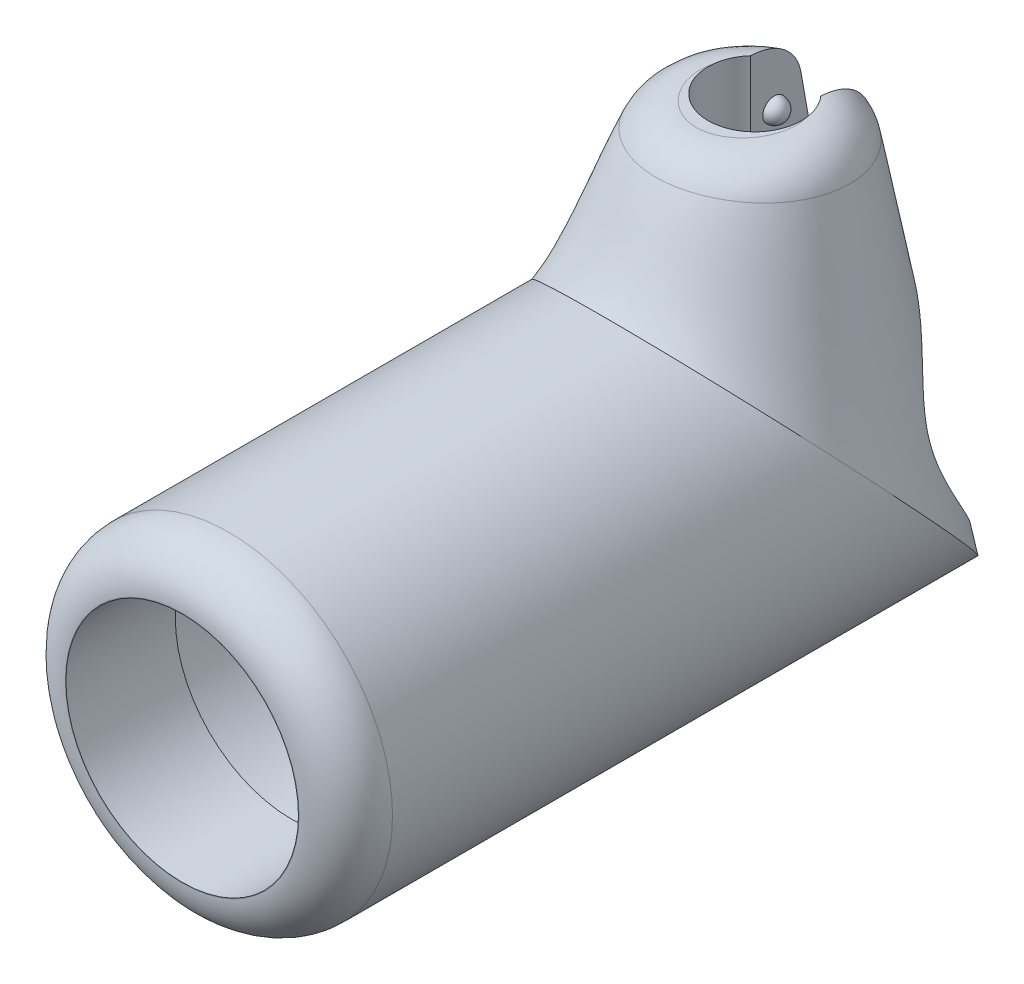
ISO-10303-21;
HEADER;
FILE_DESCRIPTION(('STEP AP214'),'2;1');
FILE_NAME('part.step','',(''),(''),'','','');
FILE_SCHEMA(('AUTOMOTIVE_DESIGN { 1 0 10303 214 1 1 1 1 }'));
ENDSEC;
DATA;
#1=APPLICATION_CONTEXT('core data for automotive mechanical design processes');
#2=APPLICATION_PROTOCOL_DEFINITION('international standard','automotive_design',2000,#1);
#3=PRODUCT_CONTEXT('',#1,'mechanical');
#4=PRODUCT('Part','Part','',(#3));
#5=PRODUCT_RELATED_PRODUCT_CATEGORY('part','',(#4));
#6=PRODUCT_DEFINITION_FORMATION('','',#4);
#7=PRODUCT_DEFINITION_CONTEXT('part definition',#1,'design');
#8=PRODUCT_DEFINITION('design','',#6,#7);
#9=PRODUCT_DEFINITION_SHAPE('','',#8);
#10=(LENGTH_UNIT() NAMED_UNIT(*) SI_UNIT(.MILLI.,.METRE.));
#11=(NAMED_UNIT(*) PLANE_ANGLE_UNIT() SI_UNIT($,.RADIAN.));
#12=(NAMED_UNIT(*) SI_UNIT($,.STERADIAN.) SOLID_ANGLE_UNIT());
#13=UNCERTAINTY_MEASURE_WITH_UNIT(LENGTH_MEASURE(1.E-05),#10,'distance_accuracy_value','');
#14=(GEOMETRIC_REPRESENTATION_CONTEXT(3) GLOBAL_UNCERTAINTY_ASSIGNED_CONTEXT((#13)) GLOBAL_UNIT_ASSIGNED_CONTEXT((#10,
#11,#12)) REPRESENTATION_CONTEXT('',''));
#15=CARTESIAN_POINT('',(0.,0.,0.));
#16=DIRECTION('',(0.,0.,1.));
#17=DIRECTION('',(1.,0.,0.));
#18=AXIS2_PLACEMENT_3D('',#15,#16,#17);
#19=CARTESIAN_POINT('',(0.,0.,-31.));
#20=DIRECTION('',(0.,0.,1.));
#21=DIRECTION('',(1.,0.,0.));
#22=AXIS2_PLACEMENT_3D('',#19,#20,#21);
#23=CYLINDRICAL_SURFACE('',#22,7.);
#24=CARTESIAN_POINT('',(0.,0.,-2.));
#25=DIRECTION('',(0.,0.,1.));
#26=DIRECTION('',(1.,0.,0.));
#27=AXIS2_PLACEMENT_3D('',#24,#25,#26);
#28=CIRCLE('',#27,7.);
#29=CARTESIAN_POINT('',(7.,0.,-2.));
#30=VERTEX_POINT('',#29);
#31=EDGE_CURVE('E268',#30,#30,#28,.F.);
#32=ORIENTED_EDGE('',*,*,#31,.T.);
#33=EDGE_LOOP('',(#32));
#34=FACE_BOUND('',#33,.T.);
#35=CARTESIAN_POINT('',(0.,-6.99999999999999,-31.));
#36=CARTESIAN_POINT('',(-0.544907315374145,-6.99999999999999,-31.));
#37=CARTESIAN_POINT('',(-1.63472194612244,-6.87037828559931,-30.8796369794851));
#38=CARTESIAN_POINT('',(-3.11194353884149,-6.3312584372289,-30.3790256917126));
#39=CARTESIAN_POINT('',(-4.35488588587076,-5.54158628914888,-29.6457586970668));
#40=CARTESIAN_POINT('',(-5.34717113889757,-4.58266272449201,-28.7553296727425));
#41=CARTESIAN_POINT('',(-6.0984118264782,-3.51479534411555,-27.7637385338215));
#42=CARTESIAN_POINT('',(-6.79672734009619,-1.99695483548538,-26.3543152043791));
#43=CARTESIAN_POINT('',(-7.13527483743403,-2.88836871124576E-06,-24.5000026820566));
#44=CARTESIAN_POINT('',(-6.79672349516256,1.99696060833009,-22.6456794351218));
#45=CARTESIAN_POINT('',(-6.09842078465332,3.51478718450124,-21.236269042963));
#46=CARTESIAN_POINT('',(-5.34714761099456,4.5826813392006,-20.2446530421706));
#47=CARTESIAN_POINT('',(-4.35493762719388,5.54154696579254,-19.3542778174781));
#48=CARTESIAN_POINT('',(-3.11184786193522,6.33133104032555,-18.6209068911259));
#49=CARTESIAN_POINT('',(-1.63416868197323,6.87024216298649,-18.1204894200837));
#50=CARTESIAN_POINT('',(0.,7.06511523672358,-17.9395358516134));
#51=CARTESIAN_POINT('',(1.63416868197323,6.8702421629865,-18.1204894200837));
#52=CARTESIAN_POINT('',(3.11184786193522,6.33133104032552,-18.6209068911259));
#53=CARTESIAN_POINT('',(4.35493762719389,5.54154696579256,-19.3542778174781));
#54=CARTESIAN_POINT('',(5.34714761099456,4.5826813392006,-20.2446530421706));
#55=CARTESIAN_POINT('',(6.09842078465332,3.51478718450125,-21.236269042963));
#56=CARTESIAN_POINT('',(6.79672349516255,1.99696060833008,-22.6456794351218));
#57=CARTESIAN_POINT('',(7.13527483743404,-2.88836869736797E-06,-24.5000026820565));
#58=CARTESIAN_POINT('',(6.7967273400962,-1.99695483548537,-26.3543152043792));
#59=CARTESIAN_POINT('',(6.0984118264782,-3.51479534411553,-27.7637385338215));
#60=CARTESIAN_POINT('',(5.34717113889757,-4.58266272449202,-28.7553296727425));
#61=CARTESIAN_POINT('',(4.35488588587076,-5.54158628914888,-29.6457586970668));
#62=CARTESIAN_POINT('',(3.11194353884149,-6.33125843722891,-30.3790256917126));
#63=CARTESIAN_POINT('',(1.63472194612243,-6.8703782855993,-30.8796369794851));
#64=CARTESIAN_POINT('',(0.544907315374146,-6.99999999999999,-31.));
#65=CARTESIAN_POINT('',(0.,-6.99999999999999,-31.));
#66=B_SPLINE_CURVE_WITH_KNOTS('',3,(#35,#36,#37,#38,#39,#40,#41,#42,#43,#44,#45,#46,#47,#48,#49,
#50,#51,#52,#53,#54,#55,#56,#57,#58,#59,#60,#61,#62,#63,#64,#65),.UNSPECIFIED.,.T.,.F.,(4,1,1,1,
1,1,1,1,1,1,1,1,1,1,1,1,1,1,1,1,1,1,1,1,1,1,1,1,4),(0.,0.03125,0.0625,0.09375,0.125,0.15625,
0.1875,0.25,0.3125,0.34375,0.375,0.40625,0.4375,0.46875,0.5,0.53125,0.5625,0.59375,0.625,
0.65625,0.6875,0.75,0.8125,0.84375,0.875,0.90625,0.9375,0.96875,1.),.UNSPECIFIED.);
#67=CARTESIAN_POINT('',(0.,-6.99999999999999,-31.));
#68=VERTEX_POINT('',#67);
#69=EDGE_CURVE('E324',#68,#68,#66,.T.);
#70=ORIENTED_EDGE('',*,*,#69,.F.);
#71=EDGE_LOOP('',(#70));
#72=FACE_BOUND('',#71,.T.);
#73=ADVANCED_FACE('F153',(#34,#72),#23,.T.);
#74=CARTESIAN_POINT('',(0.,0.,0.));
#75=DIRECTION('',(0.,0.,1.));
#76=DIRECTION('',(1.,0.,0.));
#77=AXIS2_PLACEMENT_3D('',#74,#75,#76);
#78=PLANE('',#77);
#79=CARTESIAN_POINT('',(0.,0.,0.));
#80=DIRECTION('',(0.,0.,1.));
#81=DIRECTION('',(1.,0.,0.));
#82=AXIS2_PLACEMENT_3D('',#79,#80,#81);
#83=CIRCLE('',#82,5.);
#84=CARTESIAN_POINT('',(5.,0.,0.));
#85=VERTEX_POINT('',#84);
#86=EDGE_CURVE('E271',#85,#85,#83,.T.);
#87=ORIENTED_EDGE('',*,*,#86,.T.);
#88=EDGE_LOOP('',(#87));
#89=FACE_BOUND('',#88,.T.);
#90=CARTESIAN_POINT('',(0.,0.,0.));
#91=DIRECTION('',(0.,0.,1.));
#92=DIRECTION('',(1.,0.,0.));
#93=AXIS2_PLACEMENT_3D('',#90,#91,#92);
#94=CIRCLE('',#93,4.975);
#95=CARTESIAN_POINT('',(4.975,0.,0.));
#96=VERTEX_POINT('',#95);
#97=EDGE_CURVE('E274',#96,#96,#94,.T.);
#98=ORIENTED_EDGE('',*,*,#97,.F.);
#99=EDGE_LOOP('',(#98));
#100=FACE_BOUND('',#99,.T.);
#101=ADVANCED_FACE('F305',(#89,#100),#78,.T.);
#102=CARTESIAN_POINT('',(0.,0.,-4.68));
#103=DIRECTION('',(0.,0.,1.));
#104=DIRECTION('',(1.,0.,0.));
#105=AXIS2_PLACEMENT_3D('',#102,#103,#104);
#106=CYLINDRICAL_SURFACE('',#105,4.975);
#107=CARTESIAN_POINT('',(0.,0.,-4.68));
#108=DIRECTION('',(0.,0.,1.));
#109=DIRECTION('',(1.,0.,0.));
#110=AXIS2_PLACEMENT_3D('',#107,#108,#109);
#111=CIRCLE('',#110,4.975);
#112=CARTESIAN_POINT('',(4.975,0.,-4.68));
#113=VERTEX_POINT('',#112);
#114=EDGE_CURVE('E336',#113,#113,#111,.F.);
#115=CARTESIAN_POINT('',(4.975,0.,-4.68));
#116=CARTESIAN_POINT('',(4.975,0.,-4.63125));
#117=CARTESIAN_POINT('',(4.975,0.,-4.5825));
#118=CARTESIAN_POINT('',(4.975,0.,-4.485));
#119=CARTESIAN_POINT('',(4.975,0.,-4.43625));
#120=CARTESIAN_POINT('',(4.975,0.,-4.33875));
#121=CARTESIAN_POINT('',(4.975,0.,-4.29));
#122=CARTESIAN_POINT('',(4.975,0.,-4.1925));
#123=CARTESIAN_POINT('',(4.975,0.,-4.14375));
#124=CARTESIAN_POINT('',(4.975,0.,-4.04625));
#125=CARTESIAN_POINT('',(4.975,0.,-3.9975));
#126=CARTESIAN_POINT('',(4.975,0.,-3.9));
#127=CARTESIAN_POINT('',(4.975,0.,-3.85125));
#128=CARTESIAN_POINT('',(4.975,0.,-3.75375));
#129=CARTESIAN_POINT('',(4.975,0.,-3.705));
#130=CARTESIAN_POINT('',(4.975,0.,-3.6075));
#131=CARTESIAN_POINT('',(4.975,0.,-3.55875));
#132=CARTESIAN_POINT('',(4.975,0.,-3.46125));
#133=CARTESIAN_POINT('',(4.975,0.,-3.4125));
#134=CARTESIAN_POINT('',(4.975,0.,-3.315));
#135=CARTESIAN_POINT('',(4.975,0.,-3.26625));
#136=CARTESIAN_POINT('',(4.975,0.,-3.16875));
#137=CARTESIAN_POINT('',(4.975,0.,-3.12));
#138=CARTESIAN_POINT('',(4.975,0.,-3.0225));
#139=CARTESIAN_POINT('',(4.975,0.,-2.97375));
#140=CARTESIAN_POINT('',(4.975,0.,-2.87625));
#141=CARTESIAN_POINT('',(4.975,0.,-2.8275));
#142=CARTESIAN_POINT('',(4.975,0.,-2.73));
#143=CARTESIAN_POINT('',(4.975,0.,-2.68125));
#144=CARTESIAN_POINT('',(4.975,0.,-2.58375));
#145=CARTESIAN_POINT('',(4.975,0.,-2.535));
#146=CARTESIAN_POINT('',(4.975,0.,-2.4375));
#147=CARTESIAN_POINT('',(4.975,0.,-2.38875));
#148=CARTESIAN_POINT('',(4.975,0.,-2.29125));
#149=CARTESIAN_POINT('',(4.975,0.,-2.2425));
#150=CARTESIAN_POINT('',(4.975,0.,-2.145));
#151=CARTESIAN_POINT('',(4.975,0.,-2.09625));
#152=CARTESIAN_POINT('',(4.975,0.,-1.99875));
#153=CARTESIAN_POINT('',(4.975,0.,-1.95));
#154=CARTESIAN_POINT('',(4.975,0.,-1.8525));
#155=CARTESIAN_POINT('',(4.975,0.,-1.80375));
#156=CARTESIAN_POINT('',(4.975,0.,-1.70625));
#157=CARTESIAN_POINT('',(4.975,0.,-1.6575));
#158=CARTESIAN_POINT('',(4.975,0.,-1.56));
#159=CARTESIAN_POINT('',(4.975,0.,-1.51125));
#160=CARTESIAN_POINT('',(4.975,0.,-1.41375));
#161=CARTESIAN_POINT('',(4.975,0.,-1.365));
#162=CARTESIAN_POINT('',(4.975,0.,-1.2675));
#163=CARTESIAN_POINT('',(4.975,0.,-1.21875));
#164=CARTESIAN_POINT('',(4.975,0.,-1.12125));
#165=CARTESIAN_POINT('',(4.975,0.,-1.0725));
#166=CARTESIAN_POINT('',(4.975,0.,-0.975000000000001));
#167=CARTESIAN_POINT('',(4.975,0.,-0.926250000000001));
#168=CARTESIAN_POINT('',(4.975,0.,-0.828750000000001));
#169=CARTESIAN_POINT('',(4.975,0.,-0.780000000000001));
#170=CARTESIAN_POINT('',(4.975,0.,-0.682500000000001));
#171=CARTESIAN_POINT('',(4.975,0.,-0.633750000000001));
#172=CARTESIAN_POINT('',(4.975,0.,-0.536250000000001));
#173=CARTESIAN_POINT('',(4.975,0.,-0.487500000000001));
#174=CARTESIAN_POINT('',(4.975,0.,-0.390000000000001));
#175=CARTESIAN_POINT('',(4.975,0.,-0.341250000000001));
#176=CARTESIAN_POINT('',(4.975,0.,-0.243750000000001));
#177=CARTESIAN_POINT('',(4.975,0.,-0.195000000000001));
#178=CARTESIAN_POINT('',(4.975,0.,-0.0975000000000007));
#179=CARTESIAN_POINT('',(4.975,0.,-0.0487500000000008));
#180=CARTESIAN_POINT('',(4.975,0.,0.));
#181=B_SPLINE_CURVE_WITH_KNOTS('',3,(#115,#116,#117,#118,#119,#120,#121,#122,#123,#124,#125,
#126,#127,#128,#129,#130,#131,#132,#133,#134,#135,#136,#137,#138,#139,#140,#141,#142,#143,#144,
#145,#146,#147,#148,#149,#150,#151,#152,#153,#154,#155,#156,#157,#158,#159,#160,#161,#162,#163,
#164,#165,#166,#167,#168,#169,#170,#171,#172,#173,#174,#175,#176,#177,#178,#179,#180),
.UNSPECIFIED.,.F.,.F.,(4,2,2,2,2,2,2,2,2,2,2,2,2,2,2,2,2,2,2,2,2,2,2,2,2,2,2,2,2,2,2,2,4),(0.,
0.14625,0.292499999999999,0.43875,0.585,0.731249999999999,0.877499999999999,1.02375,1.17,
1.31625,1.4625,1.60875,1.755,1.90125,2.0475,2.19375,2.34,2.48625,2.6325,2.77875,2.925,3.07125,
3.2175,3.36375,3.51,3.65625,3.8025,3.94875,4.095,4.24125,4.3875,4.53375,4.68),.UNSPECIFIED.);
#182=EDGE_CURVE('BSEAM260',#113,#96,#181,.T.);
#183=ORIENTED_EDGE('',*,*,#114,.T.);
#184=ORIENTED_EDGE('',*,*,#97,.T.);
#185=ORIENTED_EDGE('',*,*,#182,.T.);
#186=ORIENTED_EDGE('',*,*,#182,.F.);
#187=EDGE_LOOP('',(#183,#185,#184,#186));
#188=FACE_BOUND('',#187,.T.);
#189=ADVANCED_FACE('F260',(#188),#106,.F.);
#190=CARTESIAN_POINT('',(0.,12.,-28.));
#191=CARTESIAN_POINT('',(-0.229074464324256,12.,-28.));
#192=CARTESIAN_POINT('',(-0.687223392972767,12.,-27.9544797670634));
#193=CARTESIAN_POINT('',(-1.34816067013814,12.,-27.7547403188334));
#194=CARTESIAN_POINT('',(-1.95685124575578,12.,-27.4286433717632));
#195=CARTESIAN_POINT('',(-2.49107143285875,12.,-26.9910567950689));
#196=CARTESIAN_POINT('',(-2.92863371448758,12.,-26.456848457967));
#197=CARTESIAN_POINT('',(-3.36343027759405,12.,-25.6452724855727));
#198=CARTESIAN_POINT('',(-3.59124644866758,12.0000000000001,-24.4999887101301));
#199=CARTESIAN_POINT('',(-3.36343449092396,12.,-23.3547462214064));
#200=CARTESIAN_POINT('',(-2.92863026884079,12.,-22.543144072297));
#201=CARTESIAN_POINT('',(-2.4910662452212,12.,-22.0089249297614));
#202=CARTESIAN_POINT('',(-1.95685783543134,12.,-21.5713748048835));
#203=CARTESIAN_POINT('',(-1.34816897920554,12.,-21.245286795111));
#204=CARTESIAN_POINT('',(-0.687163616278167,12.,-21.0454539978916));
#205=CARTESIAN_POINT('',(0.,12.,-20.9771014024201));
#206=CARTESIAN_POINT('',(0.687163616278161,12.,-21.0454539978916));
#207=CARTESIAN_POINT('',(1.34816897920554,12.,-21.245286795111));
#208=CARTESIAN_POINT('',(1.95685783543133,12.,-21.5713748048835));
#209=CARTESIAN_POINT('',(2.49106624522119,12.,-22.0089249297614));
#210=CARTESIAN_POINT('',(2.92863026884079,12.,-22.543144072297));
#211=CARTESIAN_POINT('',(3.36343449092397,12.,-23.3547462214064));
#212=CARTESIAN_POINT('',(3.59124644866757,12.,-24.4999887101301));
#213=CARTESIAN_POINT('',(3.36343027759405,12.,-25.6452724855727));
#214=CARTESIAN_POINT('',(2.92863371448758,12.,-26.456848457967));
#215=CARTESIAN_POINT('',(2.49107143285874,12.,-26.9910567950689));
#216=CARTESIAN_POINT('',(1.95685124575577,12.,-27.4286433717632));
#217=CARTESIAN_POINT('',(1.34816067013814,12.,-27.7547403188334));
#218=CARTESIAN_POINT('',(0.687223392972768,12.,-27.9544797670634));
#219=CARTESIAN_POINT('',(0.229074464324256,12.,-28.));
#220=CARTESIAN_POINT('',(0.,12.,-28.));
#221=CARTESIAN_POINT('',(0.,5.66666666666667,-29.));
#222=CARTESIAN_POINT('',(-0.344879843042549,5.66666666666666,-29.));
#223=CARTESIAN_POINT('',(-1.03463952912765,5.71419462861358,-28.927037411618));
#224=CARTESIAN_POINT('',(-1.99488105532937,5.91187190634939,-28.6169782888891));
#225=CARTESIAN_POINT('',(-2.83613061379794,6.20141836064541,-28.1415856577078));
#226=CARTESIAN_POINT('',(-3.53830799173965,6.55302366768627,-27.5379568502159));
#227=CARTESIAN_POINT('',(-4.09088568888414,6.94457504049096,-26.8360414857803));
#228=CARTESIAN_POINT('',(-4.62230586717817,7.501116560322,-25.8052548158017));
#229=CARTESIAN_POINT('',(-4.89072352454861,8.23333227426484,-24.3999938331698));
#230=CARTESIAN_POINT('',(-4.62230712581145,8.96555222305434,-22.9947550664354));
#231=CARTESIAN_POINT('',(-4.09088679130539,9.52208863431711,-21.9639565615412));
#232=CARTESIAN_POINT('',(-3.5382960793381,9.91364982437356,-21.2620252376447));
#233=CARTESIAN_POINT('',(-2.8361537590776,10.2652338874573,-20.6584392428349));
#234=CARTESIAN_POINT('',(-1.99485123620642,10.5548213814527,-20.1830141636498));
#235=CARTESIAN_POINT('',(-1.03439880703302,10.7524221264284,-19.8729669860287));
#236=CARTESIAN_POINT('',(0.,10.8238755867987,-19.7633273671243));
#237=CARTESIAN_POINT('',(1.03439880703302,10.7524221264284,-19.8729669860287));
#238=CARTESIAN_POINT('',(1.99485123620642,10.5548213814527,-20.1830141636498));
#239=CARTESIAN_POINT('',(2.8361537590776,10.2652338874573,-20.6584392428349));
#240=CARTESIAN_POINT('',(3.5382960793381,9.91364982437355,-21.2620252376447));
#241=CARTESIAN_POINT('',(4.09088679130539,9.52208863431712,-21.9639565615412));
#242=CARTESIAN_POINT('',(4.62230712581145,8.96555222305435,-22.9947550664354));
#243=CARTESIAN_POINT('',(4.89072352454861,8.23333227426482,-24.3999938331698));
#244=CARTESIAN_POINT('',(4.62230586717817,7.50111656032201,-25.8052548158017));
#245=CARTESIAN_POINT('',(4.09088568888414,6.94457504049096,-26.8360414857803));
#246=CARTESIAN_POINT('',(3.53830799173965,6.55302366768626,-27.5379568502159));
#247=CARTESIAN_POINT('',(2.83613061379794,6.20141836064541,-28.1415856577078));
#248=CARTESIAN_POINT('',(1.99488105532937,5.91187190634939,-28.6169782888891));
#249=CARTESIAN_POINT('',(1.03463952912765,5.71419462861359,-28.927037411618));
#250=CARTESIAN_POINT('',(0.344879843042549,5.66666666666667,-29.));
#251=CARTESIAN_POINT('',(0.,5.66666666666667,-29.));
#252=CARTESIAN_POINT('',(0.,-0.666666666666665,-30.));
#253=CARTESIAN_POINT('',(-0.429101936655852,-0.666666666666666,-30.));
#254=CARTESIAN_POINT('',(-1.28730580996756,-0.584572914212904,-29.9070793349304));
#255=CARTESIAN_POINT('',(-2.46522315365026,-0.243130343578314,-29.5167877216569));
#256=CARTESIAN_POINT('',(-3.4756065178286,0.256995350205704,-28.9328164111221));
#257=CARTESIAN_POINT('',(-4.29993458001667,0.864313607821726,-28.2084296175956));
#258=CARTESIAN_POINT('',(-4.93615985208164,1.54062961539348,-27.3845455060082));
#259=CARTESIAN_POINT('',(-5.53785175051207,2.50192860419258,-26.1943328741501));
#260=CARTESIAN_POINT('',(-5.835797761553,3.7666648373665,-24.5999975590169));
#261=CARTESIAN_POINT('',(-5.53785086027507,5.0314083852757,-23.0056705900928));
#262=CARTESIAN_POINT('',(-4.93616426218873,5.99269855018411,-21.8154565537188));
#263=CARTESIAN_POINT('',(-4.29991777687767,6.66903151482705,-20.9915527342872));
#264=CARTESIAN_POINT('',(-3.47564170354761,7.27631307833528,-20.2672133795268));
#265=CARTESIAN_POINT('',(-2.46516560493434,7.77650965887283,-19.6831795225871));
#266=CARTESIAN_POINT('',(-1.28693349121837,8.11782003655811,-19.2929764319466));
#267=CARTESIAN_POINT('',(0.,8.24123964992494,-19.1533098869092));
#268=CARTESIAN_POINT('',(1.28693349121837,8.11782003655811,-19.2929764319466));
#269=CARTESIAN_POINT('',(2.46516560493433,7.77650965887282,-19.6831795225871));
#270=CARTESIAN_POINT('',(3.47564170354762,7.27631307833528,-20.2672133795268));
#271=CARTESIAN_POINT('',(4.29991777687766,6.66903151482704,-20.9915527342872));
#272=CARTESIAN_POINT('',(4.93616426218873,5.99269855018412,-21.8154565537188));
#273=CARTESIAN_POINT('',(5.53785086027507,5.03140838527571,-23.0056705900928));
#274=CARTESIAN_POINT('',(5.835797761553,3.7666648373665,-24.5999975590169));
#275=CARTESIAN_POINT('',(5.53785175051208,2.50192860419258,-26.1943328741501));
#276=CARTESIAN_POINT('',(4.93615985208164,1.54062961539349,-27.3845455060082));
#277=CARTESIAN_POINT('',(4.29993458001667,0.864313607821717,-28.2084296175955));
#278=CARTESIAN_POINT('',(3.4756065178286,0.256995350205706,-28.9328164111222));
#279=CARTESIAN_POINT('',(2.46522315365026,-0.243130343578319,-29.5167877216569));
#280=CARTESIAN_POINT('',(1.28730580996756,-0.584572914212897,-29.9070793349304));
#281=CARTESIAN_POINT('',(0.429101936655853,-0.666666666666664,-30.));
#282=CARTESIAN_POINT('',(0.,-0.666666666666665,-30.));
#283=CARTESIAN_POINT('',(0.,-7.,-31.));
#284=CARTESIAN_POINT('',(-0.544907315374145,-7.,-31.));
#285=CARTESIAN_POINT('',(-1.63472194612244,-6.87037828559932,-30.8796369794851));
#286=CARTESIAN_POINT('',(-3.11194353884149,-6.33125843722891,-30.3790256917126));
#287=CARTESIAN_POINT('',(-4.35488588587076,-5.5415862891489,-29.6457586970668));
#288=CARTESIAN_POINT('',(-5.34717113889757,-4.58266272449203,-28.7553296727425));
#289=CARTESIAN_POINT('',(-6.0984118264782,-3.51479534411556,-27.7637385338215));
#290=CARTESIAN_POINT('',(-6.79672734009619,-1.99695483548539,-26.3543152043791));
#291=CARTESIAN_POINT('',(-7.13527483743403,-2.88836872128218E-06,-24.5000026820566));
#292=CARTESIAN_POINT('',(-6.79672349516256,1.99696060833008,-22.6456794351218));
#293=CARTESIAN_POINT('',(-6.09842078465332,3.51478718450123,-21.236269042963));
#294=CARTESIAN_POINT('',(-5.34714761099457,4.58268133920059,-20.2446530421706));
#295=CARTESIAN_POINT('',(-4.35493762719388,5.54154696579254,-19.3542778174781));
#296=CARTESIAN_POINT('',(-3.11184786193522,6.33133104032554,-18.6209068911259));
#297=CARTESIAN_POINT('',(-1.63416868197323,6.87024216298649,-18.1204894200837));
#298=CARTESIAN_POINT('',(0.,7.06511523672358,-17.9395358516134));
#299=CARTESIAN_POINT('',(1.63416868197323,6.8702421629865,-18.1204894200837));
#300=CARTESIAN_POINT('',(3.11184786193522,6.33133104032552,-18.6209068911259));
#301=CARTESIAN_POINT('',(4.35493762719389,5.54154696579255,-19.3542778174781));
#302=CARTESIAN_POINT('',(5.34714761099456,4.58268133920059,-20.2446530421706));
#303=CARTESIAN_POINT('',(6.09842078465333,3.51478718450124,-21.2362690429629));
#304=CARTESIAN_POINT('',(6.79672349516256,1.99696060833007,-22.6456794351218));
#305=CARTESIAN_POINT('',(7.13527483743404,-2.88836870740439E-06,-24.5000026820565));
#306=CARTESIAN_POINT('',(6.7967273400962,-1.99695483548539,-26.3543152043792));
#307=CARTESIAN_POINT('',(6.0984118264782,-3.51479534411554,-27.7637385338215));
#308=CARTESIAN_POINT('',(5.34717113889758,-4.58266272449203,-28.7553296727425));
#309=CARTESIAN_POINT('',(4.35488588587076,-5.54158628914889,-29.6457586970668));
#310=CARTESIAN_POINT('',(3.11194353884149,-6.33125843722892,-30.3790256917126));
#311=CARTESIAN_POINT('',(1.63472194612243,-6.87037828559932,-30.8796369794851));
#312=CARTESIAN_POINT('',(0.544907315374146,-7.,-31.));
#313=CARTESIAN_POINT('',(0.,-7.,-31.));
#314=B_SPLINE_SURFACE_WITH_KNOTS('',3,3,((#190,#191,#192,#193,#194,#195,#196,#197,#198,#199,
#200,#201,#202,#203,#204,#205,#206,#207,#208,#209,#210,#211,#212,#213,#214,#215,#216,#217,#218,
#219,#220),(#221,#222,#223,#224,#225,#226,#227,#228,#229,#230,#231,#232,#233,#234,#235,#236,
#237,#238,#239,#240,#241,#242,#243,#244,#245,#246,#247,#248,#249,#250,#251),(#252,#253,#254,
#255,#256,#257,#258,#259,#260,#261,#262,#263,#264,#265,#266,#267,#268,#269,#270,#271,#272,#273,
#274,#275,#276,#277,#278,#279,#280,#281,#282),(#283,#284,#285,#286,#287,#288,#289,#290,#291,
#292,#293,#294,#295,#296,#297,#298,#299,#300,#301,#302,#303,#304,#305,#306,#307,#308,#309,#310,
#311,#312,#313)),.UNSPECIFIED.,.F.,.T.,.F.,(4,4),(4,1,1,1,1,1,1,1,1,1,1,1,1,1,1,1,1,1,1,1,1,1,1,
1,1,1,1,1,4),(0.,1.),(0.,0.03125,0.0625,0.09375,0.125,0.15625,0.1875,0.25,0.3125,0.34375,0.375,
0.40625,0.4375,0.46875,0.5,0.53125,0.5625,0.59375,0.625,0.65625,0.6875,0.75,0.8125,0.84375,
0.875,0.90625,0.9375,0.96875,1.),.UNSPECIFIED.);
#315=CARTESIAN_POINT('',(-1.5,2.,-29.4013379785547));
#316=CARTESIAN_POINT('',(-1.5,2.49548733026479,-29.319133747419));
#317=CARTESIAN_POINT('',(-1.5,2.99093695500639,-29.2367005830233));
#318=CARTESIAN_POINT('',(-1.5,3.98172816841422,-29.0711751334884));
#319=CARTESIAN_POINT('',(-1.5,4.47706975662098,-28.9880828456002));
#320=CARTESIAN_POINT('',(-1.5,5.467595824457,-28.8210406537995));
#321=CARTESIAN_POINT('',(-1.49999999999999,5.9627803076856,-28.7370907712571));
#322=CARTESIAN_POINT('',(-1.50000000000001,6.95294734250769,-28.5680114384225));
#323=CARTESIAN_POINT('',(-1.50000000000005,7.44792989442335,-28.4828819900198));
#324=CARTESIAN_POINT('',(-1.50000000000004,8.36591285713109,-28.3234062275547));
#325=CARTESIAN_POINT('',(-1.50000000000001,8.78895219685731,-28.2492845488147));
#326=CARTESIAN_POINT('',(-1.5,9.42328515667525,-28.1368140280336));
#327=CARTESIAN_POINT('',(-1.5,9.63469286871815,-28.0991089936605));
#328=CARTESIAN_POINT('',(-1.5,10.0574146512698,-28.0231754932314));
#329=CARTESIAN_POINT('',(-1.5,10.2687287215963,-27.9849470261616));
#330=CARTESIAN_POINT('',(-1.5,10.4799867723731,-27.9464098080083));
#331=B_SPLINE_CURVE_WITH_KNOTS('',3,(#315,#316,#317,#318,#319,#320,#321,#322,#323,#324,#325,
#326,#327,#328,#329,#330),.UNSPECIFIED.,.F.,.F.,(4,2,2,2,2,2,2,4),(0.,1.50678072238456,
3.01356773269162,4.52031728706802,6.02706442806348,7.31551290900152,7.95974365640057,
8.60397565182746),.UNSPECIFIED.);
#332=CARTESIAN_POINT('',(-1.5,5.91269819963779,-28.7454051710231));
#333=VERTEX_POINT('',#332);
#334=CARTESIAN_POINT('',(-1.5,10.3325708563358,-27.9732516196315));
#335=VERTEX_POINT('',#334);
#336=EDGE_CURVE('E177',#333,#335,#331,.T.);
#337=CARTESIAN_POINT('',(0.,6.1,-28.9315789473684));
#338=CARTESIAN_POINT('',(0.128112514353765,6.09999974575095,-28.9315786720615));
#339=CARTESIAN_POINT('',(0.256228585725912,6.09595705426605,-28.927469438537));
#340=CARTESIAN_POINT('',(0.511453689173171,6.07986587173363,-28.9113280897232));
#341=CARTESIAN_POINT('',(0.638562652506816,6.06781683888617,-28.899295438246));
#342=CARTESIAN_POINT('',(0.890879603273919,6.03593490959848,-28.8675509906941));
#343=CARTESIAN_POINT('',(1.01608677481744,6.01609876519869,-28.8478359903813));
#344=CARTESIAN_POINT('',(1.26369385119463,5.96900032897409,-28.8010976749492));
#345=CARTESIAN_POINT('',(1.38609378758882,5.94173812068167,-28.774074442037));
#346=CARTESIAN_POINT('',(1.62442657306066,5.88098478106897,-28.7140963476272));
#347=CARTESIAN_POINT('',(1.74044452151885,5.84766482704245,-28.6813051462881));
#348=CARTESIAN_POINT('',(1.96864050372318,5.77484300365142,-28.609880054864));
#349=CARTESIAN_POINT('',(2.08081867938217,5.73534136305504,-28.5712463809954));
#350=CARTESIAN_POINT('',(2.41109006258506,5.60822983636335,-28.4475234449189));
#351=CARTESIAN_POINT('',(2.62302245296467,5.51198666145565,-28.3545856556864));
#352=CARTESIAN_POINT('',(2.98518568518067,5.32269619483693,-28.1747102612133));
#353=CARTESIAN_POINT('',(3.13892131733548,5.23336425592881,-28.0907374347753));
#354=CARTESIAN_POINT('',(3.43519887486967,5.04384079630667,-27.9153867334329));
#355=CARTESIAN_POINT('',(3.57773475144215,4.94364347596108,-27.8240049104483));
#356=CARTESIAN_POINT('',(3.85210004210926,4.73300653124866,-27.635927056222));
#357=CARTESIAN_POINT('',(3.98389492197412,4.62253613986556,-27.5392154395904));
#358=CARTESIAN_POINT('',(4.23669462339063,4.39200253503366,-27.3432980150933));
#359=CARTESIAN_POINT('',(4.35770275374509,4.27194228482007,-27.2440929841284));
#360=CARTESIAN_POINT('',(4.5641500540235,4.0492314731,-27.0677642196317));
#361=CARTESIAN_POINT('',(4.65158853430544,3.94849932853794,-26.9905462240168));
#362=CARTESIAN_POINT('',(4.82041512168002,3.74052835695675,-26.8381648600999));
#363=CARTESIAN_POINT('',(4.90180155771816,3.63328774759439,-26.7630020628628));
#364=CARTESIAN_POINT('',(5.05836412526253,3.41193047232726,-26.6173452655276));
#365=CARTESIAN_POINT('',(5.13355844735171,3.29783578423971,-26.5468377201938));
#366=CARTESIAN_POINT('',(5.27782438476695,3.06165377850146,-26.4135589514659));
#367=CARTESIAN_POINT('',(5.34690133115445,2.93957358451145,-26.3507809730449));
#368=CARTESIAN_POINT('',(5.48565835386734,2.67254488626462,-26.2311497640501));
#369=CARTESIAN_POINT('',(5.55459398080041,2.52655150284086,-26.1756739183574));
#370=CARTESIAN_POINT('',(5.65048471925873,2.29972796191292,-26.1092490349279));
#371=CARTESIAN_POINT('',(5.68116651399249,2.22290342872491,-26.0899176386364));
#372=CARTESIAN_POINT('',(5.73977142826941,2.06687238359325,-26.0576438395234));
#373=CARTESIAN_POINT('',(5.76769472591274,1.98766602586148,-26.0447010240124));
#374=CARTESIAN_POINT('',(5.82071694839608,1.82661182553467,-26.0257459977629));
#375=CARTESIAN_POINT('',(5.8457853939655,1.74474566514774,-26.0198032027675));
#376=CARTESIAN_POINT('',(5.89249050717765,1.5798413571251,-26.0153456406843));
#377=CARTESIAN_POINT('',(5.91412724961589,1.49680323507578,-26.01683071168));
#378=CARTESIAN_POINT('',(5.95381928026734,1.33018194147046,-26.0270632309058));
#379=CARTESIAN_POINT('',(5.97186853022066,1.24659809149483,-26.035822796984));
#380=CARTESIAN_POINT('',(6.00428878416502,1.0796985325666,-26.0600677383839));
#381=CARTESIAN_POINT('',(6.0186590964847,0.996382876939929,-26.0755543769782));
#382=CARTESIAN_POINT('',(6.04706390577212,0.808834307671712,-26.1173104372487));
#383=CARTESIAN_POINT('',(6.06002663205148,0.704832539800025,-26.1453409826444));
#384=CARTESIAN_POINT('',(6.08046899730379,0.498648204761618,-26.2091769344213));
#385=CARTESIAN_POINT('',(6.08794369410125,0.396467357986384,-26.2449893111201));
#386=CARTESIAN_POINT('',(6.09775953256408,0.193987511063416,-26.3228808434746));
#387=CARTESIAN_POINT('',(6.10008694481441,0.0936942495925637,-26.3649764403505));
#388=CARTESIAN_POINT('',(6.09990813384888,-0.104652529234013,-26.4540050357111));
#389=CARTESIAN_POINT('',(6.09740316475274,-0.202706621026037,-26.5009367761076));
#390=CARTESIAN_POINT('',(6.08406240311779,-0.473983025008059,-26.6374483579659));
#391=CARTESIAN_POINT('',(6.06817968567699,-0.6448587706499,-26.7312188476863));
#392=CARTESIAN_POINT('',(6.02307206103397,-0.980450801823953,-26.9263152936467));
#393=CARTESIAN_POINT('',(5.99383697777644,-1.14516228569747,-27.0276469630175));
#394=CARTESIAN_POINT('',(5.9227791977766,-1.46907927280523,-27.2349245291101));
#395=CARTESIAN_POINT('',(5.88094402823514,-1.62827914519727,-27.3408749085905));
#396=CARTESIAN_POINT('',(5.78517392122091,-1.94127152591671,-27.5551304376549));
#397=CARTESIAN_POINT('',(5.73124219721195,-2.09506545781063,-27.6634349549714));
#398=CARTESIAN_POINT('',(5.6065725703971,-2.40983578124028,-27.889779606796));
#399=CARTESIAN_POINT('',(5.53481666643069,-2.57036126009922,-28.0078872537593));
#400=CARTESIAN_POINT('',(5.37747347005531,-2.88508775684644,-28.2433629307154));
#401=CARTESIAN_POINT('',(5.29188421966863,-3.03928787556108,-28.3607308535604));
#402=CARTESIAN_POINT('',(5.10691681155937,-3.34075422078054,-28.5932056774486));
#403=CARTESIAN_POINT('',(5.00755054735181,-3.48802628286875,-28.708314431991));
#404=CARTESIAN_POINT('',(4.79490901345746,-3.77501623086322,-28.9349295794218));
#405=CARTESIAN_POINT('',(4.68163595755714,-3.91473531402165,-29.0464365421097));
#406=CARTESIAN_POINT('',(4.35057570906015,-4.28756012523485,-29.3462992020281));
#407=CARTESIAN_POINT('',(4.11812831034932,-4.51209732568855,-29.5295559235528));
#408=CARTESIAN_POINT('',(3.60999535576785,-4.92803534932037,-29.8720653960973));
#409=CARTESIAN_POINT('',(3.33435933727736,-5.11947361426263,-30.0313452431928));
#410=CARTESIAN_POINT('',(2.79952464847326,-5.42661515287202,-30.2882804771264));
#411=CARTESIAN_POINT('',(2.54757590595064,-5.54980698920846,-30.3918961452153));
#412=CARTESIAN_POINT('',(2.15261037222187,-5.70933451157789,-30.5265936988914));
#413=CARTESIAN_POINT('',(2.01809467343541,-5.75830542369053,-30.5680429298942));
#414=CARTESIAN_POINT('',(1.74397224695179,-5.84716106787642,-30.6432974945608));
#415=CARTESIAN_POINT('',(1.60436555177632,-5.88704585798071,-30.677102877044));
#416=CARTESIAN_POINT('',(1.32000415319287,-5.95728033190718,-30.7365929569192));
#417=CARTESIAN_POINT('',(1.17522045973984,-5.98756196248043,-30.7622197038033));
#418=CARTESIAN_POINT('',(0.882566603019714,-6.03764125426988,-30.8046749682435));
#419=CARTESIAN_POINT('',(0.734696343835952,-6.05743858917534,-30.8215032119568));
#420=CARTESIAN_POINT('',(0.43719886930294,-6.08614661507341,-30.845990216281));
#421=CARTESIAN_POINT('',(0.287572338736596,-6.09506141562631,-30.8536524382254));
#422=CARTESIAN_POINT('',(-0.0121054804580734,-6.10182827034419,-30.8594555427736));
#423=CARTESIAN_POINT('',(-0.162156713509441,-6.09968171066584,-30.8575976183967));
#424=CARTESIAN_POINT('',(-0.444421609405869,-6.08524111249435,-30.8452291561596));
#425=CARTESIAN_POINT('',(-0.576741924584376,-6.07411649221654,-30.8357161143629));
#426=CARTESIAN_POINT('',(-0.83967056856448,-6.04338224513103,-30.8095563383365));
#427=CARTESIAN_POINT('',(-0.970279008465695,-6.02377317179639,-30.7929100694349));
#428=CARTESIAN_POINT('',(-1.22891573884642,-5.97637442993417,-30.7527459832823));
#429=CARTESIAN_POINT('',(-1.35694415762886,-5.94858516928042,-30.7292285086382));
#430=CARTESIAN_POINT('',(-1.60964106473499,-5.8852380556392,-30.6755734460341));
#431=CARTESIAN_POINT('',(-1.73430947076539,-5.84968001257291,-30.6454356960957));
#432=CARTESIAN_POINT('',(-1.9819980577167,-5.77052069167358,-30.5783854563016));
#433=CARTESIAN_POINT('',(-2.10494085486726,-5.72677832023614,-30.5413541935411));
#434=CARTESIAN_POINT('',(-2.34612938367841,-5.63226977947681,-30.4615052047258));
#435=CARTESIAN_POINT('',(-2.46437510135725,-5.58150358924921,-30.4186874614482));
#436=CARTESIAN_POINT('',(-2.81151374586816,-5.41946290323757,-30.2823259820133));
#437=CARTESIAN_POINT('',(-3.03281976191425,-5.29844251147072,-30.1808707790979));
#438=CARTESIAN_POINT('',(-3.54570784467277,-4.97652648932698,-29.9124268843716));
#439=CARTESIAN_POINT('',(-3.82520450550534,-4.76395008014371,-29.7362761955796));
#440=CARTESIAN_POINT('',(-4.20783331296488,-4.4196989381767,-29.4544864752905));
#441=CARTESIAN_POINT('',(-4.32939534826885,-4.30056176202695,-29.3575043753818));
#442=CARTESIAN_POINT('',(-4.56044793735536,-4.05471718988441,-29.1587909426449));
#443=CARTESIAN_POINT('',(-4.66993963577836,-3.928010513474,-29.0570600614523));
#444=CARTESIAN_POINT('',(-4.87861483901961,-3.66574453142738,-28.848350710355));
#445=CARTESIAN_POINT('',(-4.97759753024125,-3.53007334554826,-28.7413132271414));
#446=CARTESIAN_POINT('',(-5.16328753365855,-3.25243726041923,-28.5247701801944));
#447=CARTESIAN_POINT('',(-5.24999401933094,-3.11047193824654,-28.4152644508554));
#448=CARTESIAN_POINT('',(-5.41121167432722,-2.82069094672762,-28.1948849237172));
#449=CARTESIAN_POINT('',(-5.48571753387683,-2.67287276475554,-28.0840105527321));
#450=CARTESIAN_POINT('',(-5.62247521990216,-2.37173363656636,-27.8622120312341));
#451=CARTESIAN_POINT('',(-5.68472845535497,-2.21841332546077,-27.7512878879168));
#452=CARTESIAN_POINT('',(-5.7918884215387,-1.9201227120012,-27.5406398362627));
#453=CARTESIAN_POINT('',(-5.83784285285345,-1.77561462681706,-27.4407936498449));
#454=CARTESIAN_POINT('',(-5.91922955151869,-1.48187650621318,-27.2436756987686));
#455=CARTESIAN_POINT('',(-5.95465933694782,-1.33264536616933,-27.1464045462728));
#456=CARTESIAN_POINT('',(-6.01449439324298,-1.02942131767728,-26.956496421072));
#457=CARTESIAN_POINT('',(-6.0389169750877,-0.875436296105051,-26.863852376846));
#458=CARTESIAN_POINT('',(-6.07609858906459,-0.562060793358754,-26.6856986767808));
#459=CARTESIAN_POINT('',(-6.08886601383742,-0.402674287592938,-26.6001839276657));
#460=CARTESIAN_POINT('',(-6.09864918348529,-0.154427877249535,-26.4778359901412));
#461=CARTESIAN_POINT('',(-6.10025122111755,-0.0676996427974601,-26.4370409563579));
#462=CARTESIAN_POINT('',(-6.09968405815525,0.1074385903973,-26.3593136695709));
#463=CARTESIAN_POINT('',(-6.09751465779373,0.195848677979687,-26.3223816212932));
#464=CARTESIAN_POINT('',(-6.0849802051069,0.463435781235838,-26.2188304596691));
#465=CARTESIAN_POINT('',(-6.06860623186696,0.64535356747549,-26.1592590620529));
#466=CARTESIAN_POINT('',(-6.03285469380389,0.905895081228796,-26.0948605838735));
#467=CARTESIAN_POINT('',(-6.0208253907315,0.982750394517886,-26.0783865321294));
#468=CARTESIAN_POINT('',(-5.99363195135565,1.13687570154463,-26.050939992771));
#469=CARTESIAN_POINT('',(-5.97846939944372,1.21414546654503,-26.0399647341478));
#470=CARTESIAN_POINT('',(-5.94502949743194,1.36852254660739,-26.0240545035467));
#471=CARTESIAN_POINT('',(-5.9267566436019,1.44562993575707,-26.0191108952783));
#472=CARTESIAN_POINT('',(-5.88717295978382,1.59921280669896,-26.0155399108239));
#473=CARTESIAN_POINT('',(-5.86586216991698,1.67568829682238,-26.0169124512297));
#474=CARTESIAN_POINT('',(-5.82038787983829,1.82739031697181,-26.0259728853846));
#475=CARTESIAN_POINT('',(-5.79622480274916,1.90261703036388,-26.0336598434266));
#476=CARTESIAN_POINT('',(-5.74528715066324,2.05130530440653,-26.055029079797));
#477=CARTESIAN_POINT('',(-5.71851247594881,2.1247667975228,-26.0687115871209));
#478=CARTESIAN_POINT('',(-5.66256981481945,2.2696576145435,-26.1015264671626));
#479=CARTESIAN_POINT('',(-5.63339801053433,2.34108344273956,-26.1206676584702));
#480=CARTESIAN_POINT('',(-5.57293276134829,2.48158704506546,-26.1636770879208));
#481=CARTESIAN_POINT('',(-5.54163849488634,2.5506638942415,-26.1875471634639));
#482=CARTESIAN_POINT('',(-5.45332406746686,2.7364787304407,-26.2583316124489));
#483=CARTESIAN_POINT('',(-5.39436131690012,2.8507713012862,-26.3092526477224));
#484=CARTESIAN_POINT('',(-5.27129576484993,3.07238318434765,-26.419391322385));
#485=CARTESIAN_POINT('',(-5.20718846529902,3.17969624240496,-26.4786162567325));
#486=CARTESIAN_POINT('',(-5.07381916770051,3.38847567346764,-26.6027030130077));
#487=CARTESIAN_POINT('',(-5.00453482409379,3.48991289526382,-26.6675895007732));
#488=CARTESIAN_POINT('',(-4.86112163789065,3.6870518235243,-26.8005351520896));
#489=CARTESIAN_POINT('',(-4.78699378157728,3.7827546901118,-26.8685936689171));
#490=CARTESIAN_POINT('',(-4.64927975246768,3.95011924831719,-26.9923250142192));
#491=CARTESIAN_POINT('',(-4.58659213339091,4.02272973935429,-27.0477201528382));
#492=CARTESIAN_POINT('',(-4.45799357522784,4.16478938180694,-27.1588261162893));
#493=CARTESIAN_POINT('',(-4.39208236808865,4.23423826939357,-27.2145369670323));
#494=CARTESIAN_POINT('',(-4.18932361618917,4.43805669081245,-27.3813142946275));
#495=CARTESIAN_POINT('',(-4.04748608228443,4.56785528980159,-27.4919931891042));
#496=CARTESIAN_POINT('',(-3.75040428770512,4.81472997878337,-27.7079855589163));
#497=CARTESIAN_POINT('',(-3.59520539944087,4.93184629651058,-27.8133154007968));
#498=CARTESIAN_POINT('',(-3.27061718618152,5.15281930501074,-28.015603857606));
#499=CARTESIAN_POINT('',(-3.10123833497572,5.25668564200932,-28.1125685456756));
#500=CARTESIAN_POINT('',(-2.81127587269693,5.41511435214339,-28.2623648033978));
#501=CARTESIAN_POINT('',(-2.69482277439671,5.47405323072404,-28.3186066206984));
#502=CARTESIAN_POINT('',(-2.45620632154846,5.58519173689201,-28.4253904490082));
#503=CARTESIAN_POINT('',(-2.33404351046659,5.6373920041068,-28.4759330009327));
#504=CARTESIAN_POINT('',(-2.08442798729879,5.73437609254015,-28.5702842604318));
#505=CARTESIAN_POINT('',(-1.95698051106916,5.77916704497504,-28.614099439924));
#506=CARTESIAN_POINT('',(-1.69721288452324,5.86071571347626,-28.6941295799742));
#507=CARTESIAN_POINT('',(-1.56489338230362,5.89747449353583,-28.7303455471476));
#508=CARTESIAN_POINT('',(-1.31552847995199,5.95763260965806,-28.7898149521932));
#509=CARTESIAN_POINT('',(-1.19902851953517,5.98219361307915,-28.8141841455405));
#510=CARTESIAN_POINT('',(-0.963627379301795,6.02459277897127,-28.8562831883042));
#511=CARTESIAN_POINT('',(-0.844726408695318,6.04243152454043,-28.8740136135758));
#512=CARTESIAN_POINT('',(-0.605287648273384,6.07109229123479,-28.9025613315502));
#513=CARTESIAN_POINT('',(-0.484750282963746,6.08191609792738,-28.9133803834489));
#514=CARTESIAN_POINT('',(-0.242809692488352,6.09637017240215,-28.9278894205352));
#515=CARTESIAN_POINT('',(-0.121406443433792,6.10000024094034,-28.9315792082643));
#516=CARTESIAN_POINT('',(0.,6.1,-28.9315789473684));
#517=B_SPLINE_CURVE_WITH_KNOTS('',3,(#337,#338,#339,#340,#341,#342,#343,#344,#345,#346,#347,
#348,#349,#350,#351,#352,#353,#354,#355,#356,#357,#358,#359,#360,#361,#362,#363,#364,#365,#366,
#367,#368,#369,#370,#371,#372,#373,#374,#375,#376,#377,#378,#379,#380,#381,#382,#383,#384,#385,
#386,#387,#388,#389,#390,#391,#392,#393,#394,#395,#396,#397,#398,#399,#400,#401,#402,#403,#404,
#405,#406,#407,#408,#409,#410,#411,#412,#413,#414,#415,#416,#417,#418,#419,#420,#421,#422,#423,
#424,#425,#426,#427,#428,#429,#430,#431,#432,#433,#434,#435,#436,#437,#438,#439,#440,#441,#442,
#443,#444,#445,#446,#447,#448,#449,#450,#451,#452,#453,#454,#455,#456,#457,#458,#459,#460,#461,
#462,#463,#464,#465,#466,#467,#468,#469,#470,#471,#472,#473,#474,#475,#476,#477,#478,#479,#480,
#481,#482,#483,#484,#485,#486,#487,#488,#489,#490,#491,#492,#493,#494,#495,#496,#497,#498,#499,
#500,#501,#502,#503,#504,#505,#506,#507,#508,#509,#510,#511,#512,#513,#514,#515,#516),
.UNSPECIFIED.,.T.,.F.,(4,2,2,2,2,2,2,2,2,2,2,2,2,2,2,2,2,2,2,2,2,2,2,2,2,2,2,2,2,2,2,2,2,2,2,2,
2,2,2,2,2,2,2,2,2,2,2,2,2,2,2,2,2,2,2,2,2,2,2,2,2,2,2,2,2,2,2,2,2,2,2,2,2,2,2,2,2,2,2,2,2,2,2,2,
2,2,2,2,2,4),(0.,0.384220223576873,0.768466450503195,1.15287311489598,1.53727545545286,
1.91214803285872,2.28700674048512,3.03640003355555,3.62558656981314,4.21508915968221,
4.80641790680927,5.39756463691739,5.85970636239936,6.32197522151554,6.78283365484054,
7.24328643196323,7.75359253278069,8.00818549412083,8.26276200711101,8.51984232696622,
8.77691704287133,9.03442085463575,9.2919730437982,9.61691712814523,9.94215347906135,
10.2682562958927,10.5942744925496,11.1800117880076,11.7661962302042,12.3529628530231,
12.9395737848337,13.5744737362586,14.2094636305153,14.843908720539,15.4782529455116,
16.5884455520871,17.6973739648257,18.5903763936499,19.0370032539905,19.4836272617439,
19.9333490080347,20.3830847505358,20.8326506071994,21.2821601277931,21.6810719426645,
22.0799577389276,22.47882364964,22.8776993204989,23.2842197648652,23.6907414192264,
24.5037472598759,25.6755315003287,26.2628119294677,26.8500366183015,27.4469892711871,
28.0439820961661,28.6412340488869,29.2384172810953,29.7827386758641,30.3271883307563,
30.8707787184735,31.4139773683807,31.7013892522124,31.9888163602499,32.5623822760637,
32.8007337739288,33.0389650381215,33.2768547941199,33.514741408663,33.752592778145,
33.9904532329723,34.2287001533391,34.4670398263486,34.881261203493,35.2958487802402,
35.7123425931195,36.1287518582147,36.4609765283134,36.7932288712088,37.4579252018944,
38.1204472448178,38.7824841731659,39.2085115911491,39.6344985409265,40.0600730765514,
40.4855912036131,40.849813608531,41.2140044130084,41.5781024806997,41.9422106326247),.UNSPECIFIED.);
#518=CARTESIAN_POINT('',(1.5,5.91269819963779,-28.7454051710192));
#519=VERTEX_POINT('',#518);
#520=EDGE_CURVE('E215',#519,#333,#517,.T.);
#521=CARTESIAN_POINT('',(1.49999999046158,10.4799867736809,-27.9464098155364));
#522=CARTESIAN_POINT('',(1.49999999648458,10.2329223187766,-27.9914762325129));
#523=CARTESIAN_POINT('',(1.49999999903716,9.98578199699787,-28.0361239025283));
#524=CARTESIAN_POINT('',(1.50000000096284,9.49137751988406,-28.1247249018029));
#525=CARTESIAN_POINT('',(1.50000000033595,9.24411336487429,-28.1686782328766));
#526=CARTESIAN_POINT('',(1.49999999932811,8.50217882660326,-28.2997111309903));
#527=CARTESIAN_POINT('',(1.49999999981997,8.00736260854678,-28.3859642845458));
#528=CARTESIAN_POINT('',(1.50000000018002,7.017478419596,-28.5569682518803));
#529=CARTESIAN_POINT('',(1.50000000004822,6.52241045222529,-28.6417190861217));
#530=CARTESIAN_POINT('',(1.49999999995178,5.53209093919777,-28.810146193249));
#531=CARTESIAN_POINT('',(1.49999999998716,5.03683939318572,-28.8938224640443));
#532=CARTESIAN_POINT('',(1.50000000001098,4.11801961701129,-29.0483094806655));
#533=CARTESIAN_POINT('',(1.50000000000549,3.69446923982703,-29.119226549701));
#534=CARTESIAN_POINT('',(1.49999999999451,2.84728876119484,-29.2605993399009));
#535=CARTESIAN_POINT('',(1.49999999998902,2.42365865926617,-29.3310550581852));
#536=CARTESIAN_POINT('',(1.5,2.,-29.4013379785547));
#537=B_SPLINE_CURVE_WITH_KNOTS('',3,(#521,#522,#523,#524,#525,#526,#527,#528,#529,#530,#531,
#532,#533,#534,#535,#536),.UNSPECIFIED.,.F.,.F.,(4,2,2,2,2,2,2,4),(0.,0.753422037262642,
1.50684210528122,3.01367077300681,4.52047890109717,6.02728996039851,7.31562870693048,
8.60397548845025),.UNSPECIFIED.);
#538=CARTESIAN_POINT('',(1.49999999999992,10.3325708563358,-27.9732516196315));
#539=VERTEX_POINT('',#538);
#540=EDGE_CURVE('E201',#539,#519,#537,.T.);
#541=CARTESIAN_POINT('',(0.533156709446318,10.3144626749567,-28.2305471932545));
#542=CARTESIAN_POINT('',(0.497599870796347,12.,-27.9645560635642));
#543=CARTESIAN_POINT('',(0.271456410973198,12.,-26.2728377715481));
#544=CARTESIAN_POINT('',(0.477550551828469,10.3139286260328,-28.2380656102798));
#545=CARTESIAN_POINT('',(0.445723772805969,12.,-27.9719616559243));
#546=CARTESIAN_POINT('',(0.242963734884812,12.,-26.2766464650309));
#547=CARTESIAN_POINT('',(0.421775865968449,10.3134779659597,-28.2444188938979));
#548=CARTESIAN_POINT('',(0.393674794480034,12.,-27.9782201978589));
#549=CARTESIAN_POINT('',(0.214391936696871,12.,-26.2798634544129));
#550=CARTESIAN_POINT('',(0.30980536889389,10.3127454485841,-28.2547830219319));
#551=CARTESIAN_POINT('',(0.289160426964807,12.,-27.9884292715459));
#552=CARTESIAN_POINT('',(0.157139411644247,12.,-26.2851030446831));
#553=CARTESIAN_POINT('',(0.253609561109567,10.3124635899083,-28.2587938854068));
#554=CARTESIAN_POINT('',(0.236698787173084,12.,-27.9923790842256));
#555=CARTESIAN_POINT('',(0.128458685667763,12.,-26.2871256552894));
#556=CARTESIAN_POINT('',(0.140678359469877,10.3120699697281,-28.2644311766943));
#557=CARTESIAN_POINT('',(0.131278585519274,12.,-27.9979283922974));
#558=CARTESIAN_POINT('',(0.071038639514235,12.,-26.2899602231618));
#559=CARTESIAN_POINT('',(0.0839430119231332,10.3119581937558,-28.2660578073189));
#560=CARTESIAN_POINT('',(0.0783238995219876,12.,-27.9995276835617));
#561=CARTESIAN_POINT('',(0.042299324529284,12.,-26.2907722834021));
#562=CARTESIAN_POINT('',(-0.00158346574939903,10.3119180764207,-28.2666401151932));
#563=CARTESIAN_POINT('',(-0.00147960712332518,12.,-28.0001003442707));
#564=CARTESIAN_POINT('',(-0.000813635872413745,12.,-26.291063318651));
#565=CARTESIAN_POINT('',(-0.0301631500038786,10.3119259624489,-28.2665246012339));
#566=CARTESIAN_POINT('',(-0.0281423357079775,12.,-27.9999868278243));
#567=CARTESIAN_POINT('',(-0.0151854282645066,12.,-26.2910058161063));
#568=CARTESIAN_POINT('',(-0.0871168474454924,10.3119842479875,-28.2656783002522));
#569=CARTESIAN_POINT('',(-0.0812884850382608,12.,-27.9991545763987));
#570=CARTESIAN_POINT('',(-0.0439253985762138,12.,-26.2905829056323));
#571=CARTESIAN_POINT('',(-0.115490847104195,10.3120346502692,-28.2649474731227));
#572=CARTESIAN_POINT('',(-0.107771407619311,12.,-27.9984358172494));
#573=CARTESIAN_POINT('',(-0.0582935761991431,12.,-26.2902174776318));
#574=CARTESIAN_POINT('',(-0.200412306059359,10.3122496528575,-28.2618524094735));
#575=CARTESIAN_POINT('',(-0.187038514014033,12.,-27.9953901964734));
#576=CARTESIAN_POINT('',(-0.101378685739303,12.,-26.2886647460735));
#577=CARTESIAN_POINT('',(-0.256767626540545,10.312478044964,-28.2585856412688));
#578=CARTESIAN_POINT('',(-0.239648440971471,12.,-27.992174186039));
#579=CARTESIAN_POINT('',(-0.130080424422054,12.,-26.2870210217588));
#580=CARTESIAN_POINT('',(-0.369012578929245,10.3131042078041,-28.2497001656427));
#581=CARTESIAN_POINT('',(-0.344427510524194,12.,-27.9834226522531));
#582=CARTESIAN_POINT('',(-0.187389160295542,12.,-26.2825351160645));
#583=CARTESIAN_POINT('',(-0.424902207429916,10.3135019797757,-28.2440814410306));
#584=CARTESIAN_POINT('',(-0.396592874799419,12.,-27.9778877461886));
#585=CARTESIAN_POINT('',(-0.215996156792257,12.,-26.2796929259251));
#586=CARTESIAN_POINT('',(-0.536311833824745,10.3144646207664,-28.230516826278));
#587=CARTESIAN_POINT('',(-0.500545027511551,12.,-27.9645263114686));
#588=CARTESIAN_POINT('',(-0.273071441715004,12.,-26.2728222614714));
#589=CARTESIAN_POINT('',(-0.591831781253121,10.3150295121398,-28.2225706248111));
#590=CARTESIAN_POINT('',(-0.552328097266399,12.,-27.9567004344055));
#591=CARTESIAN_POINT('',(-0.301539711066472,12.,-26.2687936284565));
#592=CARTESIAN_POINT('',(-0.702686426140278,10.3163251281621,-28.2043103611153));
#593=CARTESIAN_POINT('',(-0.655652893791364,12.,-27.9387280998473));
#594=CARTESIAN_POINT('',(-0.358283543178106,12.,-26.2595551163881));
#595=CARTESIAN_POINT('',(-0.758021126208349,10.3170558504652,-28.193996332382));
#596=CARTESIAN_POINT('',(-0.707190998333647,12.,-27.9285829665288));
#597=CARTESIAN_POINT('',(-0.386559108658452,12.,-26.2543452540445));
#598=CARTESIAN_POINT('',(-0.868401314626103,10.3186740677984,-28.1709950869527));
#599=CARTESIAN_POINT('',(-0.809931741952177,12.,-27.9059771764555));
#600=CARTESIAN_POINT('',(-0.442982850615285,12.,-26.2427230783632));
#601=CARTESIAN_POINT('',(-0.923444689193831,10.3195621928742,-28.1582983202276));
#602=CARTESIAN_POINT('',(-0.861128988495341,12.,-27.8935087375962));
#603=CARTESIAN_POINT('',(-0.471130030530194,12.,-26.2363059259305));
#604=CARTESIAN_POINT('',(-1.03295333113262,10.3214994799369,-28.1305807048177));
#605=CARTESIAN_POINT('',(-0.962902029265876,12.,-27.8663066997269));
#606=CARTESIAN_POINT('',(-0.527131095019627,12.,-26.2222971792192));
#607=CARTESIAN_POINT('',(-1.08741858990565,10.3225486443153,-28.115559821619));
#608=CARTESIAN_POINT('',(-1.01347455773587,12.,-27.8515749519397));
#609=CARTESIAN_POINT('',(-0.554984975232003,12.,-26.2147055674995));
#610=CARTESIAN_POINT('',(-1.19581398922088,10.3248165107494,-28.083162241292));
#611=CARTESIAN_POINT('',(-1.11401268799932,12.,-27.8198230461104));
#612=CARTESIAN_POINT('',(-0.610344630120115,12.,-26.198357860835));
#613=CARTESIAN_POINT('',(-1.24974420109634,10.3260351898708,-28.0657858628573));
#614=CARTESIAN_POINT('',(-1.16397500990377,12.,-27.8028054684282));
#615=CARTESIAN_POINT('',(-0.63785045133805,12.,-26.1896019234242));
#616=CARTESIAN_POINT('',(-1.35707176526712,10.3286495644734,-28.028637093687));
#617=CARTESIAN_POINT('',(-1.26327255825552,12.,-27.7664533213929));
#618=CARTESIAN_POINT('',(-0.692466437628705,12.,-26.1709305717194));
#619=CARTESIAN_POINT('',(-1.41046912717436,10.3300452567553,-28.0088647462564));
#620=CARTESIAN_POINT('',(-1.31260439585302,12.,-27.7471214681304));
#621=CARTESIAN_POINT('',(-0.719576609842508,12.,-26.1610151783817));
#622=CARTESIAN_POINT('',(-1.49025472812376,10.332282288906,-27.9773140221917));
#623=CARTESIAN_POINT('',(-1.3862002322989,12.,-27.7163017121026));
#624=CARTESIAN_POINT('',(-0.759901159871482,12.,-26.1452739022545));
#625=CARTESIAN_POINT('',(-1.51679904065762,10.3330519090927,-27.9664813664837));
#626=CARTESIAN_POINT('',(-1.41065940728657,12.,-27.7057274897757));
#627=CARTESIAN_POINT('',(-0.77328631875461,12.,-26.1398819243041));
#628=CARTESIAN_POINT('',(-1.56955055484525,10.3346275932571,-27.9442776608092));
#629=CARTESIAN_POINT('',(-1.45923966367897,12.,-27.6840625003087));
#630=CARTESIAN_POINT('',(-0.799936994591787,12.,-26.1288099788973));
#631=CARTESIAN_POINT('',(-1.59575775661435,10.3354336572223,-27.9329066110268));
#632=CARTESIAN_POINT('',(-1.48336048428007,12.,-27.6729720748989));
#633=CARTESIAN_POINT('',(-0.813202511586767,12.,-26.1231300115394));
#634=CARTESIAN_POINT('',(-1.6738805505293,10.3379055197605,-27.8979998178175));
#635=CARTESIAN_POINT('',(-1.55520691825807,12.,-27.6389478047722));
#636=CARTESIAN_POINT('',(-0.852811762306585,12.,-26.105665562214));
#637=CARTESIAN_POINT('',(-1.72529975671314,10.3396250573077,-27.8736694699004));
#638=CARTESIAN_POINT('',(-1.60244261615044,12.,-27.615250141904));
#639=CARTESIAN_POINT('',(-0.878969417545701,12.,-26.0934560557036));
#640=CARTESIAN_POINT('',(-1.82681361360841,10.3432038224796,-27.8229456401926));
#641=CARTESIAN_POINT('',(-1.69556660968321,12.,-27.5658937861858));
#642=CARTESIAN_POINT('',(-0.930746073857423,12.,-26.0679370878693));
#643=CARTESIAN_POINT('',(-1.87690810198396,10.3450630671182,-27.7965519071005));
#644=CARTESIAN_POINT('',(-1.74145304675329,12.,-27.540237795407));
#645=CARTESIAN_POINT('',(-0.956365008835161,12.,-26.0546274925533));
#646=CARTESIAN_POINT('',(-1.97576937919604,10.3489196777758,-27.7417444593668));
#647=CARTESIAN_POINT('',(-1.83186415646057,12.,-27.4870201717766));
#648=CARTESIAN_POINT('',(-1.00701768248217,12.,-26.0269430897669));
#649=CARTESIAN_POINT('',(-2.02453617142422,10.3509170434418,-27.7133307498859));
#650=CARTESIAN_POINT('',(-1.876387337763,12.,-27.4594616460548));
#651=CARTESIAN_POINT('',(-1.03205142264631,12.,-26.012568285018));
#652=CARTESIAN_POINT('',(-2.16839958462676,10.3570977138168,-27.6253659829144));
#653=CARTESIAN_POINT('',(-2.00743239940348,12.,-27.3742847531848));
#654=CARTESIAN_POINT('',(-1.10596654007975,12.,-25.9680371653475));
#655=CARTESIAN_POINT('',(-2.26159506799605,10.3614884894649,-27.5628228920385));
#656=CARTESIAN_POINT('',(-2.09202739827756,12.,-27.3138494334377));
#657=CARTESIAN_POINT('',(-1.15393618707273,12.,-25.9363386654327));
#658=CARTESIAN_POINT('',(-2.39733266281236,10.3684938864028,-27.4631264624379));
#659=CARTESIAN_POINT('',(-2.21474329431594,12.,-27.2177376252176));
#660=CARTESIAN_POINT('',(-1.22375791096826,12.,-25.8858848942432));
#661=CARTESIAN_POINT('',(-2.44190483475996,10.3708990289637,-27.4289120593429));
#662=CARTESIAN_POINT('',(-2.25492276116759,12.,-27.1848177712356));
#663=CARTESIAN_POINT('',(-1.2466775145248,12.,-25.8685816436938));
#664=CARTESIAN_POINT('',(-2.52967793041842,10.3758549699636,-27.3585040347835));
#665=CARTESIAN_POINT('',(-2.33384087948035,12.,-27.1171776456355));
#666=CARTESIAN_POINT('',(-1.29177110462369,12.,-25.8330255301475));
#667=CARTESIAN_POINT('',(-2.57287885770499,10.3784057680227,-27.3223104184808));
#668=CARTESIAN_POINT('',(-2.37257868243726,12.,-27.0824612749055));
#669=CARTESIAN_POINT('',(-1.31394509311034,12.,-25.8147726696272));
#670=CARTESIAN_POINT('',(-2.65785372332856,10.3836578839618,-27.2479440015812));
#671=CARTESIAN_POINT('',(-2.44855436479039,12.,-27.0112467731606));
#672=CARTESIAN_POINT('',(-1.35750056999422,12.,-25.7773431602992));
#673=CARTESIAN_POINT('',(-2.69962762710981,10.3863592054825,-27.2097711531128));
#674=CARTESIAN_POINT('',(-2.48579153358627,12.,-26.974752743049));
#675=CARTESIAN_POINT('',(-1.37888203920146,12.,-25.7581664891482));
#676=CARTESIAN_POINT('',(-2.76121078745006,10.3905346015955,-27.1509724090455));
#677=CARTESIAN_POINT('',(-2.54051919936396,12.,-26.9186248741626));
#678=CARTESIAN_POINT('',(-1.41032162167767,12.,-25.7287284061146));
#679=CARTESIAN_POINT('',(-2.78155916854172,10.3919469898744,-27.1311159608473));
#680=CARTESIAN_POINT('',(-2.55856588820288,12.,-26.8996932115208));
#681=CARTESIAN_POINT('',(-1.42069618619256,12.,-25.718803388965));
#682=CARTESIAN_POINT('',(-2.82174420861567,10.3947968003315,-27.0910389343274));
#683=CARTESIAN_POINT('',(-2.59415725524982,12.,-26.8615091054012));
#684=CARTESIAN_POINT('',(-1.44123007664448,12.,-25.6987328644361));
#685=CARTESIAN_POINT('',(-2.84158084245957,10.3962342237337,-27.0708183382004));
#686=CARTESIAN_POINT('',(-2.61170203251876,12.,-26.8422570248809));
#687=CARTESIAN_POINT('',(-1.45138939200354,12.,-25.6885873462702));
#688=CARTESIAN_POINT('',(-2.93950260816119,10.4034828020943,-26.9688215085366));
#689=CARTESIAN_POINT('',(-2.69810807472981,12.,-26.7453036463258));
#690=CARTESIAN_POINT('',(-1.50163478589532,12.,-25.6373289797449));
#691=CARTESIAN_POINT('',(-3.01386086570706,10.4094823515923,-26.8843073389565));
#692=CARTESIAN_POINT('',(-2.76338515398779,12.,-26.6651334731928));
#693=CARTESIAN_POINT('',(-1.54009659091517,12.,-25.5945955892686));
#694=CARTESIAN_POINT('',(-3.15453979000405,10.4218483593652,-26.7100956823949));
#695=CARTESIAN_POINT('',(-2.88605976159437,12.,-26.500389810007));
#696=CARTESIAN_POINT('',(-1.613272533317,12.,-25.5061205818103));
#697=CARTESIAN_POINT('',(-3.22086796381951,10.4282144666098,-26.6204031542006));
#698=CARTESIAN_POINT('',(-2.94347561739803,12.,-26.4158440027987));
#699=CARTESIAN_POINT('',(-1.6479901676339,12.,-25.4603818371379));
#700=CARTESIAN_POINT('',(-3.34565439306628,10.4413446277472,-26.4359123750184));
#701=CARTESIAN_POINT('',(-3.0505830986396,12.,-26.2425371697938));
#702=CARTESIAN_POINT('',(-1.7135259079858,12.,-25.3661799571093));
#703=CARTESIAN_POINT('',(-3.40411287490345,10.4481086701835,-26.3411142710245));
#704=CARTESIAN_POINT('',(-3.10028755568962,12.,-26.1538008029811));
#705=CARTESIAN_POINT('',(-1.7443441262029,12.,-25.3177169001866));
#706=CARTESIAN_POINT('',(-3.4857420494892,10.4585761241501,-26.1952380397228));
#707=CARTESIAN_POINT('',(-3.1689732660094,12.,-26.0176734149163));
#708=CARTESIAN_POINT('',(-1.78746379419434,12.,-25.2432395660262));
#709=CARTESIAN_POINT('',(-3.51194527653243,10.4621193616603,-26.1459922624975));
#710=CARTESIAN_POINT('',(-3.19087106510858,12.,-25.9718403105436));
#711=CARTESIAN_POINT('',(-1.80132080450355,12.,-25.2181130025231));
#712=CARTESIAN_POINT('',(-3.56229892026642,10.4693205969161,-26.0462768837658));
#713=CARTESIAN_POINT('',(-3.23266751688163,12.,-25.8792211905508));
#714=CARTESIAN_POINT('',(-1.82797222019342,12.,-25.1672994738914));
#715=CARTESIAN_POINT('',(-3.58644936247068,10.4729785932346,-25.9958072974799));
#716=CARTESIAN_POINT('',(-3.25256820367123,12.,-25.8324385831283));
#717=CARTESIAN_POINT('',(-1.8407666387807,12.,-25.1416125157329));
#718=CARTESIAN_POINT('',(-3.62108860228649,10.4785565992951,-25.9192074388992));
#719=CARTESIAN_POINT('',(-3.28089168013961,12.,-25.7615573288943));
#720=CARTESIAN_POINT('',(-1.8591346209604,12.,-25.1026960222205));
#721=CARTESIAN_POINT('',(-3.63237084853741,10.4804311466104,-25.8935243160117));
#722=CARTESIAN_POINT('',(-3.29007353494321,12.,-25.7378257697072));
#723=CARTESIAN_POINT('',(-1.86512013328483,12.,-25.0896592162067));
#724=CARTESIAN_POINT('',(-3.65432808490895,10.4841920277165,-25.8420486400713));
#725=CARTESIAN_POINT('',(-3.30787328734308,12.,-25.6902958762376));
#726=CARTESIAN_POINT('',(-1.87681509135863,12.,-25.063462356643));
#727=CARTESIAN_POINT('',(-3.66500307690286,10.486078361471,-25.8162560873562));
#728=CARTESIAN_POINT('',(-3.3164915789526,12.,-25.6664976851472));
#729=CARTESIAN_POINT('',(-1.88252453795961,12.,-25.0503023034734));
#730=CARTESIAN_POINT('',(-3.69614778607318,10.4917587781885,-25.7386820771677));
#731=CARTESIAN_POINT('',(-3.34151609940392,12.,-25.5950054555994));
#732=CARTESIAN_POINT('',(-1.89923832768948,12.,-25.0106474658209));
#733=CARTESIAN_POINT('',(-3.71573819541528,10.495574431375,-25.6867021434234));
#734=CARTESIAN_POINT('',(-3.35711405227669,12.,-25.5471584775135));
#735=CARTESIAN_POINT('',(-1.90982862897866,12.,-24.983976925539));
#736=CARTESIAN_POINT('',(-3.75278877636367,10.5032973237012,-25.5817750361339));
#737=CARTESIAN_POINT('',(-3.38630554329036,12.,-25.4507288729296));
#738=CARTESIAN_POINT('',(-1.92999822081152,12.,-24.9299557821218));
#739=CARTESIAN_POINT('',(-3.77022593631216,10.507205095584,-25.5288233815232));
#740=CARTESIAN_POINT('',(-3.39988104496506,12.,-25.4021442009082));
#741=CARTESIAN_POINT('',(-1.93956646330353,12.,-24.9026010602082));
#742=CARTESIAN_POINT('',(-3.80278118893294,10.5150762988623,-25.4224991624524));
#743=CARTESIAN_POINT('',(-3.42488497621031,12.,-25.3047513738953));
#744=CARTESIAN_POINT('',(-1.95756532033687,12.,-24.8475215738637));
#745=CARTESIAN_POINT('',(-3.81789928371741,10.5190397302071,-25.3691265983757));
#746=CARTESIAN_POINT('',(-3.43631653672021,12.,-25.255944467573));
#747=CARTESIAN_POINT('',(-1.96599593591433,12.,-24.8197968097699));
#748=CARTESIAN_POINT('',(-3.85981878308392,10.53101658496,-25.2084281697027));
#749=CARTESIAN_POINT('',(-3.46741753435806,12.,-25.109362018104));
#750=CARTESIAN_POINT('',(-1.98957333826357,12.,-24.7361388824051));
#751=CARTESIAN_POINT('',(-3.88319100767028,10.5391177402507,-25.1005056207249));
#752=CARTESIAN_POINT('',(-3.4839657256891,12.,-25.011185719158));
#753=CARTESIAN_POINT('',(-2.0030087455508,12.,-24.6797138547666));
#754=CARTESIAN_POINT('',(-3.92086999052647,10.5555822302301,-24.883369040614));
#755=CARTESIAN_POINT('',(-3.50874730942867,12.,-24.8143879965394));
#756=CARTESIAN_POINT('',(-2.02525016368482,12.,-24.5659531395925));
#757=CARTESIAN_POINT('',(-3.93517576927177,10.5639455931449,-24.7741548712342));
#758=CARTESIAN_POINT('',(-3.51700552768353,12.,-24.7157764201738));
#759=CARTESIAN_POINT('',(-2.03405567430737,12.,-24.5086173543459));
#760=CARTESIAN_POINT('',(-3.94977699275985,10.5767233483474,-24.6095799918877));
#761=CARTESIAN_POINT('',(-3.52316255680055,12.,-24.5676544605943));
#762=CARTESIAN_POINT('',(-2.04373662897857,12.,-24.4222315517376));
#763=CARTESIAN_POINT('',(-3.95350118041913,10.5810216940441,-24.5545922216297));
#764=CARTESIAN_POINT('',(-3.52417887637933,12.,-24.518306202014));
#765=CARTESIAN_POINT('',(-2.04637578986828,12.,-24.3933705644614));
#766=CARTESIAN_POINT('',(-3.95735118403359,10.5875304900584,-24.4719826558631));
#767=CARTESIAN_POINT('',(-3.52413678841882,12.,-24.4442904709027));
#768=CARTESIAN_POINT('',(-2.04944470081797,12.,-24.3500162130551));
#769=CARTESIAN_POINT('',(-3.95834514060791,10.5897103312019,-24.4444244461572));
#770=CARTESIAN_POINT('',(-3.52386231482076,12.,-24.4196351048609));
#771=CARTESIAN_POINT('',(-2.05031937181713,12.,-24.3355540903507));
#772=CARTESIAN_POINT('',(-3.95975401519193,10.5940745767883,-24.3894411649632));
#773=CARTESIAN_POINT('',(-3.52280242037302,12.,-24.3704747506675));
#774=CARTESIAN_POINT('',(-2.05177327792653,12.,-24.3066147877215));
#775=CARTESIAN_POINT('',(-3.96016890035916,10.5962589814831,-24.3620161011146));
#776=CARTESIAN_POINT('',(-3.52201740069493,12.,-24.3459696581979));
#777=CARTESIAN_POINT('',(-2.05235249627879,12.,-24.2921376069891));
#778=CARTESIAN_POINT('',(-3.96083984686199,10.6074460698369,-24.2220637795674));
#779=CARTESIAN_POINT('',(-3.51672917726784,12.,-24.2211713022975));
#780=CARTESIAN_POINT('',(-2.05456434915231,12.,-24.2180939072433));
#781=CARTESIAN_POINT('',(-3.95658224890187,10.6165087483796,-24.1103422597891));
#782=CARTESIAN_POINT('',(-3.50824795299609,12.,-24.1217105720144));
#783=CARTESIAN_POINT('',(-2.05386442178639,12.,-24.1584376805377));
#784=CARTESIAN_POINT('',(-3.93898474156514,10.6347484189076,-23.8889530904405));
#785=CARTESIAN_POINT('',(-3.48332109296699,12.,-23.9252312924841));
#786=CARTESIAN_POINT('',(-2.04763597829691,12.,-24.039387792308));
#787=CARTESIAN_POINT('',(-3.92564375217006,10.6439254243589,-23.7792856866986));
#788=CARTESIAN_POINT('',(-3.46690238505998,12.,-23.8282069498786));
#789=CARTESIAN_POINT('',(-2.04210688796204,12.,-23.9799941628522));
#790=CARTESIAN_POINT('',(-3.89019804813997,10.6624110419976,-23.5621180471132));
#791=CARTESIAN_POINT('',(-3.42645681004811,12.,-23.6367236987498));
#792=CARTESIAN_POINT('',(-2.02632599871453,12.,-23.861820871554));
#793=CARTESIAN_POINT('',(-3.86809226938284,10.6717196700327,-23.4546180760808));
#794=CARTESIAN_POINT('',(-3.40245604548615,12.,-23.5422590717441));
#795=CARTESIAN_POINT('',(-2.01607362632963,12.,-23.8030412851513));
#796=CARTESIAN_POINT('',(-3.82851907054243,10.6857899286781,-23.2952756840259));
#797=CARTESIAN_POINT('',(-3.36091550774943,12.,-23.4026214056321));
#798=CARTESIAN_POINT('',(-1.99722654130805,12.,-23.7156380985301));
#799=CARTESIAN_POINT('',(-3.81425789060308,10.6904981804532,-23.242476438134));
#800=CARTESIAN_POINT('',(-3.34616754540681,12.,-23.3564758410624));
#801=CARTESIAN_POINT('',(-1.99036558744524,12.,-23.6866297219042));
#802=CARTESIAN_POINT('',(-3.78359961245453,10.6999577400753,-23.1375138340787));
#803=CARTESIAN_POINT('',(-3.31485258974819,12.,-23.2649167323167));
#804=CARTESIAN_POINT('',(-1.97549713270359,12.,-23.6289065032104));
#805=CARTESIAN_POINT('',(-3.76720251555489,10.7047090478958,-23.0853504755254));
#806=CARTESIAN_POINT('',(-3.29828896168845,12.,-23.2195024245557));
#807=CARTESIAN_POINT('',(-1.96748963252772,12.,-23.6001916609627));
#808=CARTESIAN_POINT('',(-3.73151364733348,10.7144703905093,-22.979442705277));
#809=CARTESIAN_POINT('',(-3.2625883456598,12.,-23.1274647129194));
#810=CARTESIAN_POINT('',(-1.94993782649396,12.,-23.5417746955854));
#811=CARTESIAN_POINT('',(-3.71212265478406,10.719482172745,-22.9257377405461));
#812=CARTESIAN_POINT('',(-3.2433695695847,12.,-23.0808782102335));
#813=CARTESIAN_POINT('',(-1.94033933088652,12.,-23.5120888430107));
#814=CARTESIAN_POINT('',(-3.67129157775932,10.7295014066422,-22.8196961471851));
#815=CARTESIAN_POINT('',(-3.20321343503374,12.,-22.9890053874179));
#816=CARTESIAN_POINT('',(-1.91992997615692,12.,-23.4531386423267));
#817=CARTESIAN_POINT('',(-3.64985146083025,10.7345088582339,-22.7673595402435));
#818=CARTESIAN_POINT('',(-3.18227906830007,12.,-22.9437163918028));
#819=CARTESIAN_POINT('',(-1.90911909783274,12.,-23.4238743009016));
#820=CARTESIAN_POINT('',(-3.582509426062,10.7495284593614,-22.612222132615));
#821=CARTESIAN_POINT('',(-3.11701896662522,12.,-22.8097850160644));
#822=CARTESIAN_POINT('',(-1.87491577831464,12.,-23.336771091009));
#823=CARTESIAN_POINT('',(-3.53358262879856,10.7595387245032,-22.511284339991));
#824=CARTESIAN_POINT('',(-3.07013141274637,12.,-22.7228107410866));
#825=CARTESIAN_POINT('',(-1.84975108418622,12.,-23.279616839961));
#826=CARTESIAN_POINT('',(-3.42814462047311,10.7794982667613,-22.3144991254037));
#827=CARTESIAN_POINT('',(-2.97012982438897,12.,-22.553765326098));
#828=CARTESIAN_POINT('',(-1.79494587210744,12.,-23.1674855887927));
#829=CARTESIAN_POINT('',(-3.37163088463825,10.7894475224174,-22.2186534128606));
#830=CARTESIAN_POINT('',(-2.91703383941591,12.,-22.4716744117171));
#831=CARTESIAN_POINT('',(-1.76530386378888,12.,-23.1125093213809));
#832=CARTESIAN_POINT('',(-3.25108745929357,10.8092437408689,-22.0318767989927));
#833=CARTESIAN_POINT('',(-2.80478894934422,12.,-22.3122716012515));
#834=CARTESIAN_POINT('',(-1.70174133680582,12.,-23.0050809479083));
#835=CARTESIAN_POINT('',(-3.18705820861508,10.8190907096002,-21.9409456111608));
#836=CARTESIAN_POINT('',(-2.74565866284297,12.,-22.2349382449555));
#837=CARTESIAN_POINT('',(-1.66782106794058,12.,-22.9526286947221));
#838=CARTESIAN_POINT('',(-3.08392710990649,10.8339468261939,-21.8064393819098));
#839=CARTESIAN_POINT('',(-2.65109338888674,12.,-22.1208825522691));
#840=CARTESIAN_POINT('',(-1.61304067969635,12.,-22.874947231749));
#841=CARTESIAN_POINT('',(-3.04749370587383,10.8390243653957,-21.760954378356));
#842=CARTESIAN_POINT('',(-2.61784457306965,12.,-22.0824195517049));
#843=CARTESIAN_POINT('',(-1.59366353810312,12.,-22.8486609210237));
#844=CARTESIAN_POINT('',(-2.97266787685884,10.8491182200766,-21.6715317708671));
#845=CARTESIAN_POINT('',(-2.54981369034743,12.,-22.0069459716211));
#846=CARTESIAN_POINT('',(-1.55381192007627,12.,-22.7969336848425));
#847=CARTESIAN_POINT('',(-2.93427543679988,10.8541345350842,-21.6275941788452));
#848=CARTESIAN_POINT('',(-2.51503343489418,12.,-21.9699318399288));
#849=CARTESIAN_POINT('',(-1.53333743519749,12.,-22.7714927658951));
#850=CARTESIAN_POINT('',(-2.81650855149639,10.8690309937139,-21.4984587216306));
#851=CARTESIAN_POINT('',(-2.40877022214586,12.,-21.8613945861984));
#852=CARTESIAN_POINT('',(-1.47032046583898,12.,-22.696502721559));
#853=CARTESIAN_POINT('',(-2.73453608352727,10.8787598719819,-21.4159271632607));
#854=CARTESIAN_POINT('',(-2.33517804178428,12.,-21.7921536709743));
#855=CARTESIAN_POINT('',(-1.42618000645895,12.,-22.6482799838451));
#856=CARTESIAN_POINT('',(-2.56373619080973,10.8976146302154,-21.2578309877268));
#857=CARTESIAN_POINT('',(-2.18279687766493,12.,-21.6599369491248));
#858=CARTESIAN_POINT('',(-1.33393024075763,12.,-22.5557404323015));
#859=CARTESIAN_POINT('',(-2.47490399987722,10.9067400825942,-21.1822712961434));
#860=CARTESIAN_POINT('',(-2.1040035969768,12.,-21.5969298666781));
#861=CARTESIAN_POINT('',(-1.28581817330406,12.,-22.5114263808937));
#862=CARTESIAN_POINT('',(-2.29024624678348,10.924208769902,-21.0382244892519));
#863=CARTESIAN_POINT('',(-1.9412461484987,12.,-21.4772319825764));
#864=CARTESIAN_POINT('',(-1.1859176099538,12.,-22.4271342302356));
#865=CARTESIAN_POINT('',(-2.19442122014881,10.9325520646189,-20.96973683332));
#866=CARTESIAN_POINT('',(-1.85727501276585,12.,-21.4205050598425));
#867=CARTESIAN_POINT('',(-1.13412939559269,12.,-22.3871557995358));
#868=CARTESIAN_POINT('',(-2.04565116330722,10.9442847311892,-20.8729480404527));
#869=CARTESIAN_POINT('',(-1.72770381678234,12.,-21.3406091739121));
#870=CARTESIAN_POINT('',(-1.05426881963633,12.,-22.3310958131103));
#871=CARTESIAN_POINT('',(-1.99558093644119,10.9480421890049,-20.841867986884));
#872=CARTESIAN_POINT('',(-1.68426046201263,12.,-21.3150206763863));
#873=CARTESIAN_POINT('',(-1.02747573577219,12.,-22.3131698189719));
#874=CARTESIAN_POINT('',(-1.89355791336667,10.9552956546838,-20.7816030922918));
#875=CARTESIAN_POINT('',(-1.59602467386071,12.,-21.2655009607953));
#876=CARTESIAN_POINT('',(-0.973091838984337,12.,-22.278567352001));
#877=CARTESIAN_POINT('',(-1.84160514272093,10.9587916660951,-20.7524182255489));
#878=CARTESIAN_POINT('',(-1.55122991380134,12.,-21.2415654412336));
#879=CARTESIAN_POINT('',(-0.945501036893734,12.,-22.261890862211));
#880=CARTESIAN_POINT('',(-1.73571581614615,10.9655006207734,-20.6960468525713));
#881=CARTESIAN_POINT('',(-1.46023034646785,12.,-21.1954282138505));
#882=CARTESIAN_POINT('',(-0.889553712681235,12.,-22.2298631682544));
#883=CARTESIAN_POINT('',(-1.681778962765,10.9687135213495,-20.6688606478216));
#884=CARTESIAN_POINT('',(-1.41402246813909,12.,-21.1732225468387));
#885=CARTESIAN_POINT('',(-0.861197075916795,12.,-22.2145121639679));
#886=CARTESIAN_POINT('',(-1.57256717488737,10.9748244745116,-20.6169245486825));
#887=CARTESIAN_POINT('',(-1.32064685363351,12.,-21.1308399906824));
#888=CARTESIAN_POINT('',(-0.803777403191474,12.,-22.1852026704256));
#889=CARTESIAN_POINT('',(-1.51729223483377,10.9777225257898,-20.5921746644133));
#890=CARTESIAN_POINT('',(-1.27347508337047,12.,-21.1106587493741));
#891=CARTESIAN_POINT('',(-0.774714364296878,12.,-22.1712441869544));
#892=CARTESIAN_POINT('',(-1.34952065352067,10.9859287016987,-20.5216658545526));
#893=CARTESIAN_POINT('',(-1.13068714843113,12.,-21.0532678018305));
#894=CARTESIAN_POINT('',(-0.686712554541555,12.,-22.1316052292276));
#895=CARTESIAN_POINT('',(-1.23474259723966,10.9907701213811,-20.4794687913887));
#896=CARTESIAN_POINT('',(-1.03335583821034,12.,-21.0189892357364));
#897=CARTESIAN_POINT('',(-0.626783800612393,12.,-22.1080595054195));
#898=CARTESIAN_POINT('',(-1.05779142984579,10.9969876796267,-20.4239725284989));
#899=CARTESIAN_POINT('',(-0.884003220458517,12.,-20.9740238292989));
#900=CARTESIAN_POINT('',(-0.535364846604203,12.,-22.0774447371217));
#901=CARTESIAN_POINT('',(-0.998017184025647,10.9988859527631,-20.4067751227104));
#902=CARTESIAN_POINT('',(-0.833683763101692,12.,-20.9601147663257));
#903=CARTESIAN_POINT('',(-0.504641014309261,12.,-22.0680245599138));
#904=CARTESIAN_POINT('',(-0.907044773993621,11.001449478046,-20.3830342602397));
#905=CARTESIAN_POINT('',(-0.757291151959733,12.,-20.9409359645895));
#906=CARTESIAN_POINT('',(-0.458215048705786,12.,-22.0551234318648));
#907=CARTESIAN_POINT('',(-0.876503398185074,11.0022566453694,-20.3754634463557));
#908=CARTESIAN_POINT('',(-0.731680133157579,12.,-20.9348248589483));
#909=CARTESIAN_POINT('',(-0.442683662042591,12.,-22.051028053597));
#910=CARTESIAN_POINT('',(-0.815296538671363,11.0037743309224,-20.3610999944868));
#911=CARTESIAN_POINT('',(-0.680365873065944,12.,-20.9232270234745));
#912=CARTESIAN_POINT('',(-0.411517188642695,12.,-22.043252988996));
#913=CARTESIAN_POINT('',(-0.784631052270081,11.0044848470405,-20.3543073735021));
#914=CARTESIAN_POINT('',(-0.65466182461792,12.,-20.9177399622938));
#915=CARTESIAN_POINT('',(-0.395882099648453,12.,-22.0395733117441));
#916=CARTESIAN_POINT('',(-0.692706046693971,11.0064765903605,-20.3351467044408));
#917=CARTESIAN_POINT('',(-0.577648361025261,12.,-20.9022640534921));
#918=CARTESIAN_POINT('',(-0.349006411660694,12.,-22.0291977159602));
#919=CARTESIAN_POINT('',(-0.631187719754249,11.007627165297,-20.3239096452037));
#920=CARTESIAN_POINT('',(-0.526139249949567,12.,-20.8931857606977));
#921=CARTESIAN_POINT('',(-0.317627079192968,12.,-22.0231184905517));
#922=CARTESIAN_POINT('',(-0.507385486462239,11.0096095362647,-20.3045052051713));
#923=CARTESIAN_POINT('',(-0.422586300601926,12.,-20.877520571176));
#924=CARTESIAN_POINT('',(-0.254596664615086,12.,-22.0126420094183));
#925=CARTESIAN_POINT('',(-0.445101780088,11.0104414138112,-20.296337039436));
#926=CARTESIAN_POINT('',(-0.370537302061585,12.,-20.8709313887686));
#927=CARTESIAN_POINT('',(-0.222945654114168,12.,-22.008244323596));
#928=CARTESIAN_POINT('',(-0.350994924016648,11.011455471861,-20.2864457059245));
#929=CARTESIAN_POINT('',(-0.291994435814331,12.,-20.8629623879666));
#930=CARTESIAN_POINT('',(-0.175328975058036,12.,-22.0029366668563));
#931=CARTESIAN_POINT('',(-0.31951163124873,11.0117545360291,-20.2835420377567));
#932=CARTESIAN_POINT('',(-0.265735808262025,12.,-20.8606251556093));
#933=CARTESIAN_POINT('',(-0.159432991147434,12.,-22.0013822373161));
#934=CARTESIAN_POINT('',(-0.25630066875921,11.0122728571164,-20.2785376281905));
#935=CARTESIAN_POINT('',(-0.21305255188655,12.,-20.8566003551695));
#936=CARTESIAN_POINT('',(-0.127604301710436,12.,-21.9987087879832));
#937=CARTESIAN_POINT('',(-0.224573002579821,11.0124921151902,-20.2764368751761));
#938=CARTESIAN_POINT('',(-0.186627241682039,12.,-20.8549126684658));
#939=CARTESIAN_POINT('',(-0.111671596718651,12.,-21.9975897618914));
#940=CARTESIAN_POINT('',(-0.160844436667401,11.0128476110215,-20.2730567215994));
#941=CARTESIAN_POINT('',(-0.13359207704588,12.,-20.8521997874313));
#942=CARTESIAN_POINT('',(-0.0797782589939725,12.,-21.9957934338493));
#943=CARTESIAN_POINT('',(-0.128843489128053,11.0129838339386,-20.271777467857));
#944=CARTESIAN_POINT('',(-0.106981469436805,12.,-20.8511746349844));
#945=CARTESIAN_POINT('',(-0.063817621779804,12.,-21.9951162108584));
#946=CARTESIAN_POINT('',(-0.0806458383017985,11.0131218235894,-20.2704921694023));
#947=CARTESIAN_POINT('',(-0.0669346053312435,12.,-20.8501456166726));
#948=CARTESIAN_POINT('',(-0.0398672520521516,12.,-21.9944373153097));
#949=CARTESIAN_POINT('',(-0.0645467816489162,11.0131567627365,-20.270169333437));
#950=CARTESIAN_POINT('',(-0.0535634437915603,12.,-20.8498873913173));
#951=CARTESIAN_POINT('',(-0.0318819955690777,12.,-21.9942671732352));
#952=CARTESIAN_POINT('',(-0.0322519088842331,11.0132036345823,-20.269738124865));
#953=CARTESIAN_POINT('',(-0.0267567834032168,12.,-20.8495426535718));
#954=CARTESIAN_POINT('',(-0.0159097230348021,12.,-21.9940401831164));
#955=CARTESIAN_POINT('',(-0.0160560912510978,11.0132155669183,-20.2696297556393));
#956=CARTESIAN_POINT('',(-0.0133211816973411,12.,-20.8494561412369));
#957=CARTESIAN_POINT('',(-0.00792270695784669,12.,-21.993983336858));
#958=CARTESIAN_POINT('',(0.0265521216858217,11.013215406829,-20.2696312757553));
#959=CARTESIAN_POINT('',(0.0220292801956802,12.,-20.849457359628));
#960=CARTESIAN_POINT('',(0.0131015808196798,12.,-21.9939841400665));
#961=CARTESIAN_POINT('',(0.0529494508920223,11.0131833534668,-20.2699224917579));
#962=CARTESIAN_POINT('',(0.0439344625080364,12.,-20.8496898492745));
#963=CARTESIAN_POINT('',(0.0261389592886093,12.,-21.9941369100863));
#964=CARTESIAN_POINT('',(0.105516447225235,11.013059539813,-20.2710707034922));
#965=CARTESIAN_POINT('',(0.0875925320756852,12.,-20.8506086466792));
#966=CARTESIAN_POINT('',(0.0522066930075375,12.,-21.9947426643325));
#967=CARTESIAN_POINT('',(0.131686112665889,11.0129677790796,-20.2719277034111));
#968=CARTESIAN_POINT('',(0.109345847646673,12.,-20.8512949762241));
#969=CARTESIAN_POINT('',(0.0652370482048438,12.,-21.9951956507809));
#970=CARTESIAN_POINT('',(0.209939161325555,11.0126076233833,-20.275328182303));
#971=CARTESIAN_POINT('',(0.174434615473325,12.,-20.8540218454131));
#972=CARTESIAN_POINT('',(0.104308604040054,12.,-21.9969988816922));
#973=CARTESIAN_POINT('',(0.261764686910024,11.0122543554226,-20.2787011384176));
#974=CARTESIAN_POINT('',(0.217597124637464,12.,-20.8567303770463));
#975=CARTESIAN_POINT('',(0.13032935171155,12.,-21.9987933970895));
#976=CARTESIAN_POINT('',(0.416306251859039,11.010881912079,-20.2920083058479));
#977=CARTESIAN_POINT('',(0.346456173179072,12.,-20.8674397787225));
#978=CARTESIAN_POINT('',(0.208251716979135,12.,-22.0059127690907));
#979=CARTESIAN_POINT('',(0.518075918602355,11.0095501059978,-20.3051307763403));
#980=CARTESIAN_POINT('',(0.431512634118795,12.,-20.8780260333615));
#981=CARTESIAN_POINT('',(0.260007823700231,12.,-22.0129734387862));
#982=CARTESIAN_POINT('',(0.669268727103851,11.0069076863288,-20.3309160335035));
#983=CARTESIAN_POINT('',(0.558021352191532,12.,-20.8988446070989));
#984=CARTESIAN_POINT('',(0.337048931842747,12.,-22.0269084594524));
#985=CARTESIAN_POINT('',(0.719461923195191,11.0059183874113,-20.3405380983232));
#986=CARTESIAN_POINT('',(0.6000581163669,12.,-20.9066184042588));
#987=CARTESIAN_POINT('',(0.362650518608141,12.,-22.0321162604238));
#988=CARTESIAN_POINT('',(0.794409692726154,11.0042562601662,-20.3564899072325));
#989=CARTESIAN_POINT('',(0.662857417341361,12.,-20.9195026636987));
#990=CARTESIAN_POINT('',(0.400866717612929,12.,-22.0407554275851));
#991=CARTESIAN_POINT('',(0.819335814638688,11.0036725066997,-20.3620604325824));
#992=CARTESIAN_POINT('',(0.683751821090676,12.,-20.9240022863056));
#993=CARTESIAN_POINT('',(0.413574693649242,12.,-22.0437731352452));
#994=CARTESIAN_POINT('',(0.869118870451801,11.0024413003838,-20.3737188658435));
#995=CARTESIAN_POINT('',(0.725487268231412,12.,-20.9334158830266));
#996=CARTESIAN_POINT('',(0.438922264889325,12.,-22.0500833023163));
#997=CARTESIAN_POINT('',(0.893975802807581,11.0017938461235,-20.3798067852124));
#998=CARTESIAN_POINT('',(0.746328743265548,12.,-20.9383300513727));
#999=CARTESIAN_POINT('',(0.451561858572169,12.,-22.0533757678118));
#1000=CARTESIAN_POINT('',(0.9681250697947,10.9997569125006,-20.3987577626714));
#1001=CARTESIAN_POINT('',(0.808566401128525,12.,-20.9536361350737));
#1002=CARTESIAN_POINT('',(0.489365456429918,12.,-22.063660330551));
#1003=CARTESIAN_POINT('',(1.0170069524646,10.998272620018,-20.4123104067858));
#1004=CARTESIAN_POINT('',(0.849673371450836,12.,-20.9645912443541));
#1005=CARTESIAN_POINT('',(0.514419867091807,12.,-22.0710608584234));
#1006=CARTESIAN_POINT('',(1.11366414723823,10.9950695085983,-20.4411515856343));
#1007=CARTESIAN_POINT('',(0.931112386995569,12.,-20.9879317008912));
#1008=CARTESIAN_POINT('',(0.56419250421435,12.,-22.0869070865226));
#1009=CARTESIAN_POINT('',(1.16143945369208,10.993350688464,-20.4564401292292));
#1010=CARTESIAN_POINT('',(0.971447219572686,12.,-21.0003187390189));
#1011=CARTESIAN_POINT('',(0.588910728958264,12.,-22.0953527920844));
#1012=CARTESIAN_POINT('',(1.29938830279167,10.9880077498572,-20.5035149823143));
#1013=CARTESIAN_POINT('',(1.08815843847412,12.,-21.0385139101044));
#1014=CARTESIAN_POINT('',(0.660540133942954,12.,-22.1214827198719));
#1015=CARTESIAN_POINT('',(1.38816986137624,10.9840844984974,-20.5375488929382));
#1016=CARTESIAN_POINT('',(1.1635367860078,12.,-21.0661823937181));
#1017=CARTESIAN_POINT('',(0.706967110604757,12.,-22.1405232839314));
#1018=CARTESIAN_POINT('',(1.51858356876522,10.9776303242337,-20.5929442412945));
#1019=CARTESIAN_POINT('',(1.27458158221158,12.,-21.1112856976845));
#1020=CARTESIAN_POINT('',(0.775401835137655,12.,-22.1716832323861));
#1021=CARTESIAN_POINT('',(1.56159824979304,10.9753838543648,-20.6121350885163));
#1022=CARTESIAN_POINT('',(1.31128507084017,12.,-21.1269324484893));
#1023=CARTESIAN_POINT('',(0.798014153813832,12.,-22.1825040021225));
#1024=CARTESIAN_POINT('',(1.64683797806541,10.970700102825,-20.6520006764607));
#1025=CARTESIAN_POINT('',(1.38412089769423,12.,-21.1594550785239));
#1026=CARTESIAN_POINT('',(0.842816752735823,12.,-22.204990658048));
#1027=CARTESIAN_POINT('',(1.68906302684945,10.9682628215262,-20.6726754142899));
#1028=CARTESIAN_POINT('',(1.42025516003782,12.,-21.1763329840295));
#1029=CARTESIAN_POINT('',(0.865007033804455,12.,-22.2166565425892));
#1030=CARTESIAN_POINT('',(1.77241997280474,10.9632096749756,-20.7153222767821));
#1031=CARTESIAN_POINT('',(1.4917419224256,12.,-21.2111931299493));
#1032=CARTESIAN_POINT('',(0.908933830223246,12.,-22.2408061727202));
#1033=CARTESIAN_POINT('',(1.81355200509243,10.9605938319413,-20.7372942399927));
#1034=CARTESIAN_POINT('',(1.52709605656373,12.,-21.2291772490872));
#1035=CARTESIAN_POINT('',(0.930670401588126,12.,-22.2532898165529));
#1036=CARTESIAN_POINT('',(1.89463431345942,10.9551969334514,-20.7824109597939));
#1037=CARTESIAN_POINT('',(1.59695957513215,12.,-21.266163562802));
#1038=CARTESIAN_POINT('',(0.973674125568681,12.,-22.2790389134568));
#1039=CARTESIAN_POINT('',(1.93458458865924,10.952415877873,-20.8055557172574));
#1040=CARTESIAN_POINT('',(1.63147018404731,12.,-21.2851677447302));
#1041=CARTESIAN_POINT('',(0.994941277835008,12.,-22.2923043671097));
#1042=CARTESIAN_POINT('',(2.05273656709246,10.9438389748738,-20.8766927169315));
#1043=CARTESIAN_POINT('',(1.73382947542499,12.,-21.3436936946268));
#1044=CARTESIAN_POINT('',(1.05801574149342,12.,-22.3332243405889));
#1045=CARTESIAN_POINT('',(2.12924536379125,10.9378090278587,-20.9263907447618));
#1046=CARTESIAN_POINT('',(1.8004178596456,12.,-21.384686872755));
#1047=CARTESIAN_POINT('',(1.09909919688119,12.,-22.3620042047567));
#1048=CARTESIAN_POINT('',(2.28798660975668,10.9243668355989,-21.0370233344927));
#1049=CARTESIAN_POINT('',(1.93925607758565,12.,-21.4762210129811));
#1050=CARTESIAN_POINT('',(1.18466173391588,12.,-22.4264117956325));
#1051=CARTESIAN_POINT('',(2.36957733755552,10.916878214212,-21.0985660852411));
#1052=CARTESIAN_POINT('',(2.01102413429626,12.,-21.527308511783));
#1053=CARTESIAN_POINT('',(1.22884014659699,12.,-22.4624381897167));
#1054=CARTESIAN_POINT('',(2.52758730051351,10.9013326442,-21.227081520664));
#1055=CARTESIAN_POINT('',(2.15070575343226,12.,-21.6342735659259));
#1056=CARTESIAN_POINT('',(1.31436199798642,12.,-22.5377130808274));
#1057=CARTESIAN_POINT('',(2.60400621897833,10.8932756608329,-21.2940545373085));
#1058=CARTESIAN_POINT('',(2.21862315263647,12.,-21.6901752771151));
#1059=CARTESIAN_POINT('',(1.35570526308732,12.,-22.5769617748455));
#1060=CARTESIAN_POINT('',(2.75166753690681,10.8767113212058,-21.4333435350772));
#1061=CARTESIAN_POINT('',(2.35053582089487,12.,-21.8067388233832));
#1062=CARTESIAN_POINT('',(1.4353888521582,12.,-22.6584389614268));
#1063=CARTESIAN_POINT('',(2.82290710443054,10.8682037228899,-21.5056623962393));
#1064=CARTESIAN_POINT('',(2.4145284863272,12.,-21.8674265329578));
#1065=CARTESIAN_POINT('',(1.47372753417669,12.,-22.700669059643));
#1066=CARTESIAN_POINT('',(2.96010335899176,10.8508847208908,-21.6557384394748));
#1067=CARTESIAN_POINT('',(2.53841281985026,12.,-21.9936690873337));
#1068=CARTESIAN_POINT('',(1.54717274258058,12.,-22.787850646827));
#1069=CARTESIAN_POINT('',(3.02605998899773,10.8420733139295,-21.7334956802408));
#1070=CARTESIAN_POINT('',(2.59829944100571,12.,-22.0592463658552));
#1071=CARTESIAN_POINT('',(1.58227923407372,12.,-22.8328021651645));
#1072=CARTESIAN_POINT('',(3.15965381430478,10.8231864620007,-21.9034075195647));
#1073=CARTESIAN_POINT('',(2.72044109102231,12.,-22.2030690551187));
#1074=CARTESIAN_POINT('',(1.65327464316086,12.,-22.930954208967));
#1075=CARTESIAN_POINT('',(3.2264672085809,10.8130908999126,-21.9961457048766));
#1076=CARTESIAN_POINT('',(2.78201137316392,12.,-22.2818646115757));
#1077=CARTESIAN_POINT('',(1.6887110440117,12.,-22.984482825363));
#1078=CARTESIAN_POINT('',(3.35220295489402,10.7927759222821,-22.1868572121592));
#1079=CARTESIAN_POINT('',(2.89885199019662,12.,-22.4444898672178));
#1080=CARTESIAN_POINT('',(1.75509632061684,12.,-23.0942592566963));
#1081=CARTESIAN_POINT('',(3.41112405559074,10.7825564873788,-22.2848313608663));
#1082=CARTESIAN_POINT('',(2.95410205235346,12.,-22.5283437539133));
#1083=CARTESIAN_POINT('',(1.78604448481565,12.,-23.1505075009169));
#1084=CARTESIAN_POINT('',(3.5209896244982,10.7620466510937,-22.4861868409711));
#1085=CARTESIAN_POINT('',(3.05811076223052,12.,-22.7012149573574));
#1086=CARTESIAN_POINT('',(1.84324551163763,12.,-23.2653684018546));
#1087=CARTESIAN_POINT('',(3.57193253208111,10.7517562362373,-22.5895692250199));
#1088=CARTESIAN_POINT('',(3.10684632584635,12.,-22.7902562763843));
#1089=CARTESIAN_POINT('',(1.86949745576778,12.,-23.3239815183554));
#1090=CARTESIAN_POINT('',(3.64198369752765,10.7363123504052,-22.7485985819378));
#1091=CARTESIAN_POINT('',(3.17461901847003,12.,-22.9274943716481));
#1092=CARTESIAN_POINT('',(1.90514113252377,12.,-23.4133697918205));
#1093=CARTESIAN_POINT('',(3.66427456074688,10.7311627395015,-22.8022705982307));
#1094=CARTESIAN_POINT('',(3.19634955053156,12.,-22.9739240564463));
#1095=CARTESIAN_POINT('',(1.91640048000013,12.,-23.4434122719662));
#1096=CARTESIAN_POINT('',(3.70669636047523,10.7208585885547,-22.9110546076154));
#1097=CARTESIAN_POINT('',(3.23800694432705,12.,-23.0681471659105));
#1098=CARTESIAN_POINT('',(1.93764107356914,12.,-23.5039477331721));
#1099=CARTESIAN_POINT('',(3.72682730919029,10.7157040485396,-22.9661665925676));
#1100=CARTESIAN_POINT('',(3.25793055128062,12.,-23.1159435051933));
#1101=CARTESIAN_POINT('',(1.9476223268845,12.,-23.5344407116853));
#1102=CARTESIAN_POINT('',(3.7650802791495,10.7053291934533,-23.0785299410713));
#1103=CARTESIAN_POINT('',(3.29614584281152,12.,-23.2135734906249));
#1104=CARTESIAN_POINT('',(1.96645740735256,12.,-23.5964476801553));
#1105=CARTESIAN_POINT('',(3.78315344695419,10.7001096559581,-23.1358020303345));
#1106=CARTESIAN_POINT('',(3.3143914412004,12.,-23.2634285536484));
#1107=CARTESIAN_POINT('',(1.9752843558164,12.,-23.6279698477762));
#1108=CARTESIAN_POINT('',(3.81671855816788,10.6897237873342,-23.2510966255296));
#1109=CARTESIAN_POINT('',(3.34869249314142,12.,-23.3640071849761));
#1110=CARTESIAN_POINT('',(1.99155534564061,12.,-23.6913660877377));
#1111=CARTESIAN_POINT('',(3.83221046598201,10.6845574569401,-23.3091191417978));
#1112=CARTESIAN_POINT('',(3.36474344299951,12.,-23.4147317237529));
#1113=CARTESIAN_POINT('',(1.99899936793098,12.,-23.7232401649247));
#1114=CARTESIAN_POINT('',(3.87481708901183,10.6691217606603,-23.484335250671));
#1115=CARTESIAN_POINT('',(3.40963643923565,12.,-23.568360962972));
#1116=CARTESIAN_POINT('',(2.01923764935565,12.,-23.819316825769));
#1117=CARTESIAN_POINT('',(3.8980662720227,10.6589147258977,-23.6026878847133));
#1118=CARTESIAN_POINT('',(3.43510969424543,12.,-23.6724424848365));
#1119=CARTESIAN_POINT('',(2.02993988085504,12.,-23.8839796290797));
#1120=CARTESIAN_POINT('',(3.9249659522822,10.643724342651,-23.7821084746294));
#1121=CARTESIAN_POINT('',(3.4664051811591,12.,-23.8306596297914));
#1122=CARTESIAN_POINT('',(2.04170387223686,12.,-23.981456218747));
#1123=CARTESIAN_POINT('',(3.93260360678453,10.638680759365,-23.842232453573));
#1124=CARTESIAN_POINT('',(3.47569298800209,12.,-23.8838264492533));
#1125=CARTESIAN_POINT('',(2.04491034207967,12.,-24.0140298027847));
#1126=CARTESIAN_POINT('',(3.94517273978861,10.6286289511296,-23.9631155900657));
#1127=CARTESIAN_POINT('',(3.49191553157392,12.,-23.9909097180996));
#1128=CARTESIAN_POINT('',(2.04987805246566,12.,-24.0792909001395));
#1129=CARTESIAN_POINT('',(3.95010419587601,10.6236207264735,-24.0238747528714));
#1130=CARTESIAN_POINT('',(3.49884568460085,12.,-24.0448271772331));
#1131=CARTESIAN_POINT('',(2.05163928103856,12.,-24.111978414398));
#1132=CARTESIAN_POINT('',(3.95719051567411,10.613640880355,-24.1459718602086));
#1133=CARTESIAN_POINT('',(3.5102770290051,12.,-24.153359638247));
#1134=CARTESIAN_POINT('',(2.0536957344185,12.,-24.1773930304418));
#1135=CARTESIAN_POINT('',(3.95934584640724,10.608669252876,-24.2073097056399));
#1136=CARTESIAN_POINT('',(3.51477394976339,12.,-24.2079754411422));
#1137=CARTESIAN_POINT('',(2.053991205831,12.,-24.2101201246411));
#1138=CARTESIAN_POINT('',(3.9607960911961,10.5987587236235,-24.3305761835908));
#1139=CARTESIAN_POINT('',(3.521254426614,12.,-24.3179091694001));
#1140=CARTESIAN_POINT('',(2.05309529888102,12.,-24.2755551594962));
#1141=CARTESIAN_POINT('',(3.96009107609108,10.5938198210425,-24.3925048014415));
#1142=CARTESIAN_POINT('',(3.52323323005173,12.,-24.3732280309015));
#1143=CARTESIAN_POINT('',(2.05190395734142,12.,-24.3082631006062));
#1144=CARTESIAN_POINT('',(3.95685876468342,10.586557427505,-24.4843086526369));
#1145=CARTESIAN_POINT('',(3.52421615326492,12.,-24.4553286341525));
#1146=CARTESIAN_POINT('',(2.04902782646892,12.,-24.3565054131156));
#1147=CARTESIAN_POINT('',(3.95547714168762,10.5842167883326,-24.5140113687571));
#1148=CARTESIAN_POINT('',(3.52423408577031,12.,-24.4819260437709));
#1149=CARTESIAN_POINT('',(2.04792682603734,12.,-24.3720764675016));
#1150=CARTESIAN_POINT('',(3.95204569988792,10.5795628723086,-24.5733184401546));
#1151=CARTESIAN_POINT('',(3.52366516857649,12.,-24.5350969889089));
#1152=CARTESIAN_POINT('',(2.04538133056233,12.,-24.4031904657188));
#1153=CARTESIAN_POINT('',(3.94999588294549,10.5772495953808,-24.6029227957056));
#1154=CARTESIAN_POINT('',(3.52307777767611,12.,-24.5616702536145));
#1155=CARTESIAN_POINT('',(2.04393683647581,12.,-24.418733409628));
#1156=CARTESIAN_POINT('',(3.94284887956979,10.5703433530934,-24.6916383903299));
#1157=CARTESIAN_POINT('',(3.52041251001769,12.,-24.641425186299));
#1158=CARTESIAN_POINT('',(2.03909084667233,12.,-24.4653085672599));
#1159=CARTESIAN_POINT('',(3.93675402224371,10.5657837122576,-24.7506554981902));
#1160=CARTESIAN_POINT('',(3.51743077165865,12.,-24.6945725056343));
#1161=CARTESIAN_POINT('',(2.03517673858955,12.,-24.4962888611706));
#1162=CARTESIAN_POINT('',(3.92192340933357,10.5567481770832,-24.8683590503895));
#1163=CARTESIAN_POINT('',(3.50906807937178,12.,-24.8007951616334));
#1164=CARTESIAN_POINT('',(2.02599295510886,12.,-24.5580513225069));
#1165=CARTESIAN_POINT('',(3.91318734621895,10.5522722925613,-24.9270454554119));
#1166=CARTESIAN_POINT('',(3.50368272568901,12.,-24.8538688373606));
#1167=CARTESIAN_POINT('',(2.02072312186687,12.,-24.5888334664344));
#1168=CARTESIAN_POINT('',(3.89308175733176,10.5433974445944,-25.0440423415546));
#1169=CARTESIAN_POINT('',(3.49050845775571,12.,-24.9598909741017));
#1170=CARTESIAN_POINT('',(2.00884002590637,12.,-24.6501341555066));
#1171=CARTESIAN_POINT('',(3.88171223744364,10.5389984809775,-25.1023528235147));
#1172=CARTESIAN_POINT('',(3.48271552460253,12.,-25.0128378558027));
#1173=CARTESIAN_POINT('',(2.00222676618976,12.,-24.6806527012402));
#1174=CARTESIAN_POINT('',(3.84364754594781,10.525908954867,-25.2766478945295));
#1175=CARTESIAN_POINT('',(3.45568664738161,12.,-25.1715454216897));
#1176=CARTESIAN_POINT('',(1.98038640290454,12.,-24.771718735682));
#1177=CARTESIAN_POINT('',(3.81298951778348,10.5173216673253,-25.3920496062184));
#1178=CARTESIAN_POINT('',(3.43281957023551,12.,-25.2769395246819));
#1179=CARTESIAN_POINT('',(1.96315453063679,12.,-24.8318047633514));
#1180=CARTESIAN_POINT('',(3.75892965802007,10.5046370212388,-25.5635999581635));
#1181=CARTESIAN_POINT('',(3.39110700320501,12.,-25.4340482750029));
#1182=CARTESIAN_POINT('',(1.93336083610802,12.,-24.9205748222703));
#1183=CARTESIAN_POINT('',(3.73956324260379,10.5004413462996,-25.6205270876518));
#1184=CARTESIAN_POINT('',(3.37594326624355,12.,-25.4863200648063));
#1185=CARTESIAN_POINT('',(1.92277142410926,12.,-24.9499395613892));
#1186=CARTESIAN_POINT('',(3.69808813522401,10.4921145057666,-25.733823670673));
#1187=CARTESIAN_POINT('',(3.3430724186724,12.,-25.5905339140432));
#1188=CARTESIAN_POINT('',(1.90028036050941,12.,-25.0081652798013));
#1189=CARTESIAN_POINT('',(3.67597950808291,10.4879833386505,-25.7901931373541));
#1190=CARTESIAN_POINT('',(3.32536147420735,12.,-25.64247430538));
#1191=CARTESIAN_POINT('',(1.88837873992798,12.,-25.0370262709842));
#1192=CARTESIAN_POINT('',(3.63002769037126,10.4799770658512,-25.8997139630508));
#1193=CARTESIAN_POINT('',(3.28819627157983,12.,-25.7435538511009));
#1194=CARTESIAN_POINT('',(1.86385431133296,12.,-25.092834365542));
#1195=CARTESIAN_POINT('',(3.60631414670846,10.4760990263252,-25.9528924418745));
#1196=CARTESIAN_POINT('',(3.26885756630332,12.,-25.7927124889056));
#1197=CARTESIAN_POINT('',(1.85129134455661,12.,-25.1198078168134));
#1198=CARTESIAN_POINT('',(3.55667360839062,10.4684805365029,-26.057857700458));
#1199=CARTESIAN_POINT('',(3.22802318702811,12.,-25.8899626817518));
#1200=CARTESIAN_POINT('',(1.82499857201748,12.,-25.1731799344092));
#1201=CARTESIAN_POINT('',(3.53074661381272,10.4647400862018,-26.1096444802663));
#1202=CARTESIAN_POINT('',(3.20652524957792,12.,-25.9380500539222));
#1203=CARTESIAN_POINT('',(1.81126876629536,12.,-25.1995786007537));
#1204=CARTESIAN_POINT('',(3.47669082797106,10.4573758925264,-26.2119310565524));
#1205=CARTESIAN_POINT('',(3.16139045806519,12.,-26.033223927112));
#1206=CARTESIAN_POINT('',(1.78267836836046,12.,-25.2517600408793));
#1207=CARTESIAN_POINT('',(3.44856181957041,10.4537521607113,-26.2624307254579));
#1208=CARTESIAN_POINT('',(3.13775119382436,12.,-26.0803067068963));
#1209=CARTESIAN_POINT('',(1.76781766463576,12.,-25.2775427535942));
#1210=CARTESIAN_POINT('',(3.39015357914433,10.4466190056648,-26.3620834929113));
#1211=CARTESIAN_POINT('',(3.08837362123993,12.,-26.1734002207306));
#1212=CARTESIAN_POINT('',(1.73700029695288,12.,-25.3284423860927));
#1213=CARTESIAN_POINT('',(3.35987434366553,10.4431095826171,-26.4112365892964));
#1214=CARTESIAN_POINT('',(3.06263332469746,12.,-26.2194073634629));
#1215=CARTESIAN_POINT('',(1.72104363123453,12.,-25.3535593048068));
#1216=CARTESIAN_POINT('',(3.2658597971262,10.4327458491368,-26.5566385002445));
#1217=CARTESIAN_POINT('',(2.98224654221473,12.,-26.3558543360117));
#1218=CARTESIAN_POINT('',(1.67158333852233,12.,-25.4278363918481));
#1219=CARTESIAN_POINT('',(3.19892667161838,10.4260532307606,-26.6508695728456));
#1220=CARTESIAN_POINT('',(2.924519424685,12.,-26.4445430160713));
#1221=CARTESIAN_POINT('',(1.63647829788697,12.,-25.4759431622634));
#1222=CARTESIAN_POINT('',(3.05657626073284,10.4130747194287,-26.8336902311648));
#1223=CARTESIAN_POINT('',(2.80075851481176,12.,-26.6171973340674));
#1224=CARTESIAN_POINT('',(1.5622518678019,12.,-25.5689436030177));
#1225=CARTESIAN_POINT('',(2.9811601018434,10.406788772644,-26.9222805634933));
#1226=CARTESIAN_POINT('',(2.73471318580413,12.,-26.7011373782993));
#1227=CARTESIAN_POINT('',(1.52313101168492,12.,-25.6138376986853));
#1228=CARTESIAN_POINT('',(2.86260516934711,10.397748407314,-27.049514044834));
#1229=CARTESIAN_POINT('',(2.63028957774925,12.,-26.8219861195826));
#1230=CARTESIAN_POINT('',(1.46215748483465,12.,-25.6778977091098));
#1231=CARTESIAN_POINT('',(2.82275770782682,10.3948367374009,-27.090463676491));
#1232=CARTESIAN_POINT('',(2.59506649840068,12.,-26.8609629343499));
#1233=CARTESIAN_POINT('',(1.44174285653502,12.,-25.6984463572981));
#1234=CARTESIAN_POINT('',(2.76152051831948,10.3905566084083,-27.1506752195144));
#1235=CARTESIAN_POINT('',(2.54079174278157,12.,-26.9183428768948));
#1236=CARTESIAN_POINT('',(1.41046754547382,12.,-25.7285912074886));
#1237=CARTESIAN_POINT('',(2.74086353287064,10.3891444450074,-27.1705438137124));
#1238=CARTESIAN_POINT('',(2.5224516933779,12.,-26.9372967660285));
#1239=CARTESIAN_POINT('',(1.39993341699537,12.,-25.738526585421));
#1240=CARTESIAN_POINT('',(2.69920380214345,10.3863634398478,-27.209743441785));
#1241=CARTESIAN_POINT('',(2.48539964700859,12.,-26.974726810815));
#1242=CARTESIAN_POINT('',(1.37865308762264,12.,-25.7581678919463));
#1243=CARTESIAN_POINT('',(2.67820103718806,10.3849946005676,-27.2290744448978));
#1244=CARTESIAN_POINT('',(2.46668774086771,12.,-26.9932023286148));
#1245=CARTESIAN_POINT('',(1.36790687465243,12.,-25.7678738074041));
#1246=CARTESIAN_POINT('',(2.57227982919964,10.3782481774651,-27.3244585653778));
#1247=CARTESIAN_POINT('',(2.37209143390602,12.,-27.0845208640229));
#1248=CARTESIAN_POINT('',(1.3136675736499,12.,-25.8158162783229));
#1249=CARTESIAN_POINT('',(2.48457759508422,10.3731597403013,-27.3967578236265));
#1250=CARTESIAN_POINT('',(2.29336640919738,12.,-27.1539113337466));
#1251=CARTESIAN_POINT('',(1.26861828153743,12.,-25.8523210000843));
#1252=CARTESIAN_POINT('',(2.30370959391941,10.3635599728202,-27.5333198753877));
#1253=CARTESIAN_POINT('',(2.13017526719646,12.,-27.2853784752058));
#1254=CARTESIAN_POINT('',(1.17561060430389,12.,-25.9213925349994));
#1255=CARTESIAN_POINT('',(2.21054443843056,10.3590485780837,-27.5975835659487));
#1256=CARTESIAN_POINT('',(2.04571749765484,12.,-27.3474255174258));
#1257=CARTESIAN_POINT('',(1.12765254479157,12.,-25.9539597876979));
#1258=CARTESIAN_POINT('',(2.06688421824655,10.3527041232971,-27.6879009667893));
#1259=CARTESIAN_POINT('',(1.91500630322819,12.,-27.4348155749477));
#1260=CARTESIAN_POINT('',(1.05380330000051,12.,-25.9996970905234));
#1261=CARTESIAN_POINT('',(2.01834094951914,10.3506595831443,-27.7169960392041));
#1262=CARTESIAN_POINT('',(1.87073370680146,12.,-27.4630155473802));
#1263=CARTESIAN_POINT('',(1.02886591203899,12.,-26.0144250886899));
#1264=CARTESIAN_POINT('',(1.91992506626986,10.3467098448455,-27.7731574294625));
#1265=CARTESIAN_POINT('',(1.78081770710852,12.,-27.5175123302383));
#1266=CARTESIAN_POINT('',(0.978390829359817,12.,-26.0428172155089));
#1267=CARTESIAN_POINT('',(1.87005244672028,10.3448046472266,-27.8002237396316));
#1268=CARTESIAN_POINT('',(1.73517576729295,12.,-27.5438059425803));
#1269=CARTESIAN_POINT('',(0.952853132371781,12.,-26.056481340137));
#1270=CARTESIAN_POINT('',(1.76935147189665,10.3411478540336,-27.8520984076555));
#1271=CARTESIAN_POINT('',(1.64287568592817,12.,-27.594252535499));
#1272=CARTESIAN_POINT('',(0.901417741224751,12.,-26.0826130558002));
#1273=CARTESIAN_POINT('',(1.71853335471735,10.3393951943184,-27.8769224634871));
#1274=CARTESIAN_POINT('',(1.59622933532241,12.,-27.6184175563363));
#1275=CARTESIAN_POINT('',(0.8755242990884,12.,-26.0950890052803));
#1276=CARTESIAN_POINT('',(1.64133335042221,10.3368724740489,-27.9125908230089));
#1277=CARTESIAN_POINT('',(1.52528390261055,12.,-27.6531657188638));
#1278=CARTESIAN_POINT('',(0.836305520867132,12.,-26.1129676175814));
#1279=CARTESIAN_POINT('',(1.61543733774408,10.3360492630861,-27.9242192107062));
#1280=CARTESIAN_POINT('',(1.50146624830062,12.,-27.6645013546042));
#1281=CARTESIAN_POINT('',(0.823169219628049,12.,-26.1187880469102));
#1282=CARTESIAN_POINT('',(1.56328838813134,10.3344372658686,-27.946958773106));
#1283=CARTESIAN_POINT('',(1.45347534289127,12.,-27.6866777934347));
#1284=CARTESIAN_POINT('',(0.796774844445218,12.,-26.1301464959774));
#1285=CARTESIAN_POINT('',(1.53703545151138,10.3336484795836,-27.9580699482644));
#1286=CARTESIAN_POINT('',(1.42930231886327,12.,-27.6975182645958));
#1287=CARTESIAN_POINT('',(0.78351677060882,12.,-26.1356845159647));
#1288=CARTESIAN_POINT('',(1.48430147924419,10.3321125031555,-27.9797128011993));
#1289=CARTESIAN_POINT('',(1.38071079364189,12.,-27.7186440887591));
#1290=CARTESIAN_POINT('',(0.756884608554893,12.,-26.1464734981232));
#1291=CARTESIAN_POINT('',(1.45782044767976,10.3313653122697,-27.9902444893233));
#1292=CARTESIAN_POINT('',(1.35629264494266,12.,-27.7289290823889));
#1293=CARTESIAN_POINT('',(0.743510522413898,12.,-26.1517244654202));
#1294=CARTESIAN_POINT('',(1.40476556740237,10.3299183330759,-28.0106833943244));
#1295=CARTESIAN_POINT('',(1.30732796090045,12.,-27.7488997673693));
#1296=CARTESIAN_POINT('',(0.716653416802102,12.,-26.1619393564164));
#1297=CARTESIAN_POINT('',(1.37819171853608,10.3292185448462,-28.0205906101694));
#1298=CARTESIAN_POINT('',(1.28278188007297,12.,-27.7585850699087));
#1299=CARTESIAN_POINT('',(0.703170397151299,12.,-26.1669032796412));
#1300=CARTESIAN_POINT('',(1.29827472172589,10.3271860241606,-28.049413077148));
#1301=CARTESIAN_POINT('',(1.20889736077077,12.,-27.7867786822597));
#1302=CARTESIAN_POINT('',(0.6625677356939,12.,-26.1813643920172));
#1303=CARTESIAN_POINT('',(1.24473403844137,10.3259200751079,-28.0674300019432));
#1304=CARTESIAN_POINT('',(1.15933475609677,12.,-27.8044152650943));
#1305=CARTESIAN_POINT('',(0.635293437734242,12.,-26.1904313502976));
#1306=CARTESIAN_POINT('',(1.13713400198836,10.323558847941,-28.1011145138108));
#1307=CARTESIAN_POINT('',(1.05960538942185,12.,-27.8374138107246));
#1308=CARTESIAN_POINT('',(0.58039038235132,12.,-26.2074114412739));
#1309=CARTESIAN_POINT('',(1.0830746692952,10.3224635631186,-28.1167821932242));
#1310=CARTESIAN_POINT('',(1.0094419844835,12.,-27.8527735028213));
#1311=CARTESIAN_POINT('',(0.552761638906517,12.,-26.2153246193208));
#1312=CARTESIAN_POINT('',(0.974417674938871,10.3204356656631,-28.1458037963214));
#1313=CARTESIAN_POINT('',(0.908515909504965,12.,-27.8812436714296));
#1314=CARTESIAN_POINT('',(0.49719790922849,12.,-26.2299903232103));
#1315=CARTESIAN_POINT('',(0.919820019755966,10.3195030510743,-28.1591577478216));
#1316=CARTESIAN_POINT('',(0.857756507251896,12.,-27.8943521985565));
#1317=CARTESIAN_POINT('',(0.469262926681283,12.,-26.2367428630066));
#1318=CARTESIAN_POINT('',(0.810006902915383,10.3177905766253,-28.1835651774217));
#1319=CARTESIAN_POINT('',(0.755590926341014,12.,-27.9183286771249));
#1320=CARTESIAN_POINT('',(0.413133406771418,12.,-26.2490747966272));
#1321=CARTESIAN_POINT('',(0.754791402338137,10.3170107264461,-28.1946185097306));
#1322=CARTESIAN_POINT('',(0.704187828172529,12.,-27.9291948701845));
#1323=CARTESIAN_POINT('',(0.384938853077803,12.,-26.2546541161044));
#1324=CARTESIAN_POINT('',(0.644158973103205,10.3156136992,-28.2143517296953));
#1325=CARTESIAN_POINT('',(0.601112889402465,12.,-27.9486087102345));
#1326=CARTESIAN_POINT('',(0.328341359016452,12.,-26.2646319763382));
#1327=CARTESIAN_POINT('',(0.588742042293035,10.3149965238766,-28.2230315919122));
#1328=CARTESIAN_POINT('',(0.54944457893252,12.,-27.957154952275));
#1329=CARTESIAN_POINT('',(0.299938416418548,12.,-26.2690305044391));
#1330=CARTESIAN_POINT('',(0.533156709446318,10.3144626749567,-28.2305471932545));
#1331=CARTESIAN_POINT('',(0.497599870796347,12.,-27.9645560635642));
#1332=CARTESIAN_POINT('',(0.271456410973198,12.,-26.2728377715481));
#1333=(BOUNDED_SURFACE() B_SPLINE_SURFACE(3,2,((#541,#542,#543),(#544,#545,#546),(#547,#548,
#549),(#550,#551,#552),(#553,#554,#555),(#556,#557,#558),(#559,#560,#561),(#562,#563,#564),
(#565,#566,#567),(#568,#569,#570),(#571,#572,#573),(#574,#575,#576),(#577,#578,#579),(#580,#581,
#582),(#583,#584,#585),(#586,#587,#588),(#589,#590,#591),(#592,#593,#594),(#595,#596,#597),
(#598,#599,#600),(#601,#602,#603),(#604,#605,#606),(#607,#608,#609),(#610,#611,#612),(#613,#614,
#615),(#616,#617,#618),(#619,#620,#621),(#622,#623,#624),(#625,#626,#627),(#628,#629,#630),
(#631,#632,#633),(#634,#635,#636),(#637,#638,#639),(#640,#641,#642),(#643,#644,#645),(#646,#647,
#648),(#649,#650,#651),(#652,#653,#654),(#655,#656,#657),(#658,#659,#660),(#661,#662,#663),
(#664,#665,#666),(#667,#668,#669),(#670,#671,#672),(#673,#674,#675),(#676,#677,#678),(#679,#680,
#681),(#682,#683,#684),(#685,#686,#687),(#688,#689,#690),(#691,#692,#693),(#694,#695,#696),
(#697,#698,#699),(#700,#701,#702),(#703,#704,#705),(#706,#707,#708),(#709,#710,#711),(#712,#713,
#714),(#715,#716,#717),(#718,#719,#720),(#721,#722,#723),(#724,#725,#726),(#727,#728,#729),
(#730,#731,#732),(#733,#734,#735),(#736,#737,#738),(#739,#740,#741),(#742,#743,#744),(#745,#746,
#747),(#748,#749,#750),(#751,#752,#753),(#754,#755,#756),(#757,#758,#759),(#760,#761,#762),
(#763,#764,#765),(#766,#767,#768),(#769,#770,#771),(#772,#773,#774),(#775,#776,#777),(#778,#779,
#780),(#781,#782,#783),(#784,#785,#786),(#787,#788,#789),(#790,#791,#792),(#793,#794,#795),
(#796,#797,#798),(#799,#800,#801),(#802,#803,#804),(#805,#806,#807),(#808,#809,#810),(#811,#812,
#813),(#814,#815,#816),(#817,#818,#819),(#820,#821,#822),(#823,#824,#825),(#826,#827,#828),
(#829,#830,#831),(#832,#833,#834),(#835,#836,#837),(#838,#839,#840),(#841,#842,#843),(#844,#845,
#846),(#847,#848,#849),(#850,#851,#852),(#853,#854,#855),(#856,#857,#858),(#859,#860,#861),
(#862,#863,#864),(#865,#866,#867),(#868,#869,#870),(#871,#872,#873),(#874,#875,#876),(#877,#878,
#879),(#880,#881,#882),(#883,#884,#885),(#886,#887,#888),(#889,#890,#891),(#892,#893,#894),
(#895,#896,#897),(#898,#899,#900),(#901,#902,#903),(#904,#905,#906),(#907,#908,#909),(#910,#911,
#912),(#913,#914,#915),(#916,#917,#918),(#919,#920,#921),(#922,#923,#924),(#925,#926,#927),
(#928,#929,#930),(#931,#932,#933),(#934,#935,#936),(#937,#938,#939),(#940,#941,#942),(#943,#944,
#945),(#946,#947,#948),(#949,#950,#951),(#952,#953,#954),(#955,#956,#957),(#958,#959,#960),
(#961,#962,#963),(#964,#965,#966),(#967,#968,#969),(#970,#971,#972),(#973,#974,#975),(#976,#977,
#978),(#979,#980,#981),(#982,#983,#984),(#985,#986,#987),(#988,#989,#990),(#991,#992,#993),
(#994,#995,#996),(#997,#998,#999),(#1000,#1001,#1002),(#1003,#1004,#1005),(#1006,#1007,#1008),
(#1009,#1010,#1011),(#1012,#1013,#1014),(#1015,#1016,#1017),(#1018,#1019,#1020),(#1021,#1022,
#1023),(#1024,#1025,#1026),(#1027,#1028,#1029),(#1030,#1031,#1032),(#1033,#1034,#1035),(#1036,
#1037,#1038),(#1039,#1040,#1041),(#1042,#1043,#1044),(#1045,#1046,#1047),(#1048,#1049,#1050),
(#1051,#1052,#1053),(#1054,#1055,#1056),(#1057,#1058,#1059),(#1060,#1061,#1062),(#1063,#1064,
#1065),(#1066,#1067,#1068),(#1069,#1070,#1071),(#1072,#1073,#1074),(#1075,#1076,#1077),(#1078,
#1079,#1080),(#1081,#1082,#1083),(#1084,#1085,#1086),(#1087,#1088,#1089),(#1090,#1091,#1092),
(#1093,#1094,#1095),(#1096,#1097,#1098),(#1099,#1100,#1101),(#1102,#1103,#1104),(#1105,#1106,
#1107),(#1108,#1109,#1110),(#1111,#1112,#1113),(#1114,#1115,#1116),(#1117,#1118,#1119),(#1120,
#1121,#1122),(#1123,#1124,#1125),(#1126,#1127,#1128),(#1129,#1130,#1131),(#1132,#1133,#1134),
(#1135,#1136,#1137),(#1138,#1139,#1140),(#1141,#1142,#1143),(#1144,#1145,#1146),(#1147,#1148,
#1149),(#1150,#1151,#1152),(#1153,#1154,#1155),(#1156,#1157,#1158),(#1159,#1160,#1161),(#1162,
#1163,#1164),(#1165,#1166,#1167),(#1168,#1169,#1170),(#1171,#1172,#1173),(#1174,#1175,#1176),
(#1177,#1178,#1179),(#1180,#1181,#1182),(#1183,#1184,#1185),(#1186,#1187,#1188),(#1189,#1190,
#1191),(#1192,#1193,#1194),(#1195,#1196,#1197),(#1198,#1199,#1200),(#1201,#1202,#1203),(#1204,
#1205,#1206),(#1207,#1208,#1209),(#1210,#1211,#1212),(#1213,#1214,#1215),(#1216,#1217,#1218),
(#1219,#1220,#1221),(#1222,#1223,#1224),(#1225,#1226,#1227),(#1228,#1229,#1230),(#1231,#1232,
#1233),(#1234,#1235,#1236),(#1237,#1238,#1239),(#1240,#1241,#1242),(#1243,#1244,#1245),(#1246,
#1247,#1248),(#1249,#1250,#1251),(#1252,#1253,#1254),(#1255,#1256,#1257),(#1258,#1259,#1260),
(#1261,#1262,#1263),(#1264,#1265,#1266),(#1267,#1268,#1269),(#1270,#1271,#1272),(#1273,#1274,
#1275),(#1276,#1277,#1278),(#1279,#1280,#1281),(#1282,#1283,#1284),(#1285,#1286,#1287),(#1288,
#1289,#1290),(#1291,#1292,#1293),(#1294,#1295,#1296),(#1297,#1298,#1299),(#1300,#1301,#1302),
(#1303,#1304,#1305),(#1306,#1307,#1308),(#1309,#1310,#1311),(#1312,#1313,#1314),(#1315,#1316,
#1317),(#1318,#1319,#1320),(#1321,#1322,#1323),(#1324,#1325,#1326),(#1327,#1328,#1329),(#1330,
#1331,#1332)),.UNSPECIFIED.,.T.,.F.,.F.) B_SPLINE_SURFACE_WITH_KNOTS((4,2,2,2,2,2,2,2,2,2,2,2,2,
2,2,2,2,2,2,2,2,2,2,2,2,2,2,2,2,2,2,2,2,2,2,2,2,2,2,2,2,2,2,2,2,2,2,2,2,2,2,2,2,2,2,2,2,2,2,2,2,
2,2,2,2,2,2,2,2,2,2,2,2,2,2,2,2,2,2,2,2,2,2,2,2,2,2,2,2,2,2,2,2,2,2,2,2,2,2,2,2,2,2,2,2,2,2,2,2,
2,2,2,2,2,2,2,2,2,2,2,2,2,2,2,2,2,2,2,2,2,2,4),(3,3),(0.,0.0862319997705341,0.172463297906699,
0.258687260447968,0.301800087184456,0.344915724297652,0.431134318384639,0.517353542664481,
0.603584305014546,0.689813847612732,0.776396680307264,0.862980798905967,0.94955321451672,
1.03612406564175,1.07941228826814,1.12270049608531,1.20927297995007,1.29585602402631,
1.38243884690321,1.55468922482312,1.64082350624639,1.72695756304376,1.81309370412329,
1.85616297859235,1.89923436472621,2.07147925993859,2.24356186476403,2.41563951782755,
2.50170256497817,2.58776454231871,2.63079747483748,2.67383027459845,2.75989230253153,
2.84680642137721,2.93372046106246,3.10752227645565,3.28134286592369,3.36826532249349,
3.41172771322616,3.45519256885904,3.63394266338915,3.81271401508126,3.99150707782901,
4.08091410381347,4.17032107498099,4.26389027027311,4.357460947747,4.54458606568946,
4.73177360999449,4.91895022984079,5.01689382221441,5.11483816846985,5.31070371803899,
5.50670660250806,5.70269449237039,5.79937708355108,5.89605836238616,5.99275419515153,
6.08945042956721,6.28223209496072,6.37860177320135,6.4267826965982,6.4749646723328,
6.57080524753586,6.66662129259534,6.71453169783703,6.7624414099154,6.81035968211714,
6.83432020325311,6.85828110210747,6.89739216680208,6.93650352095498,7.01472905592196,
7.17119696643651,7.24955525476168,7.28873609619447,7.32791780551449,7.40626404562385,
7.48461068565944,7.6349696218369,7.71016071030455,7.78535165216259,7.86053325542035,
7.93571491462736,8.08606750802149,8.25691811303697,8.42777917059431,8.59873295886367,
8.76968859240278,8.96205173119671,9.1544453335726,9.34687652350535,9.443102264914,
9.53932746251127,9.63749841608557,9.73567072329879,9.93199724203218,10.0301664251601,
10.1283364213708,10.226489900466,10.3246409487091,10.3714675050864,10.4182939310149,
10.5119415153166,10.6056000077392,10.6992582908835,10.8864897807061,10.9801134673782,
11.0737349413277,11.1629737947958,11.2522126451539,11.3414603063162,11.4307081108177,
11.6091345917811,11.7875374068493,11.874410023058,11.917847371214,11.9612871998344,
12.1350033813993,12.3087001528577,12.3955638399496,12.4824278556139,12.568626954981,
12.6117282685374,12.6548295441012,12.6979300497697,12.7410306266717,12.8272283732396,
12.9134227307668,12.9996160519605,13.0858148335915,13.172014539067),(0.,1.),
.UNSPECIFIED.) GEOMETRIC_REPRESENTATION_ITEM() RATIONAL_B_SPLINE_SURFACE(((1.,0.760667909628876,
1.),(1.,0.760580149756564,1.),(1.,0.760506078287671,1.),(1.,0.760385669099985,1.),(1.,
0.76033933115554,1.),(1.,0.760274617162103,1.),(1.,0.760256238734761,1.),(1.,0.760249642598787,
1.),(1.,0.760250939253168,1.),(1.,0.760260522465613,1.),(1.,0.76026880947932,1.),(1.,
0.760304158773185,1.),(1.,0.760341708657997,1.),(1.,0.76044464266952,1.),(1.,0.760510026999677,
1.),(1.,0.760668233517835,1.),(1.,0.760761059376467,1.),(1.,0.760973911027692,1.),(1.,
0.761093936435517,1.),(1.,0.761359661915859,1.),(1.,0.761505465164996,1.),(1.,0.761823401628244,
1.),(1.,0.76199553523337,1.),(1.,0.762367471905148,1.),(1.,0.762567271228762,1.),(1.,
0.762995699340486,1.),(1.,0.763224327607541,1.),(1.,0.76359058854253,1.),(1.,0.763716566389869,
1.),(1.,0.763974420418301,1.),(1.,0.764106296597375,1.),(1.,0.764510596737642,1.),(1.,
0.764791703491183,1.),(1.,0.765376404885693,1.),(1.,0.765680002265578,1.),(1.,0.766309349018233,
1.),(1.,0.766635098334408,1.),(1.,0.76764241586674,1.),(1.,0.768357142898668,1.),(1.,
0.769495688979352,1.),(1.,0.769886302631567,1.),(1.,0.770690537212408,1.),(1.,0.77110415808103,
1.),(1.,0.771955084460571,1.),(1.,0.772392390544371,1.),(1.,0.773067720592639,1.),(1.,
0.773296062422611,1.),(1.,0.773756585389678,1.),(1.,0.773988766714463,1.),(1.,0.775159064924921,
1.),(1.,0.776126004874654,1.),(1.,0.778115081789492,1.),(1.,0.779137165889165,1.),(1.,
0.781240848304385,1.),(1.,0.782322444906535,1.),(1.,0.783992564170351,1.),(1.,0.784557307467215,
1.),(1.,0.785703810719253,1.),(1.,0.786285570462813,1.),(1.,0.787171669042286,1.),(1.,
0.787469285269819,1.),(1.,0.788066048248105,1.),(1.,0.788365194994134,1.),(1.,0.789265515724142,
1.),(1.,0.789869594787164,1.),(1.,0.791090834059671,1.),(1.,0.791708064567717,1.),(1.,
0.792949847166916,1.),(1.,0.793574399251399,1.),(1.,0.795459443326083,1.),(1.,0.796731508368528,
1.),(1.,0.799310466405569,1.),(1.,0.800617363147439,1.),(1.,0.802609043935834,1.),(1.,
0.803278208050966,1.),(1.,0.804290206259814,1.),(1.,0.804628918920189,1.),(1.,0.805306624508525,
1.),(1.,0.805645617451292,1.),(1.,0.80738061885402,1.),(1.,0.80878251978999,1.),(1.,
0.811596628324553,1.),(1.,0.813008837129,1.),(1.,0.815846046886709,1.),(1.,0.817271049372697,
1.),(1.,0.819419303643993,1.),(1.,0.820137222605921,1.),(1.,0.821577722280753,1.),(1.,
0.8223003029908,1.),(1.,0.823782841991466,1.),(1.,0.82454297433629,1.),(1.,0.826060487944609,
1.),(1.,0.826817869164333,1.),(1.,0.829086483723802,1.),(1.,0.830594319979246,1.),(1.,
0.833592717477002,1.),(1.,0.835083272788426,1.),(1.,0.838041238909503,1.),(1.,0.839508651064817,
1.),(1.,0.84171686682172,1.),(1.,0.842470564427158,1.),(1.,0.843966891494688,1.),(1.,
0.844709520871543,1.),(1.,0.846911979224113,1.),(1.,0.848346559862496,1.),(1.,0.85112019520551,
1.),(1.,0.852459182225,1.),(1.,0.855016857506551,1.),(1.,0.856235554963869,1.),(1.,
0.857946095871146,1.),(1.,0.858493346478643,1.),(1.,0.859548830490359,1.),(1.,0.860057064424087,
1.),(1.,0.861031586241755,1.),(1.,0.861497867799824,1.),(1.,0.862384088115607,1.),(1.,
0.862804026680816,1.),(1.,0.863992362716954,1.),(1.,0.864692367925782,1.),(1.,0.865590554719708,
1.),(1.,0.865864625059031,1.),(1.,0.866234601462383,1.),(1.,0.86635106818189,1.),(1.,
0.866570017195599,1.),(1.,0.866672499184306,1.),(1.,0.86695973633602,1.),(1.,0.867125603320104,
1.),(1.,0.867411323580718,1.),(1.,0.867531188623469,1.),(1.,0.867677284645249,1.),(1.,
0.867720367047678,1.),(1.,0.867795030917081,1.),(1.,0.867826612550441,1.),(1.,0.867877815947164,
1.),(1.,0.867897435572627,1.),(1.,0.867917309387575,1.),(1.,0.867922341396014,1.),(1.,
0.867929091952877,1.),(1.,0.867930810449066,1.),(1.,0.86793078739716,1.),(1.,0.867926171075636,
1.),(1.,0.867908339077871,1.),(1.,0.867895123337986,1.),(1.,0.867843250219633,1.),(1.,
0.86779236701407,1.),(1.,0.867594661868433,1.),(1.,0.86740278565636,1.),(1.,0.867021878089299,
1.),(1.,0.866879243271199,1.),(1.,0.86663952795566,1.),(1.,0.866555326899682,1.),(1.,
0.866377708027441,1.),(1.,0.86628429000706,1.),(1.,0.865990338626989,1.),(1.,0.86577607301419,
1.),(1.,0.865313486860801,1.),(1.,0.865065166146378,1.),(1.,0.864292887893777,1.),(1.,
0.863725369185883,1.),(1.,0.86279063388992,1.),(1.,0.86246511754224,1.),(1.,0.861786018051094,
1.),(1.,0.861432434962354,1.),(1.,0.860698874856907,1.),(1.,0.860318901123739,1.),(1.,
0.859534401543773,1.),(1.,0.859129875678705,1.),(1.,0.857881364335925,1.),(1.,0.857002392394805,
1.),(1.,0.855039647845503,1.),(1.,0.853944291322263,1.),(1.,0.851665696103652,1.),(1.,
0.8504824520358,1.),(1.,0.848044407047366,1.),(1.,0.846789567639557,1.),(1.,0.844229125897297,
1.),(1.,0.842923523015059,1.),(1.,0.840118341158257,1.),(1.,0.838614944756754,1.),(1.,
0.83558140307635,1.),(1.,0.834051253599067,1.),(1.,0.830971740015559,1.),(1.,0.829422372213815,
1.),(1.,0.827090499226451,1.),(1.,0.826311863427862,1.),(1.,0.824751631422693,1.),(1.,
0.823970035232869,1.),(1.,0.822394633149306,1.),(1.,0.821600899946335,1.),(1.,0.820019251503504,
1.),(1.,0.819231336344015,1.),(1.,0.81687386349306,1.),(1.,0.815310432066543,1.),(1.,
0.812977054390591,1.),(1.,0.812201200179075,1.),(1.,0.81065272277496,1.),(1.,0.809880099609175,
1.),(1.,0.808338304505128,1.),(1.,0.807569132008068,1.),(1.,0.806033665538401,1.),(1.,
0.805267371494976,1.),(1.,0.804138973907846,1.),(1.,0.80377504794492,1.),(1.,0.803050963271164,
1.),(1.,0.802690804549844,1.),(1.,0.80161484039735,1.),(1.,0.800903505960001,1.),(1.,
0.799492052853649,1.),(1.,0.798791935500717,1.),(1.,0.797401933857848,1.),(1.,0.796712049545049,
1.),(1.,0.794656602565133,1.),(1.,0.793304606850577,1.),(1.,0.791302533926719,1.),(1.,
0.790639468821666,1.),(1.,0.789321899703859,1.),(1.,0.788667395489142,1.),(1.,0.787397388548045,
1.),(1.,0.786781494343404,1.),(1.,0.78557017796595,1.),(1.,0.784974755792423,1.),(1.,
0.783801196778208,1.),(1.,0.783223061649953,1.),(1.,0.782083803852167,1.),(1.,0.781522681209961,
1.),(1.,0.779863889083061,1.),(1.,0.778790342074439,1.),(1.,0.776704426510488,1.),(1.,
0.775692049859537,1.),(1.,0.77423338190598,1.),(1.,0.773763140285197,1.),(1.,0.773071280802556,
1.),(1.,0.772842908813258,1.),(1.,0.772392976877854,1.),(1.,0.772171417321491,1.),(1.,
0.771078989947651,1.),(1.,0.770253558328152,1.),(1.,0.768694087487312,1.),(1.,0.767960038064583,
1.),(1.,0.766926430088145,1.),(1.,0.766593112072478,1.),(1.,0.765948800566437,1.),(1.,
0.765637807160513,1.),(1.,0.765040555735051,1.),(1.,0.764754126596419,1.),(1.,0.764341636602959,
1.),(1.,0.764206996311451,1.),(1.,0.76394327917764,1.),(1.,0.763814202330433,1.),(1.,
0.763562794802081,1.),(1.,0.763440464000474,1.),(1.,0.763203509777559,1.),(1.,0.76308888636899,
1.),(1.,0.762755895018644,1.),(1.,0.762548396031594,1.),(1.,0.762161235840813,1.),(1.,
0.761981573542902,1.),(1.,0.761648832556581,1.),(1.,0.761495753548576,1.),(1.,0.761214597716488,
1.),(1.,0.761086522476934,1.),(1.,0.760857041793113,1.),(1.,0.760755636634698,1.),(1.,
0.760667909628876,1.))) REPRESENTATION_ITEM('') SURFACE());
#1334=CARTESIAN_POINT('',(0.533156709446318,10.3144626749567,-28.2305471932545));
#1335=CARTESIAN_POINT('',(0.588742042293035,10.3149965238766,-28.2230315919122));
#1336=CARTESIAN_POINT('',(0.644158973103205,10.3156136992,-28.2143517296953));
#1337=CARTESIAN_POINT('',(0.754791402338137,10.3170107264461,-28.1946185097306));
#1338=CARTESIAN_POINT('',(0.810006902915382,10.3177905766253,-28.1835651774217));
#1339=CARTESIAN_POINT('',(0.919820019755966,10.3195030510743,-28.1591577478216));
#1340=CARTESIAN_POINT('',(0.974417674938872,10.3204356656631,-28.1458037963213));
#1341=CARTESIAN_POINT('',(1.0830746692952,10.3224635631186,-28.1167821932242));
#1342=CARTESIAN_POINT('',(1.13713400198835,10.323558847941,-28.1011145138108));
#1343=CARTESIAN_POINT('',(1.24473403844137,10.3259200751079,-28.0674300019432));
#1344=CARTESIAN_POINT('',(1.29827472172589,10.3271860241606,-28.049413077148));
#1345=CARTESIAN_POINT('',(1.37819171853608,10.3292185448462,-28.0205906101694));
#1346=CARTESIAN_POINT('',(1.40476556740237,10.3299183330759,-28.0106833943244));
#1347=CARTESIAN_POINT('',(1.45782044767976,10.3313653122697,-27.9902444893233));
#1348=CARTESIAN_POINT('',(1.48430147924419,10.3321125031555,-27.9797128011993));
#1349=CARTESIAN_POINT('',(1.53703545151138,10.3336484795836,-27.9580699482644));
#1350=CARTESIAN_POINT('',(1.56328838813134,10.3344372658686,-27.946958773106));
#1351=CARTESIAN_POINT('',(1.61543733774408,10.3360492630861,-27.9242192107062));
#1352=CARTESIAN_POINT('',(1.64133335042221,10.3368724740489,-27.9125908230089));
#1353=CARTESIAN_POINT('',(1.71853335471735,10.3393951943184,-27.8769224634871));
#1354=CARTESIAN_POINT('',(1.76935147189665,10.3411478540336,-27.8520984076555));
#1355=CARTESIAN_POINT('',(1.87005244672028,10.3448046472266,-27.8002237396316));
#1356=CARTESIAN_POINT('',(1.91992506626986,10.3467098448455,-27.7731574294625));
#1357=CARTESIAN_POINT('',(2.01834094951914,10.3506595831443,-27.7169960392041));
#1358=CARTESIAN_POINT('',(2.06688421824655,10.3527041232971,-27.6879009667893));
#1359=CARTESIAN_POINT('',(2.21054443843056,10.3590485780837,-27.5975835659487));
#1360=CARTESIAN_POINT('',(2.30370959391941,10.3635599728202,-27.5333198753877));
#1361=CARTESIAN_POINT('',(2.48457759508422,10.3731597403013,-27.3967578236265));
#1362=CARTESIAN_POINT('',(2.57227982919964,10.3782481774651,-27.3244585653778));
#1363=CARTESIAN_POINT('',(2.67820103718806,10.3849946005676,-27.2290744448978));
#1364=CARTESIAN_POINT('',(2.69920380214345,10.3863634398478,-27.209743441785));
#1365=CARTESIAN_POINT('',(2.74086353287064,10.3891444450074,-27.1705438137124));
#1366=CARTESIAN_POINT('',(2.76152051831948,10.3905566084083,-27.1506752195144));
#1367=CARTESIAN_POINT('',(2.82275770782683,10.3948367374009,-27.090463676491));
#1368=CARTESIAN_POINT('',(2.86260516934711,10.397748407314,-27.049514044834));
#1369=CARTESIAN_POINT('',(2.9811601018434,10.406788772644,-26.9222805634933));
#1370=CARTESIAN_POINT('',(3.05657626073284,10.4130747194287,-26.8336902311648));
#1371=CARTESIAN_POINT('',(3.19892667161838,10.4260532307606,-26.6508695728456));
#1372=CARTESIAN_POINT('',(3.2658597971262,10.4327458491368,-26.5566385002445));
#1373=CARTESIAN_POINT('',(3.35987434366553,10.4431095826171,-26.4112365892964));
#1374=CARTESIAN_POINT('',(3.39015357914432,10.4466190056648,-26.3620834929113));
#1375=CARTESIAN_POINT('',(3.44856181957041,10.4537521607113,-26.2624307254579));
#1376=CARTESIAN_POINT('',(3.47669082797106,10.4573758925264,-26.2119310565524));
#1377=CARTESIAN_POINT('',(3.53074661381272,10.4647400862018,-26.1096444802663));
#1378=CARTESIAN_POINT('',(3.55667360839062,10.4684805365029,-26.057857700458));
#1379=CARTESIAN_POINT('',(3.60631414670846,10.4760990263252,-25.9528924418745));
#1380=CARTESIAN_POINT('',(3.63002769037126,10.4799770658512,-25.8997139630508));
#1381=CARTESIAN_POINT('',(3.67597950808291,10.4879833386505,-25.7901931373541));
#1382=CARTESIAN_POINT('',(3.69808813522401,10.4921145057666,-25.733823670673));
#1383=CARTESIAN_POINT('',(3.73956324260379,10.5004413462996,-25.6205270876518));
#1384=CARTESIAN_POINT('',(3.75892965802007,10.5046370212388,-25.5635999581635));
#1385=CARTESIAN_POINT('',(3.81298951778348,10.5173216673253,-25.3920496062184));
#1386=CARTESIAN_POINT('',(3.84364754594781,10.525908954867,-25.2766478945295));
#1387=CARTESIAN_POINT('',(3.88171223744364,10.5389984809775,-25.1023528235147));
#1388=CARTESIAN_POINT('',(3.89308175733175,10.5433974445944,-25.0440423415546));
#1389=CARTESIAN_POINT('',(3.91318734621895,10.5522722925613,-24.9270454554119));
#1390=CARTESIAN_POINT('',(3.92192340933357,10.5567481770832,-24.8683590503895));
#1391=CARTESIAN_POINT('',(3.93675402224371,10.5657837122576,-24.7506554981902));
#1392=CARTESIAN_POINT('',(3.94284887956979,10.5703433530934,-24.6916383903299));
#1393=CARTESIAN_POINT('',(3.94999588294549,10.5772495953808,-24.6029227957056));
#1394=CARTESIAN_POINT('',(3.95204569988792,10.5795628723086,-24.5733184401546));
#1395=CARTESIAN_POINT('',(3.95547714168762,10.5842167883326,-24.5140113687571));
#1396=CARTESIAN_POINT('',(3.95685876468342,10.586557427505,-24.4843086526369));
#1397=CARTESIAN_POINT('',(3.96009107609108,10.5938198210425,-24.3925048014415));
#1398=CARTESIAN_POINT('',(3.9607960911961,10.5987587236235,-24.3305761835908));
#1399=CARTESIAN_POINT('',(3.95934584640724,10.608669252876,-24.2073097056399));
#1400=CARTESIAN_POINT('',(3.95719051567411,10.613640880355,-24.1459718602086));
#1401=CARTESIAN_POINT('',(3.95010419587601,10.6236207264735,-24.0238747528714));
#1402=CARTESIAN_POINT('',(3.94517273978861,10.6286289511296,-23.9631155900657));
#1403=CARTESIAN_POINT('',(3.93260360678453,10.638680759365,-23.842232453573));
#1404=CARTESIAN_POINT('',(3.9249659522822,10.643724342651,-23.7821084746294));
#1405=CARTESIAN_POINT('',(3.8980662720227,10.6589147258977,-23.6026878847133));
#1406=CARTESIAN_POINT('',(3.87481708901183,10.6691217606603,-23.484335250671));
#1407=CARTESIAN_POINT('',(3.83221046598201,10.6845574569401,-23.3091191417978));
#1408=CARTESIAN_POINT('',(3.81671855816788,10.6897237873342,-23.2510966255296));
#1409=CARTESIAN_POINT('',(3.78315344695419,10.7001096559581,-23.1358020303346));
#1410=CARTESIAN_POINT('',(3.7650802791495,10.7053291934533,-23.0785299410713));
#1411=CARTESIAN_POINT('',(3.72682730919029,10.7157040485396,-22.9661665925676));
#1412=CARTESIAN_POINT('',(3.70669636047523,10.7208585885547,-22.9110546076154));
#1413=CARTESIAN_POINT('',(3.66427456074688,10.7311627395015,-22.8022705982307));
#1414=CARTESIAN_POINT('',(3.64198369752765,10.7363123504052,-22.7485985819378));
#1415=CARTESIAN_POINT('',(3.57193253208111,10.7517562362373,-22.5895692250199));
#1416=CARTESIAN_POINT('',(3.5209896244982,10.7620466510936,-22.4861868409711));
#1417=CARTESIAN_POINT('',(3.41112405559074,10.7825564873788,-22.2848313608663));
#1418=CARTESIAN_POINT('',(3.35220295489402,10.7927759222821,-22.1868572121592));
#1419=CARTESIAN_POINT('',(3.2264672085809,10.8130908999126,-21.9961457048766));
#1420=CARTESIAN_POINT('',(3.15965381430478,10.8231864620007,-21.9034075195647));
#1421=CARTESIAN_POINT('',(3.02605998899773,10.8420733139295,-21.7334956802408));
#1422=CARTESIAN_POINT('',(2.96010335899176,10.8508847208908,-21.6557384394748));
#1423=CARTESIAN_POINT('',(2.82290710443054,10.8682037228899,-21.5056623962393));
#1424=CARTESIAN_POINT('',(2.75166753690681,10.8767113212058,-21.4333435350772));
#1425=CARTESIAN_POINT('',(2.60400621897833,10.8932756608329,-21.2940545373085));
#1426=CARTESIAN_POINT('',(2.52758730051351,10.9013326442,-21.227081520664));
#1427=CARTESIAN_POINT('',(2.36957733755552,10.916878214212,-21.0985660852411));
#1428=CARTESIAN_POINT('',(2.28798660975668,10.9243668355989,-21.0370233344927));
#1429=CARTESIAN_POINT('',(2.12924536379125,10.9378090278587,-20.9263907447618));
#1430=CARTESIAN_POINT('',(2.05273656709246,10.9438389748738,-20.8766927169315));
#1431=CARTESIAN_POINT('',(1.93458458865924,10.952415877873,-20.8055557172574));
#1432=CARTESIAN_POINT('',(1.89463431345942,10.9551969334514,-20.7824109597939));
#1433=CARTESIAN_POINT('',(1.81355200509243,10.9605938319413,-20.7372942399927));
#1434=CARTESIAN_POINT('',(1.77241997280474,10.9632096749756,-20.7153222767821));
#1435=CARTESIAN_POINT('',(1.68906302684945,10.9682628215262,-20.6726754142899));
#1436=CARTESIAN_POINT('',(1.64683797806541,10.970700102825,-20.6520006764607));
#1437=CARTESIAN_POINT('',(1.56159824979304,10.9753838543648,-20.6121350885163));
#1438=CARTESIAN_POINT('',(1.51858356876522,10.9776303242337,-20.5929442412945));
#1439=CARTESIAN_POINT('',(1.38816986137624,10.9840844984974,-20.5375488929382));
#1440=CARTESIAN_POINT('',(1.29938830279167,10.9880077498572,-20.5035149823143));
#1441=CARTESIAN_POINT('',(1.16143945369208,10.993350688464,-20.4564401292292));
#1442=CARTESIAN_POINT('',(1.11366414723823,10.9950695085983,-20.4411515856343));
#1443=CARTESIAN_POINT('',(1.0170069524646,10.998272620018,-20.4123104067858));
#1444=CARTESIAN_POINT('',(0.968125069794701,10.9997569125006,-20.3987577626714));
#1445=CARTESIAN_POINT('',(0.893975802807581,11.0017938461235,-20.3798067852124));
#1446=CARTESIAN_POINT('',(0.869118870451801,11.0024413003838,-20.3737188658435));
#1447=CARTESIAN_POINT('',(0.819335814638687,11.0036725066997,-20.3620604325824));
#1448=CARTESIAN_POINT('',(0.794409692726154,11.0042562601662,-20.3564899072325));
#1449=CARTESIAN_POINT('',(0.719461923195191,11.0059183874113,-20.3405380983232));
#1450=CARTESIAN_POINT('',(0.669268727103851,11.0069076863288,-20.3309160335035));
#1451=CARTESIAN_POINT('',(0.518075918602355,11.0095501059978,-20.3051307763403));
#1452=CARTESIAN_POINT('',(0.416306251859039,11.010881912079,-20.2920083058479));
#1453=CARTESIAN_POINT('',(0.261764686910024,11.0122543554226,-20.2787011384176));
#1454=CARTESIAN_POINT('',(0.209939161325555,11.0126076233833,-20.275328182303));
#1455=CARTESIAN_POINT('',(0.13168611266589,11.0129677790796,-20.2719277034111));
#1456=CARTESIAN_POINT('',(0.105516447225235,11.013059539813,-20.2710707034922));
#1457=CARTESIAN_POINT('',(0.0529494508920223,11.0131833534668,-20.2699224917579));
#1458=CARTESIAN_POINT('',(0.0265521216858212,11.013215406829,-20.2696312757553));
#1459=CARTESIAN_POINT('',(-0.0160560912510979,11.0132155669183,-20.2696297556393));
#1460=CARTESIAN_POINT('',(-0.0322519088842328,11.0132036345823,-20.269738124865));
#1461=CARTESIAN_POINT('',(-0.0645467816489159,11.0131567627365,-20.270169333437));
#1462=CARTESIAN_POINT('',(-0.0806458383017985,11.0131218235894,-20.2704921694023));
#1463=CARTESIAN_POINT('',(-0.128843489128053,11.0129838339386,-20.271777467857));
#1464=CARTESIAN_POINT('',(-0.160844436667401,11.0128476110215,-20.2730567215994));
#1465=CARTESIAN_POINT('',(-0.224573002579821,11.0124921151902,-20.2764368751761));
#1466=CARTESIAN_POINT('',(-0.25630066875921,11.0122728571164,-20.2785376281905));
#1467=CARTESIAN_POINT('',(-0.31951163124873,11.0117545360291,-20.2835420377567));
#1468=CARTESIAN_POINT('',(-0.350994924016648,11.011455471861,-20.2864457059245));
#1469=CARTESIAN_POINT('',(-0.445101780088,11.0104414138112,-20.296337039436));
#1470=CARTESIAN_POINT('',(-0.507385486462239,11.0096095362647,-20.3045052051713));
#1471=CARTESIAN_POINT('',(-0.631187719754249,11.007627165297,-20.3239096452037));
#1472=CARTESIAN_POINT('',(-0.692706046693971,11.0064765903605,-20.3351467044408));
#1473=CARTESIAN_POINT('',(-0.784631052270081,11.0044848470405,-20.3543073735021));
#1474=CARTESIAN_POINT('',(-0.815296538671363,11.0037743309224,-20.3610999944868));
#1475=CARTESIAN_POINT('',(-0.876503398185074,11.0022566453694,-20.3754634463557));
#1476=CARTESIAN_POINT('',(-0.907044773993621,11.001449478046,-20.3830342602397));
#1477=CARTESIAN_POINT('',(-0.998017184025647,10.9988859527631,-20.4067751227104));
#1478=CARTESIAN_POINT('',(-1.05779142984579,10.9969876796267,-20.4239725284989));
#1479=CARTESIAN_POINT('',(-1.23474259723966,10.9907701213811,-20.4794687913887));
#1480=CARTESIAN_POINT('',(-1.34952065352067,10.9859287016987,-20.5216658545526));
#1481=CARTESIAN_POINT('',(-1.51729223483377,10.9777225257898,-20.5921746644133));
#1482=CARTESIAN_POINT('',(-1.57256717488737,10.9748244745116,-20.6169245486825));
#1483=CARTESIAN_POINT('',(-1.681778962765,10.9687135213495,-20.6688606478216));
#1484=CARTESIAN_POINT('',(-1.73571581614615,10.9655006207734,-20.6960468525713));
#1485=CARTESIAN_POINT('',(-1.84160514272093,10.9587916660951,-20.7524182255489));
#1486=CARTESIAN_POINT('',(-1.89355791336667,10.9552956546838,-20.7816030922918));
#1487=CARTESIAN_POINT('',(-1.9955809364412,10.9480421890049,-20.841867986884));
#1488=CARTESIAN_POINT('',(-2.04565116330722,10.9442847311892,-20.8729480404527));
#1489=CARTESIAN_POINT('',(-2.19442122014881,10.9325520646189,-20.96973683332));
#1490=CARTESIAN_POINT('',(-2.29024624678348,10.924208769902,-21.0382244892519));
#1491=CARTESIAN_POINT('',(-2.47490399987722,10.9067400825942,-21.1822712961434));
#1492=CARTESIAN_POINT('',(-2.56373619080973,10.8976146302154,-21.2578309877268));
#1493=CARTESIAN_POINT('',(-2.73453608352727,10.8787598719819,-21.4159271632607));
#1494=CARTESIAN_POINT('',(-2.81650855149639,10.8690309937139,-21.4984587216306));
#1495=CARTESIAN_POINT('',(-2.93427543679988,10.8541345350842,-21.6275941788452));
#1496=CARTESIAN_POINT('',(-2.97266787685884,10.8491182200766,-21.6715317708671));
#1497=CARTESIAN_POINT('',(-3.04749370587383,10.8390243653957,-21.760954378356));
#1498=CARTESIAN_POINT('',(-3.08392710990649,10.8339468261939,-21.8064393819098));
#1499=CARTESIAN_POINT('',(-3.18705820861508,10.8190907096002,-21.9409456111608));
#1500=CARTESIAN_POINT('',(-3.25108745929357,10.8092437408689,-22.0318767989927));
#1501=CARTESIAN_POINT('',(-3.37163088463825,10.7894475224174,-22.2186534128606));
#1502=CARTESIAN_POINT('',(-3.42814462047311,10.7794982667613,-22.3144991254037));
#1503=CARTESIAN_POINT('',(-3.53358262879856,10.7595387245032,-22.511284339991));
#1504=CARTESIAN_POINT('',(-3.582509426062,10.7495284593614,-22.612222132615));
#1505=CARTESIAN_POINT('',(-3.64985146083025,10.7345088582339,-22.7673595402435));
#1506=CARTESIAN_POINT('',(-3.67129157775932,10.7295014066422,-22.8196961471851));
#1507=CARTESIAN_POINT('',(-3.71212265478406,10.719482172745,-22.9257377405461));
#1508=CARTESIAN_POINT('',(-3.73151364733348,10.7144703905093,-22.979442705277));
#1509=CARTESIAN_POINT('',(-3.76720251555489,10.7047090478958,-23.0853504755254));
#1510=CARTESIAN_POINT('',(-3.78359961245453,10.6999577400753,-23.1375138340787));
#1511=CARTESIAN_POINT('',(-3.81425789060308,10.6904981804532,-23.242476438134));
#1512=CARTESIAN_POINT('',(-3.82851907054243,10.6857899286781,-23.2952756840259));
#1513=CARTESIAN_POINT('',(-3.86809226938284,10.6717196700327,-23.4546180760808));
#1514=CARTESIAN_POINT('',(-3.89019804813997,10.6624110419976,-23.5621180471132));
#1515=CARTESIAN_POINT('',(-3.92564375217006,10.6439254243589,-23.7792856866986));
#1516=CARTESIAN_POINT('',(-3.93898474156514,10.6347484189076,-23.8889530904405));
#1517=CARTESIAN_POINT('',(-3.95658224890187,10.6165087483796,-24.1103422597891));
#1518=CARTESIAN_POINT('',(-3.96083984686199,10.6074460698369,-24.2220637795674));
#1519=CARTESIAN_POINT('',(-3.96016890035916,10.5962589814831,-24.3620161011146));
#1520=CARTESIAN_POINT('',(-3.95975401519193,10.5940745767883,-24.3894411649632));
#1521=CARTESIAN_POINT('',(-3.95834514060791,10.5897103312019,-24.4444244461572));
#1522=CARTESIAN_POINT('',(-3.95735118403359,10.5875304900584,-24.4719826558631));
#1523=CARTESIAN_POINT('',(-3.95350118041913,10.5810216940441,-24.5545922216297));
#1524=CARTESIAN_POINT('',(-3.94977699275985,10.5767233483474,-24.6095799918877));
#1525=CARTESIAN_POINT('',(-3.93517576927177,10.5639455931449,-24.7741548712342));
#1526=CARTESIAN_POINT('',(-3.92086999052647,10.5555822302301,-24.883369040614));
#1527=CARTESIAN_POINT('',(-3.88319100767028,10.5391177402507,-25.1005056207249));
#1528=CARTESIAN_POINT('',(-3.85981878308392,10.53101658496,-25.2084281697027));
#1529=CARTESIAN_POINT('',(-3.81789928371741,10.5190397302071,-25.3691265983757));
#1530=CARTESIAN_POINT('',(-3.80278118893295,10.5150762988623,-25.4224991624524));
#1531=CARTESIAN_POINT('',(-3.77022593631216,10.507205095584,-25.5288233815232));
#1532=CARTESIAN_POINT('',(-3.75278877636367,10.5032973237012,-25.5817750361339));
#1533=CARTESIAN_POINT('',(-3.71573819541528,10.495574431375,-25.6867021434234));
#1534=CARTESIAN_POINT('',(-3.69614778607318,10.4917587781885,-25.7386820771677));
#1535=CARTESIAN_POINT('',(-3.66500307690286,10.486078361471,-25.8162560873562));
#1536=CARTESIAN_POINT('',(-3.65432808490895,10.4841920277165,-25.8420486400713));
#1537=CARTESIAN_POINT('',(-3.63237084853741,10.4804311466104,-25.8935243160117));
#1538=CARTESIAN_POINT('',(-3.62108860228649,10.4785565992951,-25.9192074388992));
#1539=CARTESIAN_POINT('',(-3.58644936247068,10.4729785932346,-25.9958072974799));
#1540=CARTESIAN_POINT('',(-3.56229892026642,10.4693205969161,-26.0462768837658));
#1541=CARTESIAN_POINT('',(-3.51194527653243,10.4621193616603,-26.1459922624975));
#1542=CARTESIAN_POINT('',(-3.4857420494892,10.4585761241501,-26.1952380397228));
#1543=CARTESIAN_POINT('',(-3.40411287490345,10.4481086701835,-26.3411142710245));
#1544=CARTESIAN_POINT('',(-3.34565439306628,10.4413446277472,-26.4359123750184));
#1545=CARTESIAN_POINT('',(-3.22086796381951,10.4282144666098,-26.6204031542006));
#1546=CARTESIAN_POINT('',(-3.15453979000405,10.4218483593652,-26.7100956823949));
#1547=CARTESIAN_POINT('',(-3.01386086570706,10.4094823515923,-26.8843073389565));
#1548=CARTESIAN_POINT('',(-2.93950260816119,10.4034828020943,-26.9688215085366));
#1549=CARTESIAN_POINT('',(-2.84158084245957,10.3962342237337,-27.0708183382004));
#1550=CARTESIAN_POINT('',(-2.82174420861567,10.3947968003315,-27.0910389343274));
#1551=CARTESIAN_POINT('',(-2.78155916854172,10.3919469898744,-27.1311159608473));
#1552=CARTESIAN_POINT('',(-2.76121078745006,10.3905346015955,-27.1509724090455));
#1553=CARTESIAN_POINT('',(-2.69962762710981,10.3863592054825,-27.2097711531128));
#1554=CARTESIAN_POINT('',(-2.65785372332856,10.3836578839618,-27.2479440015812));
#1555=CARTESIAN_POINT('',(-2.57287885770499,10.3784057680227,-27.3223104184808));
#1556=CARTESIAN_POINT('',(-2.52967793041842,10.3758549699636,-27.3585040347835));
#1557=CARTESIAN_POINT('',(-2.44190483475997,10.3708990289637,-27.4289120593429));
#1558=CARTESIAN_POINT('',(-2.39733266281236,10.3684938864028,-27.4631264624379));
#1559=CARTESIAN_POINT('',(-2.26159506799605,10.3614884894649,-27.5628228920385));
#1560=CARTESIAN_POINT('',(-2.16839958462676,10.3570977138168,-27.6253659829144));
#1561=CARTESIAN_POINT('',(-2.02453617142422,10.3509170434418,-27.7133307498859));
#1562=CARTESIAN_POINT('',(-1.97576937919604,10.3489196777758,-27.7417444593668));
#1563=CARTESIAN_POINT('',(-1.87690810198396,10.3450630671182,-27.7965519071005));
#1564=CARTESIAN_POINT('',(-1.82681361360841,10.3432038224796,-27.8229456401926));
#1565=CARTESIAN_POINT('',(-1.72529975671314,10.3396250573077,-27.8736694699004));
#1566=CARTESIAN_POINT('',(-1.6738805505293,10.3379055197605,-27.8979998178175));
#1567=CARTESIAN_POINT('',(-1.59575775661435,10.3354336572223,-27.9329066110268));
#1568=CARTESIAN_POINT('',(-1.56955055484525,10.3346275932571,-27.9442776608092));
#1569=CARTESIAN_POINT('',(-1.51679904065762,10.3330519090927,-27.9664813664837));
#1570=CARTESIAN_POINT('',(-1.49025472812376,10.332282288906,-27.9773140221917));
#1571=CARTESIAN_POINT('',(-1.41046912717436,10.3300452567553,-28.0088647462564));
#1572=CARTESIAN_POINT('',(-1.35707176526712,10.3286495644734,-28.028637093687));
#1573=CARTESIAN_POINT('',(-1.24974420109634,10.3260351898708,-28.0657858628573));
#1574=CARTESIAN_POINT('',(-1.19581398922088,10.3248165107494,-28.083162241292));
#1575=CARTESIAN_POINT('',(-1.08741858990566,10.3225486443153,-28.115559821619));
#1576=CARTESIAN_POINT('',(-1.03295333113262,10.3214994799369,-28.1305807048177));
#1577=CARTESIAN_POINT('',(-0.92344468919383,10.3195621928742,-28.1582983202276));
#1578=CARTESIAN_POINT('',(-0.868401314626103,10.3186740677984,-28.1709950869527));
#1579=CARTESIAN_POINT('',(-0.758021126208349,10.3170558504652,-28.193996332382));
#1580=CARTESIAN_POINT('',(-0.702686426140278,10.3163251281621,-28.2043103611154));
#1581=CARTESIAN_POINT('',(-0.591831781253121,10.3150295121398,-28.2225706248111));
#1582=CARTESIAN_POINT('',(-0.536311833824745,10.3144646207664,-28.230516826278));
#1583=CARTESIAN_POINT('',(-0.424902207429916,10.3135019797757,-28.2440814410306));
#1584=CARTESIAN_POINT('',(-0.369012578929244,10.3131042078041,-28.2497001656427));
#1585=CARTESIAN_POINT('',(-0.256767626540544,10.312478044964,-28.2585856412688));
#1586=CARTESIAN_POINT('',(-0.20041230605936,10.3122496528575,-28.2618524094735));
#1587=CARTESIAN_POINT('',(-0.115490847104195,10.3120346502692,-28.2649474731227));
#1588=CARTESIAN_POINT('',(-0.0871168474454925,10.3119842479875,-28.2656783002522));
#1589=CARTESIAN_POINT('',(-0.0301631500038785,10.3119259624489,-28.2665246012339));
#1590=CARTESIAN_POINT('',(-0.00158346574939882,10.3119180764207,-28.2666401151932));
#1591=CARTESIAN_POINT('',(0.0839430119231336,10.3119581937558,-28.2660578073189));
#1592=CARTESIAN_POINT('',(0.140678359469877,10.3120699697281,-28.2644311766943));
#1593=CARTESIAN_POINT('',(0.253609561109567,10.3124635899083,-28.2587938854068));
#1594=CARTESIAN_POINT('',(0.30980536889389,10.3127454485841,-28.2547830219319));
#1595=CARTESIAN_POINT('',(0.42177586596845,10.3134779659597,-28.2444188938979));
#1596=CARTESIAN_POINT('',(0.477550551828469,10.3139286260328,-28.2380656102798));
#1597=CARTESIAN_POINT('',(0.533156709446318,10.3144626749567,-28.2305471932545));
#1598=B_SPLINE_CURVE_WITH_KNOTS('',3,(#1334,#1335,#1336,#1337,#1338,#1339,#1340,#1341,#1342,
#1343,#1344,#1345,#1346,#1347,#1348,#1349,#1350,#1351,#1352,#1353,#1354,#1355,#1356,#1357,#1358,
#1359,#1360,#1361,#1362,#1363,#1364,#1365,#1366,#1367,#1368,#1369,#1370,#1371,#1372,#1373,#1374,
#1375,#1376,#1377,#1378,#1379,#1380,#1381,#1382,#1383,#1384,#1385,#1386,#1387,#1388,#1389,#1390,
#1391,#1392,#1393,#1394,#1395,#1396,#1397,#1398,#1399,#1400,#1401,#1402,#1403,#1404,#1405,#1406,
#1407,#1408,#1409,#1410,#1411,#1412,#1413,#1414,#1415,#1416,#1417,#1418,#1419,#1420,#1421,#1422,
#1423,#1424,#1425,#1426,#1427,#1428,#1429,#1430,#1431,#1432,#1433,#1434,#1435,#1436,#1437,#1438,
#1439,#1440,#1441,#1442,#1443,#1444,#1445,#1446,#1447,#1448,#1449,#1450,#1451,#1452,#1453,#1454,
#1455,#1456,#1457,#1458,#1459,#1460,#1461,#1462,#1463,#1464,#1465,#1466,#1467,#1468,#1469,#1470,
#1471,#1472,#1473,#1474,#1475,#1476,#1477,#1478,#1479,#1480,#1481,#1482,#1483,#1484,#1485,#1486,
#1487,#1488,#1489,#1490,#1491,#1492,#1493,#1494,#1495,#1496,#1497,#1498,#1499,#1500,#1501,#1502,
#1503,#1504,#1505,#1506,#1507,#1508,#1509,#1510,#1511,#1512,#1513,#1514,#1515,#1516,#1517,#1518,
#1519,#1520,#1521,#1522,#1523,#1524,#1525,#1526,#1527,#1528,#1529,#1530,#1531,#1532,#1533,#1534,
#1535,#1536,#1537,#1538,#1539,#1540,#1541,#1542,#1543,#1544,#1545,#1546,#1547,#1548,#1549,#1550,
#1551,#1552,#1553,#1554,#1555,#1556,#1557,#1558,#1559,#1560,#1561,#1562,#1563,#1564,#1565,#1566,
#1567,#1568,#1569,#1570,#1571,#1572,#1573,#1574,#1575,#1576,#1577,#1578,#1579,#1580,#1581,#1582,
#1583,#1584,#1585,#1586,#1587,#1588,#1589,#1590,#1591,#1592,#1593,#1594,#1595,#1596,#1597),
.UNSPECIFIED.,.T.,.F.,(4,2,2,2,2,2,2,2,2,2,2,2,2,2,2,2,2,2,2,2,2,2,2,2,2,2,2,2,2,2,2,2,2,2,2,2,
2,2,2,2,2,2,2,2,2,2,2,2,2,2,2,2,2,2,2,2,2,2,2,2,2,2,2,2,2,2,2,2,2,2,2,2,2,2,2,2,2,2,2,2,2,2,2,2,
2,2,2,2,2,2,2,2,2,2,2,2,2,2,2,2,2,2,2,2,2,2,2,2,2,2,2,2,2,2,2,2,2,2,2,2,2,2,2,2,2,2,2,2,2,2,2,
4),(0.,0.0861997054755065,0.172398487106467,0.258591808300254,0.344786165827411,
0.430983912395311,0.474084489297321,0.517184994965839,0.560286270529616,0.603387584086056,
0.689586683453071,0.776450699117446,0.863314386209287,1.03701115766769,1.21072733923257,
1.25416716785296,1.29760451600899,1.38447713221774,1.56287994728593,1.74130642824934,
1.83055423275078,1.91980189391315,2.00904074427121,2.09827959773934,2.19190107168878,
2.28552475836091,2.47275624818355,2.56641453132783,2.66007302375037,2.75372060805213,
2.80054703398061,2.84737359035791,2.94552463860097,3.0436781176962,3.14184811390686,
3.24001729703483,3.43634381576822,3.53451612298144,3.63268707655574,3.72891227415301,
3.82513801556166,4.01756920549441,4.2099628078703,4.40232594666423,4.57328158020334,
4.74423536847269,4.91509642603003,5.08594703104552,5.23629962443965,5.31148128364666,
5.38666288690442,5.46185382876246,5.53704491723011,5.68740385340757,5.76575049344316,
5.84409673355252,5.88327844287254,5.92245928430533,6.0008175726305,6.15728548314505,
6.23551101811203,6.27462237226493,6.31373343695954,6.3376943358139,6.36165485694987,
6.4095731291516,6.45748284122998,6.50539324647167,6.60120929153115,6.69704986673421,
6.74523184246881,6.79341276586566,6.88978244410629,7.0825641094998,7.17926034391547,
7.27595617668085,7.37263745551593,7.46932004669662,7.66530793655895,7.86131082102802,
8.05717637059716,8.1551207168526,8.25306430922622,8.44024092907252,8.62742847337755,
8.81455359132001,8.9081242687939,9.00169346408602,9.09110043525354,9.180507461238,
9.35930052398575,9.53807187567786,9.71682197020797,9.76028682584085,9.80374921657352,
9.89067167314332,10.0644922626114,10.2382940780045,10.3252081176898,10.4121222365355,
10.4981842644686,10.5412170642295,10.5842499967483,10.6703119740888,10.7563750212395,
10.928452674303,11.1005352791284,11.2727801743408,11.3158515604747,11.3589208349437,
11.4450569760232,11.5311910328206,11.6173253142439,11.7895756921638,11.8761585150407,
11.9627415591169,12.0493140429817,12.0926022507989,12.1358904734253,12.2224613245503,
12.309033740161,12.3956178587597,12.4822006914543,12.5684302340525,12.6546609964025,
12.7408802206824,12.8270988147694,12.8702144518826,12.913327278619,12.9995512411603,
13.0857825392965,13.172014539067),.UNSPECIFIED.);
#1599=EDGE_CURVE('E207',#539,#335,#1598,.T.);
#1600=ORIENTED_EDGE('',*,*,#336,.F.);
#1601=ORIENTED_EDGE('',*,*,#520,.F.);
#1602=ORIENTED_EDGE('',*,*,#540,.F.);
#1603=ORIENTED_EDGE('',*,*,#1599,.T.);
#1604=EDGE_LOOP('',(#1600,#1601,#1602,#1603));
#1605=FACE_BOUND('',#1604,.T.);
#1606=ORIENTED_EDGE('',*,*,#69,.T.);
#1607=EDGE_LOOP('',(#1606));
#1608=FACE_BOUND('',#1607,.T.);
#1609=ADVANCED_FACE('F212',(#1605,#1608),#314,.T.);
#1610=CARTESIAN_POINT('',(0.,12.,-24.5));
#1611=DIRECTION('',(0.,1.,0.));
#1612=DIRECTION('',(0.,0.,1.));
#1613=AXIS2_PLACEMENT_3D('',#1610,#1611,#1612);
#1614=PLANE('',#1613);
#1615=CARTESIAN_POINT('',(0.,12.,-24.5));
#1616=DIRECTION('',(0.,1.,0.));
#1617=DIRECTION('',(0.,0.,1.));
#1618=AXIS2_PLACEMENT_3D('',#1615,#1616,#1617);
#1619=CIRCLE('',#1618,2.);
#1620=CARTESIAN_POINT('',(-1.98346296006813,12.,-24.7566606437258));
#1621=VERTEX_POINT('',#1620);
#1622=CARTESIAN_POINT('',(1.98346296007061,12.,-24.7566606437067));
#1623=VERTEX_POINT('',#1622);
#1624=EDGE_CURVE('E281',#1621,#1623,#1619,.T.);
#1625=ORIENTED_EDGE('',*,*,#1624,.F.);
#1626=CARTESIAN_POINT('',(0.271456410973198,12.,-26.2728377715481));
#1627=CARTESIAN_POINT('',(0.242963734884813,12.,-26.2766464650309));
#1628=CARTESIAN_POINT('',(0.214391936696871,12.,-26.2798634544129));
#1629=CARTESIAN_POINT('',(0.157139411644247,12.,-26.2851030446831));
#1630=CARTESIAN_POINT('',(0.128458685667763,12.,-26.2871256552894));
#1631=CARTESIAN_POINT('',(0.071038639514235,12.,-26.2899602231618));
#1632=CARTESIAN_POINT('',(0.042299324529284,12.,-26.2907722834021));
#1633=CARTESIAN_POINT('',(-0.000813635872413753,12.,-26.291063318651));
#1634=CARTESIAN_POINT('',(-0.0151854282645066,12.,-26.2910058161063));
#1635=CARTESIAN_POINT('',(-0.0439253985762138,12.,-26.2905829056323));
#1636=CARTESIAN_POINT('',(-0.0582935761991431,12.,-26.2902174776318));
#1637=CARTESIAN_POINT('',(-0.101378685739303,12.,-26.2886647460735));
#1638=CARTESIAN_POINT('',(-0.130080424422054,12.,-26.2870210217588));
#1639=CARTESIAN_POINT('',(-0.187389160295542,12.,-26.2825351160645));
#1640=CARTESIAN_POINT('',(-0.215996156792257,12.,-26.2796929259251));
#1641=CARTESIAN_POINT('',(-0.273071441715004,12.,-26.2728222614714));
#1642=CARTESIAN_POINT('',(-0.301539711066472,12.,-26.2687936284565));
#1643=CARTESIAN_POINT('',(-0.358283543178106,12.,-26.2595551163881));
#1644=CARTESIAN_POINT('',(-0.386559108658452,12.,-26.2543452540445));
#1645=CARTESIAN_POINT('',(-0.442982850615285,12.,-26.2427230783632));
#1646=CARTESIAN_POINT('',(-0.471130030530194,12.,-26.2363059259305));
#1647=CARTESIAN_POINT('',(-0.527131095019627,12.,-26.2222971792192));
#1648=CARTESIAN_POINT('',(-0.554984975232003,12.,-26.2147055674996));
#1649=CARTESIAN_POINT('',(-0.610344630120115,12.,-26.198357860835));
#1650=CARTESIAN_POINT('',(-0.63785045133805,12.,-26.1896019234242));
#1651=CARTESIAN_POINT('',(-0.692466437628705,12.,-26.1709305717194));
#1652=CARTESIAN_POINT('',(-0.719576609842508,12.,-26.1610151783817));
#1653=CARTESIAN_POINT('',(-0.759901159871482,12.,-26.1452739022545));
#1654=CARTESIAN_POINT('',(-0.77328631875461,12.,-26.1398819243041));
#1655=CARTESIAN_POINT('',(-0.799936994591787,12.,-26.1288099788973));
#1656=CARTESIAN_POINT('',(-0.813202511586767,12.,-26.1231300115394));
#1657=CARTESIAN_POINT('',(-0.852811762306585,12.,-26.105665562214));
#1658=CARTESIAN_POINT('',(-0.878969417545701,12.,-26.0934560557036));
#1659=CARTESIAN_POINT('',(-0.930746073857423,12.,-26.0679370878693));
#1660=CARTESIAN_POINT('',(-0.956365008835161,12.,-26.0546274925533));
#1661=CARTESIAN_POINT('',(-1.00701768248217,12.,-26.0269430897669));
#1662=CARTESIAN_POINT('',(-1.03205142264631,12.,-26.012568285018));
#1663=CARTESIAN_POINT('',(-1.10596654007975,12.,-25.9680371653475));
#1664=CARTESIAN_POINT('',(-1.15393618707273,12.,-25.9363386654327));
#1665=CARTESIAN_POINT('',(-1.22375791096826,12.,-25.8858848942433));
#1666=CARTESIAN_POINT('',(-1.2466775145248,12.,-25.8685816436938));
#1667=CARTESIAN_POINT('',(-1.29177110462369,12.,-25.8330255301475));
#1668=CARTESIAN_POINT('',(-1.31394509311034,12.,-25.8147726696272));
#1669=CARTESIAN_POINT('',(-1.35750056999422,12.,-25.7773431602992));
#1670=CARTESIAN_POINT('',(-1.37888203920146,12.,-25.7581664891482));
#1671=CARTESIAN_POINT('',(-1.41032162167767,12.,-25.7287284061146));
#1672=CARTESIAN_POINT('',(-1.42069618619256,12.,-25.718803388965));
#1673=CARTESIAN_POINT('',(-1.44123007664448,12.,-25.6987328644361));
#1674=CARTESIAN_POINT('',(-1.45138939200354,12.,-25.6885873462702));
#1675=CARTESIAN_POINT('',(-1.50163478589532,12.,-25.6373289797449));
#1676=CARTESIAN_POINT('',(-1.54009659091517,12.,-25.5945955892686));
#1677=CARTESIAN_POINT('',(-1.613272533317,12.,-25.5061205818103));
#1678=CARTESIAN_POINT('',(-1.6479901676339,12.,-25.4603818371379));
#1679=CARTESIAN_POINT('',(-1.7135259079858,12.,-25.3661799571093));
#1680=CARTESIAN_POINT('',(-1.7443441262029,12.,-25.3177169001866));
#1681=CARTESIAN_POINT('',(-1.78746379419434,12.,-25.2432395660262));
#1682=CARTESIAN_POINT('',(-1.80132080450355,12.,-25.2181130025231));
#1683=CARTESIAN_POINT('',(-1.82797222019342,12.,-25.1672994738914));
#1684=CARTESIAN_POINT('',(-1.8407666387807,12.,-25.1416125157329));
#1685=CARTESIAN_POINT('',(-1.8591346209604,12.,-25.1026960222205));
#1686=CARTESIAN_POINT('',(-1.86512013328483,12.,-25.0896592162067));
#1687=CARTESIAN_POINT('',(-1.87681509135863,12.,-25.063462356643));
#1688=CARTESIAN_POINT('',(-1.88252453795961,12.,-25.0503023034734));
#1689=CARTESIAN_POINT('',(-1.89923832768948,12.,-25.0106474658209));
#1690=CARTESIAN_POINT('',(-1.90982862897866,12.,-24.983976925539));
#1691=CARTESIAN_POINT('',(-1.92999822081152,12.,-24.9299557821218));
#1692=CARTESIAN_POINT('',(-1.93956646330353,12.,-24.9026010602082));
#1693=CARTESIAN_POINT('',(-1.95756532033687,12.,-24.8475215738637));
#1694=CARTESIAN_POINT('',(-1.96599593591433,12.,-24.8197968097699));
#1695=CARTESIAN_POINT('',(-1.98957333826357,12.,-24.7361388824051));
#1696=CARTESIAN_POINT('',(-2.0030087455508,12.,-24.6797138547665));
#1697=CARTESIAN_POINT('',(-2.02525016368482,12.,-24.5659531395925));
#1698=CARTESIAN_POINT('',(-2.03405567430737,12.,-24.5086173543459));
#1699=CARTESIAN_POINT('',(-2.04373662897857,12.,-24.4222315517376));
#1700=CARTESIAN_POINT('',(-2.04637578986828,12.,-24.3933705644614));
#1701=CARTESIAN_POINT('',(-2.04944470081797,12.,-24.3500162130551));
#1702=CARTESIAN_POINT('',(-2.05031937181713,12.,-24.3355540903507));
#1703=CARTESIAN_POINT('',(-2.05177327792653,12.,-24.3066147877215));
#1704=CARTESIAN_POINT('',(-2.05235249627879,12.,-24.2921376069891));
#1705=CARTESIAN_POINT('',(-2.05456434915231,12.,-24.2180939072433));
#1706=CARTESIAN_POINT('',(-2.05386442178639,12.,-24.1584376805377));
#1707=CARTESIAN_POINT('',(-2.04763597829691,12.,-24.039387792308));
#1708=CARTESIAN_POINT('',(-2.04210688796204,12.,-23.9799941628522));
#1709=CARTESIAN_POINT('',(-2.02632599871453,12.,-23.861820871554));
#1710=CARTESIAN_POINT('',(-2.01607362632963,12.,-23.8030412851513));
#1711=CARTESIAN_POINT('',(-1.99722654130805,12.,-23.7156380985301));
#1712=CARTESIAN_POINT('',(-1.99036558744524,12.,-23.6866297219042));
#1713=CARTESIAN_POINT('',(-1.97549713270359,12.,-23.6289065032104));
#1714=CARTESIAN_POINT('',(-1.96748963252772,12.,-23.6001916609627));
#1715=CARTESIAN_POINT('',(-1.94993782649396,12.,-23.5417746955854));
#1716=CARTESIAN_POINT('',(-1.94033933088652,12.,-23.5120888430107));
#1717=CARTESIAN_POINT('',(-1.91992997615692,12.,-23.4531386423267));
#1718=CARTESIAN_POINT('',(-1.90911909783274,12.,-23.4238743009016));
#1719=CARTESIAN_POINT('',(-1.87491577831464,12.,-23.336771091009));
#1720=CARTESIAN_POINT('',(-1.84975108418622,12.,-23.279616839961));
#1721=CARTESIAN_POINT('',(-1.79494587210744,12.,-23.1674855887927));
#1722=CARTESIAN_POINT('',(-1.76530386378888,12.,-23.1125093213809));
#1723=CARTESIAN_POINT('',(-1.70174133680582,12.,-23.0050809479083));
#1724=CARTESIAN_POINT('',(-1.66782106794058,12.,-22.9526286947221));
#1725=CARTESIAN_POINT('',(-1.61304067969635,12.,-22.874947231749));
#1726=CARTESIAN_POINT('',(-1.59366353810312,12.,-22.8486609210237));
#1727=CARTESIAN_POINT('',(-1.55381192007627,12.,-22.7969336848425));
#1728=CARTESIAN_POINT('',(-1.53333743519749,12.,-22.7714927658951));
#1729=CARTESIAN_POINT('',(-1.47032046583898,12.,-22.696502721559));
#1730=CARTESIAN_POINT('',(-1.42618000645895,12.,-22.6482799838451));
#1731=CARTESIAN_POINT('',(-1.33393024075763,12.,-22.5557404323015));
#1732=CARTESIAN_POINT('',(-1.28581817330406,12.,-22.5114263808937));
#1733=CARTESIAN_POINT('',(-1.1859176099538,12.,-22.4271342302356));
#1734=CARTESIAN_POINT('',(-1.13412939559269,12.,-22.3871557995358));
#1735=CARTESIAN_POINT('',(-1.05426881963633,12.,-22.3310958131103));
#1736=CARTESIAN_POINT('',(-1.02747573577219,12.,-22.3131698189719));
#1737=CARTESIAN_POINT('',(-0.973091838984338,12.,-22.278567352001));
#1738=CARTESIAN_POINT('',(-0.945501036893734,12.,-22.261890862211));
#1739=CARTESIAN_POINT('',(-0.889553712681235,12.,-22.2298631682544));
#1740=CARTESIAN_POINT('',(-0.861197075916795,12.,-22.2145121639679));
#1741=CARTESIAN_POINT('',(-0.803777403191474,12.,-22.1852026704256));
#1742=CARTESIAN_POINT('',(-0.774714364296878,12.,-22.1712441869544));
#1743=CARTESIAN_POINT('',(-0.686712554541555,12.,-22.1316052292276));
#1744=CARTESIAN_POINT('',(-0.626783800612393,12.,-22.1080595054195));
#1745=CARTESIAN_POINT('',(-0.535364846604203,12.,-22.0774447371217));
#1746=CARTESIAN_POINT('',(-0.504641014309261,12.,-22.0680245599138));
#1747=CARTESIAN_POINT('',(-0.458215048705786,12.,-22.0551234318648));
#1748=CARTESIAN_POINT('',(-0.442683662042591,12.,-22.051028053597));
#1749=CARTESIAN_POINT('',(-0.411517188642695,12.,-22.043252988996));
#1750=CARTESIAN_POINT('',(-0.395882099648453,12.,-22.0395733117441));
#1751=CARTESIAN_POINT('',(-0.349006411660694,12.,-22.0291977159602));
#1752=CARTESIAN_POINT('',(-0.317627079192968,12.,-22.0231184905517));
#1753=CARTESIAN_POINT('',(-0.254596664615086,12.,-22.0126420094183));
#1754=CARTESIAN_POINT('',(-0.222945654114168,12.,-22.008244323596));
#1755=CARTESIAN_POINT('',(-0.175328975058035,12.,-22.0029366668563));
#1756=CARTESIAN_POINT('',(-0.159432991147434,12.,-22.0013822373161));
#1757=CARTESIAN_POINT('',(-0.127604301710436,12.,-21.9987087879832));
#1758=CARTESIAN_POINT('',(-0.111671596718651,12.,-21.9975897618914));
#1759=CARTESIAN_POINT('',(-0.0797782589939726,12.,-21.9957934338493));
#1760=CARTESIAN_POINT('',(-0.0638176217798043,12.,-21.9951162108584));
#1761=CARTESIAN_POINT('',(-0.0398672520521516,12.,-21.9944373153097));
#1762=CARTESIAN_POINT('',(-0.0318819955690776,12.,-21.9942671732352));
#1763=CARTESIAN_POINT('',(-0.015909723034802,12.,-21.9940401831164));
#1764=CARTESIAN_POINT('',(-0.00792270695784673,12.,-21.993983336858));
#1765=CARTESIAN_POINT('',(0.0131015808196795,12.,-21.9939841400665));
#1766=CARTESIAN_POINT('',(0.0261389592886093,12.,-21.9941369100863));
#1767=CARTESIAN_POINT('',(0.0522066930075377,12.,-21.9947426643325));
#1768=CARTESIAN_POINT('',(0.0652370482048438,12.,-21.9951956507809));
#1769=CARTESIAN_POINT('',(0.104308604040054,12.,-21.9969988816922));
#1770=CARTESIAN_POINT('',(0.13032935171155,12.,-21.9987933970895));
#1771=CARTESIAN_POINT('',(0.208251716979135,12.,-22.0059127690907));
#1772=CARTESIAN_POINT('',(0.260007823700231,12.,-22.0129734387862));
#1773=CARTESIAN_POINT('',(0.337048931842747,12.,-22.0269084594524));
#1774=CARTESIAN_POINT('',(0.362650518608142,12.,-22.0321162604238));
#1775=CARTESIAN_POINT('',(0.400866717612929,12.,-22.0407554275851));
#1776=CARTESIAN_POINT('',(0.413574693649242,12.,-22.0437731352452));
#1777=CARTESIAN_POINT('',(0.438922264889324,12.,-22.0500833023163));
#1778=CARTESIAN_POINT('',(0.451561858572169,12.,-22.0533757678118));
#1779=CARTESIAN_POINT('',(0.489365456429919,12.,-22.063660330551));
#1780=CARTESIAN_POINT('',(0.514419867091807,12.,-22.0710608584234));
#1781=CARTESIAN_POINT('',(0.564192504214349,12.,-22.0869070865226));
#1782=CARTESIAN_POINT('',(0.588910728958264,12.,-22.0953527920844));
#1783=CARTESIAN_POINT('',(0.660540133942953,12.,-22.1214827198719));
#1784=CARTESIAN_POINT('',(0.706967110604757,12.,-22.1405232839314));
#1785=CARTESIAN_POINT('',(0.775401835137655,12.,-22.1716832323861));
#1786=CARTESIAN_POINT('',(0.798014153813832,12.,-22.1825040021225));
#1787=CARTESIAN_POINT('',(0.842816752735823,12.,-22.204990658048));
#1788=CARTESIAN_POINT('',(0.865007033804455,12.,-22.2166565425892));
#1789=CARTESIAN_POINT('',(0.908933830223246,12.,-22.2408061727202));
#1790=CARTESIAN_POINT('',(0.930670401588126,12.,-22.2532898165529));
#1791=CARTESIAN_POINT('',(0.973674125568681,12.,-22.2790389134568));
#1792=CARTESIAN_POINT('',(0.994941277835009,12.,-22.2923043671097));
#1793=CARTESIAN_POINT('',(1.05801574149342,12.,-22.3332243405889));
#1794=CARTESIAN_POINT('',(1.09909919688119,12.,-22.3620042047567));
#1795=CARTESIAN_POINT('',(1.18466173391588,12.,-22.4264117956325));
#1796=CARTESIAN_POINT('',(1.22884014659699,12.,-22.4624381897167));
#1797=CARTESIAN_POINT('',(1.31436199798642,12.,-22.5377130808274));
#1798=CARTESIAN_POINT('',(1.35570526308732,12.,-22.5769617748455));
#1799=CARTESIAN_POINT('',(1.4353888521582,12.,-22.6584389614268));
#1800=CARTESIAN_POINT('',(1.47372753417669,12.,-22.700669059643));
#1801=CARTESIAN_POINT('',(1.54717274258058,12.,-22.787850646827));
#1802=CARTESIAN_POINT('',(1.58227923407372,12.,-22.8328021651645));
#1803=CARTESIAN_POINT('',(1.65327464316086,12.,-22.930954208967));
#1804=CARTESIAN_POINT('',(1.6887110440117,12.,-22.984482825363));
#1805=CARTESIAN_POINT('',(1.75509632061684,12.,-23.0942592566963));
#1806=CARTESIAN_POINT('',(1.78604448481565,12.,-23.1505075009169));
#1807=CARTESIAN_POINT('',(1.84324551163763,12.,-23.2653684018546));
#1808=CARTESIAN_POINT('',(1.86949745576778,12.,-23.3239815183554));
#1809=CARTESIAN_POINT('',(1.90514113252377,12.,-23.4133697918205));
#1810=CARTESIAN_POINT('',(1.91640048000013,12.,-23.4434122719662));
#1811=CARTESIAN_POINT('',(1.93764107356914,12.,-23.5039477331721));
#1812=CARTESIAN_POINT('',(1.9476223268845,12.,-23.5344407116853));
#1813=CARTESIAN_POINT('',(1.96645740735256,12.,-23.5964476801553));
#1814=CARTESIAN_POINT('',(1.9752843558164,12.,-23.6279698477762));
#1815=CARTESIAN_POINT('',(1.99155534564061,12.,-23.6913660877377));
#1816=CARTESIAN_POINT('',(1.99899936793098,12.,-23.7232401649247));
#1817=CARTESIAN_POINT('',(2.01923764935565,12.,-23.819316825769));
#1818=CARTESIAN_POINT('',(2.02993988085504,12.,-23.8839796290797));
#1819=CARTESIAN_POINT('',(2.04170387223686,12.,-23.981456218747));
#1820=CARTESIAN_POINT('',(2.04491034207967,12.,-24.0140298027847));
#1821=CARTESIAN_POINT('',(2.04987805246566,12.,-24.0792909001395));
#1822=CARTESIAN_POINT('',(2.05163928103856,12.,-24.111978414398));
#1823=CARTESIAN_POINT('',(2.0536957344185,12.,-24.1773930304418));
#1824=CARTESIAN_POINT('',(2.053991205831,12.,-24.2101201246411));
#1825=CARTESIAN_POINT('',(2.05309529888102,12.,-24.2755551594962));
#1826=CARTESIAN_POINT('',(2.05190395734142,12.,-24.3082631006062));
#1827=CARTESIAN_POINT('',(2.04902782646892,12.,-24.3565054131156));
#1828=CARTESIAN_POINT('',(2.04792682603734,12.,-24.3720764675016));
#1829=CARTESIAN_POINT('',(2.04538133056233,12.,-24.4031904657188));
#1830=CARTESIAN_POINT('',(2.04393683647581,12.,-24.418733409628));
#1831=CARTESIAN_POINT('',(2.03909084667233,12.,-24.4653085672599));
#1832=CARTESIAN_POINT('',(2.03517673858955,12.,-24.4962888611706));
#1833=CARTESIAN_POINT('',(2.02599295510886,12.,-24.5580513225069));
#1834=CARTESIAN_POINT('',(2.02072312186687,12.,-24.5888334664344));
#1835=CARTESIAN_POINT('',(2.00884002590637,12.,-24.6501341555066));
#1836=CARTESIAN_POINT('',(2.00222676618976,12.,-24.6806527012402));
#1837=CARTESIAN_POINT('',(1.98038640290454,12.,-24.771718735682));
#1838=CARTESIAN_POINT('',(1.96315453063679,12.,-24.8318047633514));
#1839=CARTESIAN_POINT('',(1.93336083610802,12.,-24.9205748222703));
#1840=CARTESIAN_POINT('',(1.92277142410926,12.,-24.9499395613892));
#1841=CARTESIAN_POINT('',(1.90028036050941,12.,-25.0081652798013));
#1842=CARTESIAN_POINT('',(1.88837873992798,12.,-25.0370262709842));
#1843=CARTESIAN_POINT('',(1.86385431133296,12.,-25.092834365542));
#1844=CARTESIAN_POINT('',(1.85129134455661,12.,-25.1198078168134));
#1845=CARTESIAN_POINT('',(1.82499857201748,12.,-25.1731799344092));
#1846=CARTESIAN_POINT('',(1.81126876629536,12.,-25.1995786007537));
#1847=CARTESIAN_POINT('',(1.78267836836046,12.,-25.2517600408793));
#1848=CARTESIAN_POINT('',(1.76781766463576,12.,-25.2775427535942));
#1849=CARTESIAN_POINT('',(1.73700029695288,12.,-25.3284423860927));
#1850=CARTESIAN_POINT('',(1.72104363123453,12.,-25.3535593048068));
#1851=CARTESIAN_POINT('',(1.67158333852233,12.,-25.4278363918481));
#1852=CARTESIAN_POINT('',(1.63647829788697,12.,-25.4759431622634));
#1853=CARTESIAN_POINT('',(1.5622518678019,12.,-25.5689436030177));
#1854=CARTESIAN_POINT('',(1.52313101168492,12.,-25.6138376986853));
#1855=CARTESIAN_POINT('',(1.46215748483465,12.,-25.6778977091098));
#1856=CARTESIAN_POINT('',(1.44174285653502,12.,-25.6984463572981));
#1857=CARTESIAN_POINT('',(1.41046754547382,12.,-25.7285912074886));
#1858=CARTESIAN_POINT('',(1.39993341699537,12.,-25.738526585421));
#1859=CARTESIAN_POINT('',(1.37865308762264,12.,-25.7581678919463));
#1860=CARTESIAN_POINT('',(1.36790687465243,12.,-25.7678738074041));
#1861=CARTESIAN_POINT('',(1.31366757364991,12.,-25.8158162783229));
#1862=CARTESIAN_POINT('',(1.26861828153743,12.,-25.8523210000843));
#1863=CARTESIAN_POINT('',(1.17561060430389,12.,-25.9213925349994));
#1864=CARTESIAN_POINT('',(1.12765254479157,12.,-25.9539597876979));
#1865=CARTESIAN_POINT('',(1.05380330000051,12.,-25.9996970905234));
#1866=CARTESIAN_POINT('',(1.02886591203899,12.,-26.0144250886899));
#1867=CARTESIAN_POINT('',(0.978390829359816,12.,-26.0428172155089));
#1868=CARTESIAN_POINT('',(0.952853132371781,12.,-26.056481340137));
#1869=CARTESIAN_POINT('',(0.901417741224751,12.,-26.0826130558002));
#1870=CARTESIAN_POINT('',(0.875524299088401,12.,-26.0950890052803));
#1871=CARTESIAN_POINT('',(0.836305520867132,12.,-26.1129676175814));
#1872=CARTESIAN_POINT('',(0.823169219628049,12.,-26.1187880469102));
#1873=CARTESIAN_POINT('',(0.796774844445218,12.,-26.1301464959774));
#1874=CARTESIAN_POINT('',(0.78351677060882,12.,-26.1356845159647));
#1875=CARTESIAN_POINT('',(0.756884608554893,12.,-26.1464734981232));
#1876=CARTESIAN_POINT('',(0.743510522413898,12.,-26.1517244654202));
#1877=CARTESIAN_POINT('',(0.716653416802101,12.,-26.1619393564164));
#1878=CARTESIAN_POINT('',(0.703170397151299,12.,-26.1669032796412));
#1879=CARTESIAN_POINT('',(0.6625677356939,12.,-26.1813643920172));
#1880=CARTESIAN_POINT('',(0.635293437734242,12.,-26.1904313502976));
#1881=CARTESIAN_POINT('',(0.58039038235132,12.,-26.2074114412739));
#1882=CARTESIAN_POINT('',(0.552761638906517,12.,-26.2153246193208));
#1883=CARTESIAN_POINT('',(0.49719790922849,12.,-26.2299903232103));
#1884=CARTESIAN_POINT('',(0.469262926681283,12.,-26.2367428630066));
#1885=CARTESIAN_POINT('',(0.413133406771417,12.,-26.2490747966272));
#1886=CARTESIAN_POINT('',(0.384938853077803,12.,-26.2546541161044));
#1887=CARTESIAN_POINT('',(0.328341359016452,12.,-26.2646319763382));
#1888=CARTESIAN_POINT('',(0.299938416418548,12.,-26.2690305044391));
#1889=CARTESIAN_POINT('',(0.271456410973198,12.,-26.2728377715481));
#1890=B_SPLINE_CURVE_WITH_KNOTS('',3,(#1626,#1627,#1628,#1629,#1630,#1631,#1632,#1633,#1634,
#1635,#1636,#1637,#1638,#1639,#1640,#1641,#1642,#1643,#1644,#1645,#1646,#1647,#1648,#1649,#1650,
#1651,#1652,#1653,#1654,#1655,#1656,#1657,#1658,#1659,#1660,#1661,#1662,#1663,#1664,#1665,#1666,
#1667,#1668,#1669,#1670,#1671,#1672,#1673,#1674,#1675,#1676,#1677,#1678,#1679,#1680,#1681,#1682,
#1683,#1684,#1685,#1686,#1687,#1688,#1689,#1690,#1691,#1692,#1693,#1694,#1695,#1696,#1697,#1698,
#1699,#1700,#1701,#1702,#1703,#1704,#1705,#1706,#1707,#1708,#1709,#1710,#1711,#1712,#1713,#1714,
#1715,#1716,#1717,#1718,#1719,#1720,#1721,#1722,#1723,#1724,#1725,#1726,#1727,#1728,#1729,#1730,
#1731,#1732,#1733,#1734,#1735,#1736,#1737,#1738,#1739,#1740,#1741,#1742,#1743,#1744,#1745,#1746,
#1747,#1748,#1749,#1750,#1751,#1752,#1753,#1754,#1755,#1756,#1757,#1758,#1759,#1760,#1761,#1762,
#1763,#1764,#1765,#1766,#1767,#1768,#1769,#1770,#1771,#1772,#1773,#1774,#1775,#1776,#1777,#1778,
#1779,#1780,#1781,#1782,#1783,#1784,#1785,#1786,#1787,#1788,#1789,#1790,#1791,#1792,#1793,#1794,
#1795,#1796,#1797,#1798,#1799,#1800,#1801,#1802,#1803,#1804,#1805,#1806,#1807,#1808,#1809,#1810,
#1811,#1812,#1813,#1814,#1815,#1816,#1817,#1818,#1819,#1820,#1821,#1822,#1823,#1824,#1825,#1826,
#1827,#1828,#1829,#1830,#1831,#1832,#1833,#1834,#1835,#1836,#1837,#1838,#1839,#1840,#1841,#1842,
#1843,#1844,#1845,#1846,#1847,#1848,#1849,#1850,#1851,#1852,#1853,#1854,#1855,#1856,#1857,#1858,
#1859,#1860,#1861,#1862,#1863,#1864,#1865,#1866,#1867,#1868,#1869,#1870,#1871,#1872,#1873,#1874,
#1875,#1876,#1877,#1878,#1879,#1880,#1881,#1882,#1883,#1884,#1885,#1886,#1887,#1888,#1889),
.UNSPECIFIED.,.T.,.F.,(4,2,2,2,2,2,2,2,2,2,2,2,2,2,2,2,2,2,2,2,2,2,2,2,2,2,2,2,2,2,2,2,2,2,2,2,
2,2,2,2,2,2,2,2,2,2,2,2,2,2,2,2,2,2,2,2,2,2,2,2,2,2,2,2,2,2,2,2,2,2,2,2,2,2,2,2,2,2,2,2,2,2,2,2,
2,2,2,2,2,2,2,2,2,2,2,2,2,2,2,2,2,2,2,2,2,2,2,2,2,2,2,2,2,2,2,2,2,2,2,2,2,2,2,2,2,2,2,2,2,2,2,
4),(0.,0.0862319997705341,0.172463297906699,0.258687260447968,0.301800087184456,
0.344915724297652,0.431134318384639,0.517353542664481,0.603584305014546,0.689813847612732,
0.776396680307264,0.862980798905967,0.94955321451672,1.03612406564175,1.07941228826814,
1.12270049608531,1.20927297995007,1.29585602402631,1.38243884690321,1.55468922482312,
1.64082350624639,1.72695756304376,1.81309370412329,1.85616297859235,1.89923436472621,
2.07147925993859,2.24356186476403,2.41563951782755,2.50170256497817,2.58776454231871,
2.63079747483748,2.67383027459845,2.75989230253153,2.84680642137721,2.93372046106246,
3.10752227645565,3.28134286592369,3.36826532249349,3.41172771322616,3.45519256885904,
3.63394266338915,3.81271401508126,3.99150707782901,4.08091410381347,4.17032107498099,
4.26389027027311,4.357460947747,4.54458606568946,4.73177360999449,4.91895022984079,
5.01689382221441,5.11483816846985,5.31070371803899,5.50670660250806,5.70269449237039,
5.79937708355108,5.89605836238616,5.99275419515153,6.08945042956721,6.28223209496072,
6.37860177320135,6.4267826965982,6.4749646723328,6.57080524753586,6.66662129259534,
6.71453169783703,6.7624414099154,6.81035968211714,6.83432020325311,6.85828110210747,
6.89739216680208,6.93650352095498,7.01472905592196,7.17119696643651,7.24955525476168,
7.28873609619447,7.32791780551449,7.40626404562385,7.48461068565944,7.6349696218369,
7.71016071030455,7.78535165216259,7.86053325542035,7.93571491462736,8.08606750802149,
8.25691811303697,8.42777917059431,8.59873295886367,8.76968859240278,8.96205173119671,
9.1544453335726,9.34687652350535,9.443102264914,9.53932746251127,9.63749841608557,
9.73567072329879,9.93199724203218,10.0301664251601,10.1283364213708,10.226489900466,
10.3246409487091,10.3714675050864,10.4182939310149,10.5119415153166,10.6056000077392,
10.6992582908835,10.8864897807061,10.9801134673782,11.0737349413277,11.1629737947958,
11.2522126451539,11.3414603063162,11.4307081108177,11.6091345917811,11.7875374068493,
11.874410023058,11.917847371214,11.9612871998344,12.1350033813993,12.3087001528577,
12.3955638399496,12.4824278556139,12.568626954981,12.6117282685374,12.6548295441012,
12.6979300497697,12.7410306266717,12.8272283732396,12.9134227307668,12.9996160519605,
13.0858148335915,13.172014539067),.UNSPECIFIED.);
#1891=EDGE_CURVE('E263',#1621,#1623,#1890,.T.);
#1892=ORIENTED_EDGE('',*,*,#1891,.T.);
#1893=EDGE_LOOP('',(#1625,#1892));
#1894=FACE_BOUND('',#1893,.T.);
#1895=ADVANCED_FACE('F254',(#1894),#1614,.T.);
#1896=CARTESIAN_POINT('',(0.,0.,-4.68));
#1897=DIRECTION('',(0.,0.,1.));
#1898=DIRECTION('',(1.,0.,0.));
#1899=AXIS2_PLACEMENT_3D('',#1896,#1897,#1898);
#1900=PLANE('',#1899);
#1901=CARTESIAN_POINT('',(0.,0.,-4.68));
#1902=DIRECTION('',(0.,0.,1.));
#1903=DIRECTION('',(1.,0.,0.));
#1904=AXIS2_PLACEMENT_3D('',#1901,#1902,#1903);
#1905=CIRCLE('',#1904,6.1);
#1906=CARTESIAN_POINT('',(6.1,0.,-4.68));
#1907=VERTEX_POINT('',#1906);
#1908=EDGE_CURVE('E280',#1907,#1907,#1905,.T.);
#1909=ORIENTED_EDGE('',*,*,#1908,.F.);
#1910=EDGE_LOOP('',(#1909));
#1911=FACE_BOUND('',#1910,.T.);
#1912=ORIENTED_EDGE('',*,*,#114,.F.);
#1913=EDGE_LOOP('',(#1912));
#1914=FACE_BOUND('',#1913,.T.);
#1915=ADVANCED_FACE('F258',(#1911,#1914),#1900,.F.);
#1916=CARTESIAN_POINT('',(0.,0.,-44.68));
#1917=DIRECTION('',(0.,0.,1.));
#1918=DIRECTION('',(1.,0.,0.));
#1919=AXIS2_PLACEMENT_3D('',#1916,#1917,#1918);
#1920=CYLINDRICAL_SURFACE('',#1919,6.1);
#1921=ORIENTED_EDGE('',*,*,#520,.T.);
#1922=DIRECTION('',(0.,0.,1.));
#1923=VECTOR('',#1922,1.);
#1924=CARTESIAN_POINT('',(-1.5,5.91269819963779,-44.68));
#1925=LINE('',#1924,#1923);
#1926=CARTESIAN_POINT('',(-1.5,5.91269819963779,-25.8228756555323));
#1927=VERTEX_POINT('',#1926);
#1928=EDGE_CURVE('E347',#333,#1927,#1925,.T.);
#1929=ORIENTED_EDGE('',*,*,#1928,.T.);
#1930=CARTESIAN_POINT('',(0.,6.1,-22.5));
#1931=CARTESIAN_POINT('',(0.109227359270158,6.10000005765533,-22.4999998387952));
#1932=CARTESIAN_POINT('',(0.218454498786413,6.09703901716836,-22.5089771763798));
#1933=CARTESIAN_POINT('',(0.433697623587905,6.0855180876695,-22.5445436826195));
#1934=CARTESIAN_POINT('',(0.539713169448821,6.07695743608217,-22.5711352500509));
#1935=CARTESIAN_POINT('',(0.745398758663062,6.0551688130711,-22.6409250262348));
#1936=CARTESIAN_POINT('',(0.845078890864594,6.04194849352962,-22.6840960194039));
#1937=CARTESIAN_POINT('',(1.03578431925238,6.01219409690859,-22.7856980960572));
#1938=CARTESIAN_POINT('',(1.12680799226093,5.99565940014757,-22.8441320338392));
#1939=CARTESIAN_POINT('',(1.30067857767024,5.96039832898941,-22.9766668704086));
#1940=CARTESIAN_POINT('',(1.38319391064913,5.94162070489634,-23.0511890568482));
#1941=CARTESIAN_POINT('',(1.5348072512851,5.90427602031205,-23.2128889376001));
#1942=CARTESIAN_POINT('',(1.60390243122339,5.88570900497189,-23.3000692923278));
#1943=CARTESIAN_POINT('',(1.72858126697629,5.85032764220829,-23.4875651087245));
#1944=CARTESIAN_POINT('',(1.7837384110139,5.83357596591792,-23.5881771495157));
#1945=CARTESIAN_POINT('',(1.87620860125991,5.8044989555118,-23.7978873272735));
#1946=CARTESIAN_POINT('',(1.91352689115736,5.79217232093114,-23.9069829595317));
#1947=CARTESIAN_POINT('',(1.9680243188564,5.77387975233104,-24.1268004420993));
#1948=CARTESIAN_POINT('',(1.98582313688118,5.76771867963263,-24.237351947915));
#1949=CARTESIAN_POINT('',(2.00271327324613,5.76187703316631,-24.4600306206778));
#1950=CARTESIAN_POINT('',(2.00181015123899,5.76219453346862,-24.5721573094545));
#1951=CARTESIAN_POINT('',(1.98180412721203,5.76910281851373,-24.7895617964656));
#1952=CARTESIAN_POINT('',(1.96350420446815,5.77541681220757,-24.8949237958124));
#1953=CARTESIAN_POINT('',(1.91053182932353,5.79315461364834,-25.100990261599));
#1954=CARTESIAN_POINT('',(1.87585747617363,5.80457901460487,-25.2016941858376));
#1955=CARTESIAN_POINT('',(1.79058391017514,5.83145156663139,-25.3974338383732));
#1956=CARTESIAN_POINT('',(1.7397429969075,5.84696013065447,-25.4923556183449));
#1957=CARTESIAN_POINT('',(1.62374729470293,5.8802276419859,-25.6725769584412));
#1958=CARTESIAN_POINT('',(1.5585884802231,5.89798722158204,-25.7578738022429));
#1959=CARTESIAN_POINT('',(1.41192764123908,5.93485041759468,-25.9209436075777));
#1960=CARTESIAN_POINT('',(1.32976740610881,5.95397666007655,-25.9981206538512));
#1961=CARTESIAN_POINT('',(1.15343439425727,5.99063337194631,-26.1377538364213));
#1962=CARTESIAN_POINT('',(1.05926054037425,6.00816369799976,-26.2002086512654));
#1963=CARTESIAN_POINT('',(0.860340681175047,6.03987065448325,-26.3090836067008));
#1964=CARTESIAN_POINT('',(0.755504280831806,6.05401448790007,-26.355348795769));
#1965=CARTESIAN_POINT('',(0.538962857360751,6.07711715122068,-26.4294041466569));
#1966=CARTESIAN_POINT('',(0.427260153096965,6.08607772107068,-26.4572005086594));
#1967=CARTESIAN_POINT('',(0.205205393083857,6.09751821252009,-26.4924843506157));
#1968=CARTESIAN_POINT('',(0.0949944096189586,6.1002550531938,-26.500777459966));
#1969=CARTESIAN_POINT('',(-0.125263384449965,6.09970739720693,-26.4991080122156));
#1970=CARTESIAN_POINT('',(-0.235310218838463,6.09642387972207,-26.4891484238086));
#1971=CARTESIAN_POINT('',(-0.448922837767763,6.08437385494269,-26.4518963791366));
#1972=CARTESIAN_POINT('',(-0.552583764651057,6.0757625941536,-26.4250943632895));
#1973=CARTESIAN_POINT('',(-0.753899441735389,6.05408083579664,-26.3555274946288));
#1974=CARTESIAN_POINT('',(-0.851553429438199,6.04100977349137,-26.3127606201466));
#1975=CARTESIAN_POINT('',(-1.0408920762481,6.01132014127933,-26.211250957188));
#1976=CARTESIAN_POINT('',(-1.13235750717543,5.99461868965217,-26.1521241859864));
#1977=CARTESIAN_POINT('',(-1.30433257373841,5.95956641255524,-26.0200267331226));
#1978=CARTESIAN_POINT('',(-1.38483894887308,5.94121509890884,-25.9470519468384));
#1979=CARTESIAN_POINT('',(-1.53628440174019,5.9039126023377,-25.7855403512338));
#1980=CARTESIAN_POINT('',(-1.60664869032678,5.88497042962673,-25.6964612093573));
#1981=CARTESIAN_POINT('',(-1.73149610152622,5.84945709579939,-25.5073512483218));
#1982=CARTESIAN_POINT('',(-1.78597920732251,5.8328859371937,-25.4073204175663));
#1983=CARTESIAN_POINT('',(-1.87723883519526,5.80415980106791,-25.1991769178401));
#1984=CARTESIAN_POINT('',(-1.91406100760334,5.79199345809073,-25.0910859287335));
#1985=CARTESIAN_POINT('',(-1.96882398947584,5.7736108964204,-24.869749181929));
#1986=CARTESIAN_POINT('',(-1.98677294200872,5.76739211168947,-24.756505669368));
#1987=CARTESIAN_POINT('',(-2.00265793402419,5.76189415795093,-24.5341369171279));
#1988=CARTESIAN_POINT('',(-2.00154495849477,5.76228521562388,-24.4250869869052));
#1989=CARTESIAN_POINT('',(-1.98166618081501,5.76915133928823,-24.2088132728));
#1990=CARTESIAN_POINT('',(-1.96290136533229,5.77562606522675,-24.10158938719));
#1991=CARTESIAN_POINT('',(-1.90891527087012,5.79368837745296,-23.893901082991));
#1992=CARTESIAN_POINT('',(-1.87399231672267,5.80518307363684,-23.7933504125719));
#1993=CARTESIAN_POINT('',(-1.7889209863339,5.83195859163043,-23.5994575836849));
#1994=CARTESIAN_POINT('',(-1.73876930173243,5.84724023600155,-23.5061169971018));
#1995=CARTESIAN_POINT('',(-1.6221782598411,5.880676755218,-23.3250004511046));
#1996=CARTESIAN_POINT('',(-1.55513783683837,5.8989260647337,-23.2376289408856));
#1997=CARTESIAN_POINT('',(-1.40769952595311,5.93583606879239,-23.0750685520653));
#1998=CARTESIAN_POINT('',(-1.32729791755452,5.95449687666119,-22.9998830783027));
#1999=CARTESIAN_POINT('',(-1.15182229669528,5.99096136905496,-22.8610120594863));
#2000=CARTESIAN_POINT('',(-1.05631340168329,6.00870725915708,-22.7978590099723));
#2001=CARTESIAN_POINT('',(-0.855458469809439,6.0405719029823,-22.6885775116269));
#2002=CARTESIAN_POINT('',(-0.750115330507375,6.05469172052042,-22.6424440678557));
#2003=CARTESIAN_POINT('',(-0.538594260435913,6.07705441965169,-22.570833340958));
#2004=CARTESIAN_POINT('',(-0.432785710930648,6.08557948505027,-22.5443535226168));
#2005=CARTESIAN_POINT('',(-0.21798415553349,6.09705153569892,-22.5089391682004));
#2006=CARTESIAN_POINT('',(-0.108991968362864,6.09999994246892,-22.5000001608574));
#2007=CARTESIAN_POINT('',(0.,6.1,-22.5));
#2008=B_SPLINE_CURVE_WITH_KNOTS('',3,(#1930,#1931,#1932,#1933,#1934,#1935,#1936,#1937,#1938,
#1939,#1940,#1941,#1942,#1943,#1944,#1945,#1946,#1947,#1948,#1949,#1950,#1951,#1952,#1953,#1954,
#1955,#1956,#1957,#1958,#1959,#1960,#1961,#1962,#1963,#1964,#1965,#1966,#1967,#1968,#1969,#1970,
#1971,#1972,#1973,#1974,#1975,#1976,#1977,#1978,#1979,#1980,#1981,#1982,#1983,#1984,#1985,#1986,
#1987,#1988,#1989,#1990,#1991,#1992,#1993,#1994,#1995,#1996,#1997,#1998,#1999,#2000,#2001,#2002,
#2003,#2004,#2005,#2006,#2007),.UNSPECIFIED.,.T.,.F.,(4,2,2,2,2,2,2,2,2,2,2,2,2,2,2,2,2,2,2,2,2,
2,2,2,2,2,2,2,2,2,2,2,2,2,2,2,2,2,4),(0.,0.32728111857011,0.654606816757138,0.981397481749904,
1.30824930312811,1.64501083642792,1.98184325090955,2.32799089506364,2.67403672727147,
3.00874664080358,3.34335705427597,3.66323654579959,3.98315317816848,4.3080973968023,
4.63313309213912,4.97455147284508,5.31600048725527,5.66063346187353,6.00515068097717,
6.33516579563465,6.66512724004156,6.98589934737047,7.30671208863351,7.63580812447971,
7.96500185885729,8.30863991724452,8.65227833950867,8.99502366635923,9.33762105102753,
9.66317858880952,9.98871793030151,10.3084730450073,10.6282976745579,10.9616995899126,
11.2951944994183,11.641108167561,11.9869202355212,12.3135793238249,12.6401551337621),.UNSPECIFIED.);
#2009=CARTESIAN_POINT('',(1.5,5.91269819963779,-25.8228756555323));
#2010=VERTEX_POINT('',#2009);
#2011=EDGE_CURVE('E275',#1927,#2010,#2008,.T.);
#2012=ORIENTED_EDGE('',*,*,#2011,.T.);
#2013=DIRECTION('',(0.,0.,1.));
#2014=VECTOR('',#2013,1.);
#2015=CARTESIAN_POINT('',(1.5,5.91269819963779,-44.68));
#2016=LINE('',#2015,#2014);
#2017=EDGE_CURVE('E217',#2010,#519,#2016,.F.);
#2018=ORIENTED_EDGE('',*,*,#2017,.T.);
#2019=EDGE_LOOP('',(#1921,#1929,#2012,#2018));
#2020=FACE_BOUND('',#2019,.T.);
#2021=ORIENTED_EDGE('',*,*,#1908,.T.);
#2022=EDGE_LOOP('',(#2021));
#2023=FACE_BOUND('',#2022,.T.);
#2024=ADVANCED_FACE('F285',(#2020,#2023),#1920,.F.);
#2025=CARTESIAN_POINT('',(0.,0.,-24.5));
#2026=DIRECTION('',(0.,1.,0.));
#2027=DIRECTION('',(0.,0.,1.));
#2028=AXIS2_PLACEMENT_3D('',#2025,#2026,#2027);
#2029=CYLINDRICAL_SURFACE('',#2028,2.);
#2030=ORIENTED_EDGE('',*,*,#2011,.F.);
#2031=DIRECTION('',(0.,1.,0.));
#2032=VECTOR('',#2031,1.);
#2033=CARTESIAN_POINT('',(-1.5,0.,-25.8228756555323));
#2034=LINE('',#2033,#2032);
#2035=CARTESIAN_POINT('',(-1.5,11.9957657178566,-25.822875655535));
#2036=VERTEX_POINT('',#2035);
#2037=EDGE_CURVE('E216',#1927,#2036,#2034,.T.);
#2038=ORIENTED_EDGE('',*,*,#2037,.T.);
#2039=CARTESIAN_POINT('',(1.98346296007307,12.,-24.756660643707));
#2040=CARTESIAN_POINT('',(1.9762420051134,11.9999989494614,-24.8124610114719));
#2041=CARTESIAN_POINT('',(1.96666903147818,11.9999604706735,-24.8679298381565));
#2042=CARTESIAN_POINT('',(1.9428880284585,11.9998145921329,-24.977861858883));
#2043=CARTESIAN_POINT('',(1.92868022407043,11.9997071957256,-25.032325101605));
#2044=CARTESIAN_POINT('',(1.87925942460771,11.9992909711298,-25.1935285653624));
#2045=CARTESIAN_POINT('',(1.83722546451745,11.9988880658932,-25.2982633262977));
#2046=CARTESIAN_POINT('',(1.73617382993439,11.9979210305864,-25.4991841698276));
#2047=CARTESIAN_POINT('',(1.67714832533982,11.9973568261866,-25.5953662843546));
#2048=CARTESIAN_POINT('',(1.54379521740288,11.9961382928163,-25.7764521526));
#2049=CARTESIAN_POINT('',(1.46947058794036,11.9954839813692,-25.8613580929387));
#2050=CARTESIAN_POINT('',(1.30761820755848,11.99416135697,-26.0174919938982));
#2051=CARTESIAN_POINT('',(1.22008932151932,11.9934930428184,-26.0887187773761));
#2052=CARTESIAN_POINT('',(1.03430180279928,11.9922518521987,-26.2154786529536));
#2053=CARTESIAN_POINT('',(0.936041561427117,11.991678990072,-26.2710093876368));
#2054=CARTESIAN_POINT('',(0.731595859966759,11.9906514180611,-26.3647828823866));
#2055=CARTESIAN_POINT('',(0.625410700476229,11.9901967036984,-26.4030262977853));
#2056=CARTESIAN_POINT('',(0.408132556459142,11.9895052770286,-26.4611409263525));
#2057=CARTESIAN_POINT('',(0.297039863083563,11.989268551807,-26.481013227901));
#2058=CARTESIAN_POINT('',(0.0730997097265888,11.9890221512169,-26.5018245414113));
#2059=CARTESIAN_POINT('',(-0.0397476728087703,11.989012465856,-26.5027643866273));
#2060=CARTESIAN_POINT('',(-0.263999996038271,11.9892147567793,-26.4856861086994));
#2061=CARTESIAN_POINT('',(-0.375404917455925,11.9894267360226,-26.4676677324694));
#2062=CARTESIAN_POINT('',(-0.593605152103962,11.9900764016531,-26.4131852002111));
#2063=CARTESIAN_POINT('',(-0.70040058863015,11.9905140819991,-26.3767215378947));
#2064=CARTESIAN_POINT('',(-0.906353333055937,11.9915144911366,-26.2863839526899));
#2065=CARTESIAN_POINT('',(-1.00551070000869,11.9920772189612,-26.2325101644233));
#2066=CARTESIAN_POINT('',(-1.19337388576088,11.9933018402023,-26.1088827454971));
#2067=CARTESIAN_POINT('',(-1.28207969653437,11.9939637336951,-26.0391291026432));
#2068=CARTESIAN_POINT('',(-1.44653332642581,11.9952869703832,-25.8857078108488));
#2069=CARTESIAN_POINT('',(-1.52227961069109,11.9959483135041,-25.8020385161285));
#2070=CARTESIAN_POINT('',(-1.65867343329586,11.9971845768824,-25.6231496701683));
#2071=CARTESIAN_POINT('',(-1.71931521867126,11.9977594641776,-25.5279257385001));
#2072=CARTESIAN_POINT('',(-1.82371234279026,11.9987580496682,-25.328672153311));
#2073=CARTESIAN_POINT('',(-1.86748100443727,11.9991818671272,-25.2246495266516));
#2074=CARTESIAN_POINT('',(-1.92130255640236,11.9996489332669,-25.0589585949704));
#2075=CARTESIAN_POINT('',(-1.9376673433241,11.9997776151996,-24.9992686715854));
#2076=CARTESIAN_POINT('',(-1.96478143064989,11.9999524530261,-24.8787367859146));
#2077=CARTESIAN_POINT('',(-1.9755405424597,11.9999987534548,-24.8178970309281));
#2078=CARTESIAN_POINT('',(-1.98346296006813,12.,-24.7566606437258));
#2079=B_SPLINE_CURVE_WITH_KNOTS('',3,(#2039,#2040,#2041,#2042,#2043,#2044,#2045,#2046,#2047,
#2048,#2049,#2050,#2051,#2052,#2053,#2054,#2055,#2056,#2057,#2058,#2059,#2060,#2061,#2062,#2063,
#2064,#2065,#2066,#2067,#2068,#2069,#2070,#2071,#2072,#2073,#2074,#2075,#2076,#2077,#2078),
.UNSPECIFIED.,.F.,.F.,(4,2,2,2,2,2,2,2,2,2,2,2,2,2,2,2,2,2,2,4),(0.,0.168693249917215,
0.337378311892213,0.674208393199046,1.01119394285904,1.34811405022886,1.68506313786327,
2.02206280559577,2.35904969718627,2.69601662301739,3.0329687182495,3.36992531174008,
3.70687288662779,4.04381785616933,4.38076308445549,4.71774819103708,5.05486145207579,
5.39170798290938,5.57714956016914,5.76226546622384),.UNSPECIFIED.);
#2080=EDGE_CURVE('E223',#2036,#1621,#2079,.T.);
#2081=ORIENTED_EDGE('',*,*,#2080,.T.);
#2082=ORIENTED_EDGE('',*,*,#1624,.T.);
#2083=CARTESIAN_POINT('',(1.50000000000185,11.9957657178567,-25.8228756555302));
#2084=VERTEX_POINT('',#2083);
#2085=EDGE_CURVE('E221',#1623,#2084,#2079,.T.);
#2086=ORIENTED_EDGE('',*,*,#2085,.T.);
#2087=DIRECTION('',(0.,1.,0.));
#2088=VECTOR('',#2087,1.);
#2089=CARTESIAN_POINT('',(1.5,0.,-25.8228756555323));
#2090=LINE('',#2089,#2088);
#2091=EDGE_CURVE('E169',#2084,#2010,#2090,.F.);
#2092=ORIENTED_EDGE('',*,*,#2091,.T.);
#2093=EDGE_LOOP('',(#2030,#2038,#2081,#2082,#2086,#2092));
#2094=FACE_BOUND('',#2093,.T.);
#2095=ADVANCED_FACE('F288',(#2094),#2029,.F.);
#2096=CARTESIAN_POINT('',(0.,0.,-2.));
#2097=DIRECTION('',(0.,0.,1.));
#2098=DIRECTION('',(1.,0.,0.));
#2099=AXIS2_PLACEMENT_3D('',#2096,#2097,#2098);
#2100=TOROIDAL_SURFACE('',#2099,5.,2.);
#2101=ORIENTED_EDGE('',*,*,#31,.F.);
#2102=EDGE_LOOP('',(#2101));
#2103=FACE_BOUND('',#2102,.T.);
#2104=ORIENTED_EDGE('',*,*,#86,.F.);
#2105=EDGE_LOOP('',(#2104));
#2106=FACE_BOUND('',#2105,.T.);
#2107=ADVANCED_FACE('F248',(#2103,#2106),#2100,.T.);
#2108=CARTESIAN_POINT('',(-1.50000000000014,10.3325708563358,-27.9732516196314));
#2109=CARTESIAN_POINT('',(-1.50000000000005,10.385416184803,-27.9636485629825));
#2110=CARTESIAN_POINT('',(-1.50000000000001,10.4378187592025,-27.9517635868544));
#2111=CARTESIAN_POINT('',(-1.49999999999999,10.5414001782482,-27.923541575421));
#2112=CARTESIAN_POINT('',(-1.5,10.5925792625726,-27.9072054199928));
#2113=CARTESIAN_POINT('',(-1.50000000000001,10.7434479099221,-27.851811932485));
#2114=CARTESIAN_POINT('',(-1.5,10.8408480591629,-27.8062998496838));
#2115=CARTESIAN_POINT('',(-1.5,11.0265806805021,-27.6996831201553));
#2116=CARTESIAN_POINT('',(-1.5,11.1149152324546,-27.6385820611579));
#2117=CARTESIAN_POINT('',(-1.5,11.2804692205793,-27.5027895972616));
#2118=CARTESIAN_POINT('',(-1.5,11.3576843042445,-27.4280928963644));
#2119=CARTESIAN_POINT('',(-1.5,11.5014556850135,-27.2651241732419));
#2120=CARTESIAN_POINT('',(-1.5,11.5676305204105,-27.1765167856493));
#2121=CARTESIAN_POINT('',(-1.5,11.6854811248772,-26.990217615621));
#2122=CARTESIAN_POINT('',(-1.5,11.7371589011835,-26.8925270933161));
#2123=CARTESIAN_POINT('',(-1.5,11.829709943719,-26.6820220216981));
#2124=CARTESIAN_POINT('',(-1.5,11.8692608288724,-26.5686302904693));
#2125=CARTESIAN_POINT('',(-1.5,11.9319752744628,-26.3373188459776));
#2126=CARTESIAN_POINT('',(-1.5,11.9551148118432,-26.2193927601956));
#2127=CARTESIAN_POINT('',(-1.5,11.9813201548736,-26.0237615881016));
#2128=CARTESIAN_POINT('',(-1.5,11.9885896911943,-25.9465658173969));
#2129=CARTESIAN_POINT('',(-1.5,11.9979352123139,-25.7921972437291));
#2130=CARTESIAN_POINT('',(-1.5,12.0000342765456,-25.7150258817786));
#2131=CARTESIAN_POINT('',(-1.5,12.,-25.6378964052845));
#2132=B_SPLINE_CURVE_WITH_KNOTS('',3,(#2108,#2109,#2110,#2111,#2112,#2113,#2114,#2115,#2116,
#2117,#2118,#2119,#2120,#2121,#2122,#2123,#2124,#2125,#2126,#2127,#2128,#2129,#2130,#2131),
.UNSPECIFIED.,.F.,.F.,(4,2,2,2,2,2,2,2,2,2,2,4),(0.,0.161028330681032,0.322024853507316,
0.64287648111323,0.963654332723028,1.28455740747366,1.61492355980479,1.94524394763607,
2.30415586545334,2.66359208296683,2.89604152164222,3.12745148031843),.UNSPECIFIED.);
#2133=EDGE_CURVE('E206',#335,#2036,#2132,.T.);
#2134=ORIENTED_EDGE('',*,*,#2133,.F.);
#2135=ORIENTED_EDGE('',*,*,#1599,.F.);
#2136=CARTESIAN_POINT('',(1.49999999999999,12.,-25.6378964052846));
#2137=CARTESIAN_POINT('',(1.5,12.0000022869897,-25.680042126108));
#2138=CARTESIAN_POINT('',(1.5,11.9993835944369,-25.7221884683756));
#2139=CARTESIAN_POINT('',(1.5,11.9967417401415,-25.8064501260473));
#2140=CARTESIAN_POINT('',(1.5,11.9947181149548,-25.8485654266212));
#2141=CARTESIAN_POINT('',(1.5,11.9862815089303,-25.974998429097));
#2142=CARTESIAN_POINT('',(1.5,11.9775010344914,-26.0591783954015));
#2143=CARTESIAN_POINT('',(1.5,11.9525307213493,-26.2270835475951));
#2144=CARTESIAN_POINT('',(1.5,11.9362876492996,-26.3108010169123));
#2145=CARTESIAN_POINT('',(1.5,11.895682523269,-26.4761396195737));
#2146=CARTESIAN_POINT('',(1.5,11.8713308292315,-26.5577632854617));
#2147=CARTESIAN_POINT('',(1.5,11.8019937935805,-26.7516170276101));
#2148=CARTESIAN_POINT('',(1.5,11.7526381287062,-26.8623357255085));
#2149=CARTESIAN_POINT('',(1.5,11.6365097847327,-27.0737886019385));
#2150=CARTESIAN_POINT('',(1.5,11.5697982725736,-27.1745561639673));
#2151=CARTESIAN_POINT('',(1.5,11.4193257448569,-27.3635016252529));
#2152=CARTESIAN_POINT('',(1.5,11.3354679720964,-27.4516030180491));
#2153=CARTESIAN_POINT('',(1.5,11.1529179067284,-27.6110453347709));
#2154=CARTESIAN_POINT('',(1.5,11.0542131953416,-27.68237209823));
#2155=CARTESIAN_POINT('',(1.5,10.8545595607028,-27.7995501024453));
#2156=CARTESIAN_POINT('',(1.5,10.7546274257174,-27.8471259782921));
#2157=CARTESIAN_POINT('',(1.5,10.5996880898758,-27.9048533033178));
#2158=CARTESIAN_POINT('',(1.5,10.547143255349,-27.9218337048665));
#2159=CARTESIAN_POINT('',(1.5,10.4407452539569,-27.9510984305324));
#2160=CARTESIAN_POINT('',(1.5,10.3868917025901,-27.9633813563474));
#2161=CARTESIAN_POINT('',(1.5,10.3325708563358,-27.9732516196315));
#2162=B_SPLINE_CURVE_WITH_KNOTS('',3,(#2136,#2137,#2138,#2139,#2140,#2141,#2142,#2143,#2144,
#2145,#2146,#2147,#2148,#2149,#2150,#2151,#2152,#2153,#2154,#2155,#2156,#2157,#2158,#2159,#2160,
#2161),.UNSPECIFIED.,.F.,.F.,(4,2,2,2,2,2,2,2,2,2,2,2,4),(0.,0.12643078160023,0.252903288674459,
0.506521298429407,0.761977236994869,1.01710803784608,1.37917597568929,1.73998477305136,
2.10288879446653,2.46609807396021,2.79634183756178,2.9618138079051,3.12733499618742),.UNSPECIFIED.);
#2163=EDGE_CURVE('E198',#2084,#539,#2162,.T.);
#2164=ORIENTED_EDGE('',*,*,#2163,.F.);
#2165=ORIENTED_EDGE('',*,*,#2085,.F.);
#2166=ORIENTED_EDGE('',*,*,#1891,.F.);
#2167=ORIENTED_EDGE('',*,*,#2080,.F.);
#2168=EDGE_LOOP('',(#2134,#2135,#2164,#2165,#2166,#2167));
#2169=FACE_BOUND('',#2168,.T.);
#2170=ADVANCED_FACE('F219',(#2169),#1333,.T.);
#2171=CARTESIAN_POINT('',(1.5,2.,-30.1062488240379));
#2172=DIRECTION('',(1.,0.,0.));
#2173=DIRECTION('',(0.,0.,-1.));
#2174=AXIS2_PLACEMENT_3D('',#2171,#2172,#2173);
#2175=PLANE('',#2174);
#2176=CARTESIAN_POINT('',(1.5,9.5,-26.8424614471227));
#2177=DIRECTION('',(1.,0.,0.));
#2178=DIRECTION('',(0.,0.,-1.));
#2179=AXIS2_PLACEMENT_3D('',#2176,#2177,#2178);
#2180=CIRCLE('',#2179,0.499999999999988);
#2181=CARTESIAN_POINT('',(1.5,9.5,-27.3424614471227));
#2182=VERTEX_POINT('',#2181);
#2183=EDGE_CURVE('E12',#2182,#2182,#2180,.F.);
#2184=ORIENTED_EDGE('',*,*,#2183,.F.);
#2185=EDGE_LOOP('',(#2184));
#2186=FACE_BOUND('',#2185,.T.);
#2187=CARTESIAN_POINT('',(1.5,7.3,-26.8424614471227));
#2188=DIRECTION('',(1.,0.,0.));
#2189=DIRECTION('',(0.,0.,-1.));
#2190=AXIS2_PLACEMENT_3D('',#2187,#2188,#2189);
#2191=CIRCLE('',#2190,0.5);
#2192=CARTESIAN_POINT('',(1.5,7.3,-27.3424614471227));
#2193=VERTEX_POINT('',#2192);
#2194=EDGE_CURVE('E162',#2193,#2193,#2191,.F.);
#2195=ORIENTED_EDGE('',*,*,#2194,.F.);
#2196=EDGE_LOOP('',(#2195));
#2197=FACE_BOUND('',#2196,.T.);
#2198=ORIENTED_EDGE('',*,*,#540,.T.);
#2199=ORIENTED_EDGE('',*,*,#2017,.F.);
#2200=ORIENTED_EDGE('',*,*,#2091,.F.);
#2201=ORIENTED_EDGE('',*,*,#2163,.T.);
#2202=EDGE_LOOP('',(#2198,#2199,#2200,#2201));
#2203=FACE_BOUND('',#2202,.T.);
#2204=ADVANCED_FACE('F200',(#2186,#2197,#2203),#2175,.F.);
#2205=CARTESIAN_POINT('',(-1.5,2.,-30.1062488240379));
#2206=DIRECTION('',(-1.,0.,0.));
#2207=DIRECTION('',(0.,0.,1.));
#2208=AXIS2_PLACEMENT_3D('',#2205,#2206,#2207);
#2209=PLANE('',#2208);
#2210=CARTESIAN_POINT('',(-1.5,7.3,-26.8424614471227));
#2211=DIRECTION('',(-1.,0.,0.));
#2212=DIRECTION('',(0.,0.,1.));
#2213=AXIS2_PLACEMENT_3D('',#2210,#2211,#2212);
#2214=CIRCLE('',#2213,0.5);
#2215=CARTESIAN_POINT('',(-1.5,7.3,-26.3424614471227));
#2216=VERTEX_POINT('',#2215);
#2217=EDGE_CURVE('E391',#2216,#2216,#2214,.T.);
#2218=ORIENTED_EDGE('',*,*,#2217,.T.);
#2219=EDGE_LOOP('',(#2218));
#2220=FACE_BOUND('',#2219,.T.);
#2221=CARTESIAN_POINT('',(-1.5,9.5,-26.8424614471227));
#2222=DIRECTION('',(-1.,0.,0.));
#2223=DIRECTION('',(0.,0.,1.));
#2224=AXIS2_PLACEMENT_3D('',#2221,#2222,#2223);
#2225=CIRCLE('',#2224,0.5);
#2226=CARTESIAN_POINT('',(-1.5,9.5,-26.3424614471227));
#2227=VERTEX_POINT('',#2226);
#2228=EDGE_CURVE('E392',#2227,#2227,#2225,.T.);
#2229=ORIENTED_EDGE('',*,*,#2228,.T.);
#2230=EDGE_LOOP('',(#2229));
#2231=FACE_BOUND('',#2230,.T.);
#2232=ORIENTED_EDGE('',*,*,#336,.T.);
#2233=ORIENTED_EDGE('',*,*,#2133,.T.);
#2234=ORIENTED_EDGE('',*,*,#2037,.F.);
#2235=ORIENTED_EDGE('',*,*,#1928,.F.);
#2236=EDGE_LOOP('',(#2232,#2233,#2234,#2235));
#2237=FACE_BOUND('',#2236,.T.);
#2238=ADVANCED_FACE('F349',(#2220,#2231,#2237),#2209,.F.);
#2239=CARTESIAN_POINT('',(-1.5,9.5,-26.8424614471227));
#2240=DIRECTION('',(-1.,0.,0.));
#2241=DIRECTION('',(0.,0.,1.));
#2242=AXIS2_PLACEMENT_3D('',#2239,#2240,#2241);
#2243=SPHERICAL_SURFACE('',#2242,0.5);
#2244=ORIENTED_EDGE('',*,*,#2228,.F.);
#2245=EDGE_LOOP('',(#2244));
#2246=FACE_BOUND('',#2245,.T.);
#2247=ADVANCED_FACE('F353',(#2246),#2243,.T.);
#2248=CARTESIAN_POINT('',(-1.5,7.3,-26.8424614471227));
#2249=DIRECTION('',(-1.,0.,0.));
#2250=DIRECTION('',(0.,0.,1.));
#2251=AXIS2_PLACEMENT_3D('',#2248,#2249,#2250);
#2252=SPHERICAL_SURFACE('',#2251,0.5);
#2253=ORIENTED_EDGE('',*,*,#2217,.F.);
#2254=EDGE_LOOP('',(#2253));
#2255=FACE_BOUND('',#2254,.T.);
#2256=ADVANCED_FACE('F381',(#2255),#2252,.T.);
#2257=CARTESIAN_POINT('',(1.50000000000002,7.3,-26.8424614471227));
#2258=DIRECTION('',(1.,0.,0.));
#2259=DIRECTION('',(0.,0.,1.));
#2260=AXIS2_PLACEMENT_3D('',#2257,#2258,#2259);
#2261=SPHERICAL_SURFACE('',#2260,0.5);
#2262=ORIENTED_EDGE('',*,*,#2194,.T.);
#2263=EDGE_LOOP('',(#2262));
#2264=FACE_BOUND('',#2263,.T.);
#2265=ADVANCED_FACE('F367',(#2264),#2261,.T.);
#2266=CARTESIAN_POINT('',(1.5,9.5,-26.8424614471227));
#2267=DIRECTION('',(1.,0.,0.));
#2268=DIRECTION('',(0.,0.,1.));
#2269=AXIS2_PLACEMENT_3D('',#2266,#2267,#2268);
#2270=SPHERICAL_SURFACE('',#2269,0.499999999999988);
#2271=ORIENTED_EDGE('',*,*,#2183,.T.);
#2272=EDGE_LOOP('',(#2271));
#2273=FACE_BOUND('',#2272,.T.);
#2274=ADVANCED_FACE('F375',(#2273),#2270,.T.);
#2275=CLOSED_SHELL('',(#73,#101,#189,#1609,#1895,#1915,#2024,#2095,#2107,#2170,#2204,#2238,
#2247,#2256,#2265,#2274));
#2276=MANIFOLD_SOLID_BREP('B2',#2275);
#2277=ADVANCED_BREP_SHAPE_REPRESENTATION('',(#18,#2276),#14);
#2278=SHAPE_DEFINITION_REPRESENTATION(#9,#2277);
ENDSEC;
END-ISO-10303-21;
